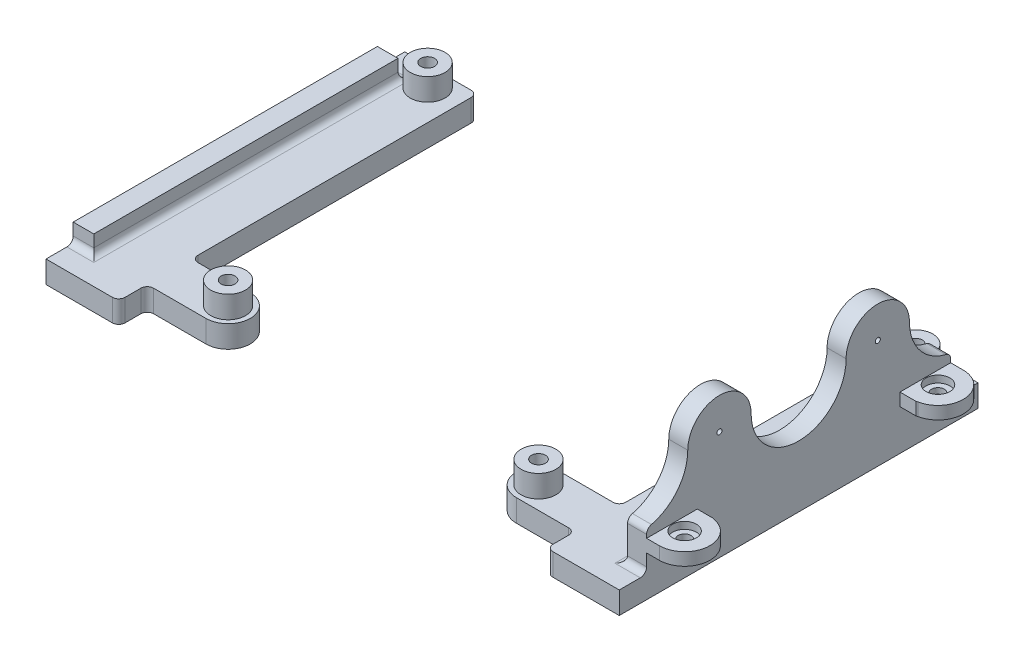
ISO-10303-21;
HEADER;
FILE_DESCRIPTION(('STEP AP214'),'2;1');
FILE_NAME('part.step','',(''),(''),'','','');
FILE_SCHEMA(('AUTOMOTIVE_DESIGN { 1 0 10303 214 1 1 1 1 }'));
ENDSEC;
DATA;
#1=APPLICATION_CONTEXT('core data for automotive mechanical design processes');
#2=APPLICATION_PROTOCOL_DEFINITION('international standard','automotive_design',2000,#1);
#3=PRODUCT_CONTEXT('',#1,'mechanical');
#4=PRODUCT('Part','Part','',(#3));
#5=PRODUCT_RELATED_PRODUCT_CATEGORY('part','',(#4));
#6=PRODUCT_DEFINITION_FORMATION('','',#4);
#7=PRODUCT_DEFINITION_CONTEXT('part definition',#1,'design');
#8=PRODUCT_DEFINITION('design','',#6,#7);
#9=PRODUCT_DEFINITION_SHAPE('','',#8);
#10=(LENGTH_UNIT() NAMED_UNIT(*) SI_UNIT(.MILLI.,.METRE.));
#11=(NAMED_UNIT(*) PLANE_ANGLE_UNIT() SI_UNIT($,.RADIAN.));
#12=(NAMED_UNIT(*) SI_UNIT($,.STERADIAN.) SOLID_ANGLE_UNIT());
#13=UNCERTAINTY_MEASURE_WITH_UNIT(LENGTH_MEASURE(1.E-05),#10,'distance_accuracy_value','');
#14=(GEOMETRIC_REPRESENTATION_CONTEXT(3) GLOBAL_UNCERTAINTY_ASSIGNED_CONTEXT((#13)) GLOBAL_UNIT_ASSIGNED_CONTEXT((#10,
#11,#12)) REPRESENTATION_CONTEXT('',''));
#15=CARTESIAN_POINT('',(0.,0.,0.));
#16=DIRECTION('',(0.,0.,1.));
#17=DIRECTION('',(1.,0.,0.));
#18=AXIS2_PLACEMENT_3D('',#15,#16,#17);
#19=CARTESIAN_POINT('',(45.2499982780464,31.3999999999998,-28.3189679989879));
#20=DIRECTION('',(-1.,0.,0.));
#21=DIRECTION('',(0.,0.,1.));
#22=AXIS2_PLACEMENT_3D('',#19,#20,#21);
#23=PLANE('',#22);
#24=CARTESIAN_POINT('',(45.2499982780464,45.0999999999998,-12.5));
#25=DIRECTION('',(-1.,0.,0.));
#26=DIRECTION('',(0.,0.,1.));
#27=AXIS2_PLACEMENT_3D('',#24,#25,#26);
#28=CIRCLE('',#27,0.399999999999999);
#29=CARTESIAN_POINT('',(45.2499982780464,45.0999999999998,-12.1));
#30=VERTEX_POINT('',#29);
#31=EDGE_CURVE('E400',#30,#30,#28,.T.);
#32=ORIENTED_EDGE('',*,*,#31,.T.);
#33=EDGE_LOOP('',(#32));
#34=FACE_BOUND('',#33,.T.);
#35=CARTESIAN_POINT('',(45.2499982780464,45.0999999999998,12.5));
#36=DIRECTION('',(-1.,0.,0.));
#37=DIRECTION('',(0.,0.,1.));
#38=AXIS2_PLACEMENT_3D('',#35,#36,#37);
#39=CIRCLE('',#38,0.399999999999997);
#40=CARTESIAN_POINT('',(45.2499982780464,45.0999999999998,12.9));
#41=VERTEX_POINT('',#40);
#42=EDGE_CURVE('E395',#41,#41,#39,.T.);
#43=ORIENTED_EDGE('',*,*,#42,.T.);
#44=EDGE_LOOP('',(#43));
#45=FACE_BOUND('',#44,.T.);
#46=DIRECTION('',(0.,-1.,0.));
#47=VECTOR('',#46,1.);
#48=CARTESIAN_POINT('',(45.2499999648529,52.2999999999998,-24.0000028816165));
#49=LINE('',#48,#47);
#50=CARTESIAN_POINT('',(45.2499999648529,36.8386387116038,-24.0000028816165));
#51=VERTEX_POINT('',#50);
#52=CARTESIAN_POINT('',(45.2499999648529,36.2999999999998,-24.0000028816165));
#53=VERTEX_POINT('',#52);
#54=EDGE_CURVE('E406',#51,#53,#49,.T.);
#55=ORIENTED_EDGE('',*,*,#54,.F.);
#56=CARTESIAN_POINT('',(45.2499982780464,36.8386387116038,-23.0000028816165));
#57=DIRECTION('',(-1.,0.,0.));
#58=DIRECTION('',(0.,0.,1.));
#59=AXIS2_PLACEMENT_3D('',#56,#57,#58);
#60=CIRCLE('',#59,1.);
#61=CARTESIAN_POINT('',(45.2499982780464,37.8105626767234,-23.2352980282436));
#62=VERTEX_POINT('',#61);
#63=EDGE_CURVE('E738',#51,#62,#60,.F.);
#64=ORIENTED_EDGE('',*,*,#63,.T.);
#65=CARTESIAN_POINT('',(45.2499982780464,45.0999965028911,-25.0000126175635));
#66=DIRECTION('',(1.,0.,0.));
#67=DIRECTION('',(0.,0.,-1.));
#68=AXIS2_PLACEMENT_3D('',#65,#66,#67);
#69=CIRCLE('',#68,7.50000420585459);
#70=CARTESIAN_POINT('',(45.2499982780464,45.099997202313,-17.5000084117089));
#71=VERTEX_POINT('',#70);
#72=EDGE_CURVE('E352',#71,#62,#69,.T.);
#73=ORIENTED_EDGE('',*,*,#72,.F.);
#74=CARTESIAN_POINT('',(45.2499982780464,45.099997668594,-12.500008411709));
#75=DIRECTION('',(-1.,0.,0.));
#76=DIRECTION('',(0.,1.8651239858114E-07,0.999999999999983));
#77=AXIS2_PLACEMENT_3D('',#74,#75,#76);
#78=ELLIPSE('',#77,5.,4.99999999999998);
#79=CARTESIAN_POINT('',(45.2499982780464,45.099998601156,-7.50000841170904));
#80=VERTEX_POINT('',#79);
#81=EDGE_CURVE('E359',#80,#71,#78,.T.);
#82=ORIENTED_EDGE('',*,*,#81,.F.);
#83=CARTESIAN_POINT('',(45.2499982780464,45.0999999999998,-4.20585458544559E-06));
#84=DIRECTION('',(1.,0.,0.));
#85=DIRECTION('',(0.,0.,-1.));
#86=AXIS2_PLACEMENT_3D('',#83,#84,#85);
#87=CIRCLE('',#86,7.50000420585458);
#88=CARTESIAN_POINT('',(45.2499982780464,45.0999999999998,7.5));
#89=VERTEX_POINT('',#88);
#90=EDGE_CURVE('E357',#89,#80,#87,.T.);
#91=ORIENTED_EDGE('',*,*,#90,.F.);
#92=CARTESIAN_POINT('',(45.2499982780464,45.0999999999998,12.5));
#93=DIRECTION('',(-1.,0.,0.));
#94=DIRECTION('',(0.,0.,1.));
#95=AXIS2_PLACEMENT_3D('',#92,#93,#94);
#96=ELLIPSE('',#95,5.,5.);
#97=CARTESIAN_POINT('',(45.2499982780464,45.1000004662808,17.5));
#98=VERTEX_POINT('',#97);
#99=EDGE_CURVE('E341',#98,#89,#96,.T.);
#100=ORIENTED_EDGE('',*,*,#99,.F.);
#101=CARTESIAN_POINT('',(45.2499982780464,45.1000011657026,25.0000042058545));
#102=DIRECTION('',(1.,0.,0.));
#103=DIRECTION('',(0.,0.,1.));
#104=AXIS2_PLACEMENT_3D('',#101,#102,#103);
#105=CIRCLE('',#104,7.50000420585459);
#106=CARTESIAN_POINT('',(45.2499982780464,37.8105668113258,23.2352917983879));
#107=VERTEX_POINT('',#106);
#108=EDGE_CURVE('E334',#107,#98,#105,.T.);
#109=ORIENTED_EDGE('',*,*,#108,.F.);
#110=CARTESIAN_POINT('',(45.2499982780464,36.8386427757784,22.9999969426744));
#111=DIRECTION('',(-1.,0.,0.));
#112=DIRECTION('',(0.,0.,1.));
#113=AXIS2_PLACEMENT_3D('',#110,#111,#112);
#114=CIRCLE('',#113,1.);
#115=CARTESIAN_POINT('',(45.2499999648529,36.8386427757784,23.9999969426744));
#116=VERTEX_POINT('',#115);
#117=EDGE_CURVE('E59',#107,#116,#114,.F.);
#118=ORIENTED_EDGE('',*,*,#117,.T.);
#119=DIRECTION('',(0.,-1.,0.));
#120=VECTOR('',#119,1.);
#121=CARTESIAN_POINT('',(45.2499999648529,52.2999999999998,23.9999969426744));
#122=LINE('',#121,#120);
#123=CARTESIAN_POINT('',(45.2499999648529,36.2999999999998,23.9999969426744));
#124=VERTEX_POINT('',#123);
#125=EDGE_CURVE('E409',#116,#124,#122,.T.);
#126=ORIENTED_EDGE('',*,*,#125,.T.);
#127=DIRECTION('',(0.,0.,-1.));
#128=VECTOR('',#127,1.);
#129=CARTESIAN_POINT('',(45.2499999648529,36.2999999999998,-24.0000028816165));
#130=LINE('',#129,#128);
#131=CARTESIAN_POINT('',(45.2499996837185,36.2999999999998,15.9999968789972));
#132=VERTEX_POINT('',#131);
#133=EDGE_CURVE('E403',#124,#132,#130,.T.);
#134=ORIENTED_EDGE('',*,*,#133,.T.);
#135=DIRECTION('',(0.,-1.,0.));
#136=VECTOR('',#135,1.);
#137=CARTESIAN_POINT('',(45.2499996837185,36.2999999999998,15.9999968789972));
#138=LINE('',#137,#136);
#139=CARTESIAN_POINT('',(45.2499999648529,34.2999999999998,15.9999968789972));
#140=VERTEX_POINT('',#139);
#141=EDGE_CURVE('E477',#132,#140,#138,.T.);
#142=ORIENTED_EDGE('',*,*,#141,.T.);
#143=DIRECTION('',(0.,0.,-1.));
#144=VECTOR('',#143,1.);
#145=CARTESIAN_POINT('',(45.2499999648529,34.2999999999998,23.9999969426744));
#146=LINE('',#145,#144);
#147=CARTESIAN_POINT('',(45.2499999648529,34.2999999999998,23.9999969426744));
#148=VERTEX_POINT('',#147);
#149=EDGE_CURVE('E589',#148,#140,#146,.T.);
#150=ORIENTED_EDGE('',*,*,#149,.F.);
#151=DIRECTION('',(0.,-1.,0.));
#152=VECTOR('',#151,1.);
#153=CARTESIAN_POINT('',(45.2499999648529,82.4299272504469,23.9999969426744));
#154=LINE('',#153,#152);
#155=CARTESIAN_POINT('',(45.2499999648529,32.3999999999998,23.9999969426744));
#156=VERTEX_POINT('',#155);
#157=EDGE_CURVE('E597',#148,#156,#154,.T.);
#158=ORIENTED_EDGE('',*,*,#157,.T.);
#159=CARTESIAN_POINT('',(45.2499982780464,32.3999999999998,24.9999969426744));
#160=DIRECTION('',(-1.,0.,0.));
#161=DIRECTION('',(0.,0.,1.));
#162=AXIS2_PLACEMENT_3D('',#159,#160,#161);
#163=CIRCLE('',#162,1.);
#164=CARTESIAN_POINT('',(45.2499982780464,31.3999999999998,24.9999969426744));
#165=VERTEX_POINT('',#164);
#166=EDGE_CURVE('E706',#156,#165,#163,.T.);
#167=ORIENTED_EDGE('',*,*,#166,.T.);
#168=DIRECTION('',(0.,0.,-1.));
#169=VECTOR('',#168,1.);
#170=CARTESIAN_POINT('',(45.2499982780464,31.3999999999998,-28.3189679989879));
#171=LINE('',#170,#169);
#172=CARTESIAN_POINT('',(45.2499982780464,31.3999999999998,28.3154120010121));
#173=VERTEX_POINT('',#172);
#174=EDGE_CURVE('E604',#173,#165,#171,.T.);
#175=ORIENTED_EDGE('',*,*,#174,.F.);
#176=DIRECTION('',(0.,-1.,0.));
#177=VECTOR('',#176,1.);
#178=CARTESIAN_POINT('',(45.2499982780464,31.3999999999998,28.3154120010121));
#179=LINE('',#178,#177);
#180=CARTESIAN_POINT('',(45.2499982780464,27.8999999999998,28.3154120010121));
#181=VERTEX_POINT('',#180);
#182=EDGE_CURVE('E626',#173,#181,#179,.T.);
#183=ORIENTED_EDGE('',*,*,#182,.T.);
#184=DIRECTION('',(0.,0.,-1.));
#185=VECTOR('',#184,1.);
#186=CARTESIAN_POINT('',(45.2499982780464,27.8999999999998,-28.3189679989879));
#187=LINE('',#186,#185);
#188=CARTESIAN_POINT('',(45.2499982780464,27.8999999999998,-28.3189679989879));
#189=VERTEX_POINT('',#188);
#190=EDGE_CURVE('E591',#181,#189,#187,.T.);
#191=ORIENTED_EDGE('',*,*,#190,.T.);
#192=DIRECTION('',(0.,-1.,0.));
#193=VECTOR('',#192,1.);
#194=CARTESIAN_POINT('',(45.2499982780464,31.3999999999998,-28.3189679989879));
#195=LINE('',#194,#193);
#196=CARTESIAN_POINT('',(45.2499982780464,31.3999999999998,-28.3189679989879));
#197=VERTEX_POINT('',#196);
#198=EDGE_CURVE('E655',#197,#189,#195,.T.);
#199=ORIENTED_EDGE('',*,*,#198,.F.);
#200=CARTESIAN_POINT('',(45.2499982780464,31.3999999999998,-25.0000028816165));
#201=VERTEX_POINT('',#200);
#202=EDGE_CURVE('E608',#201,#197,#171,.T.);
#203=ORIENTED_EDGE('',*,*,#202,.F.);
#204=CARTESIAN_POINT('',(45.2499982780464,32.3999999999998,-25.0000028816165));
#205=DIRECTION('',(-1.,0.,0.));
#206=DIRECTION('',(0.,0.,1.));
#207=AXIS2_PLACEMENT_3D('',#204,#205,#206);
#208=CIRCLE('',#207,1.);
#209=CARTESIAN_POINT('',(45.2499999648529,32.3999999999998,-24.0000028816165));
#210=VERTEX_POINT('',#209);
#211=EDGE_CURVE('E700',#201,#210,#208,.T.);
#212=ORIENTED_EDGE('',*,*,#211,.T.);
#213=DIRECTION('',(0.,-1.,0.));
#214=VECTOR('',#213,1.);
#215=CARTESIAN_POINT('',(45.2499999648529,82.4299272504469,-24.0000028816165));
#216=LINE('',#215,#214);
#217=CARTESIAN_POINT('',(45.2499999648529,34.2999999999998,-24.0000028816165));
#218=VERTEX_POINT('',#217);
#219=EDGE_CURVE('E593',#218,#210,#216,.T.);
#220=ORIENTED_EDGE('',*,*,#219,.F.);
#221=CARTESIAN_POINT('',(45.2499999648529,34.2999999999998,-16.000001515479));
#222=VERTEX_POINT('',#221);
#223=EDGE_CURVE('E592',#222,#218,#146,.T.);
#224=ORIENTED_EDGE('',*,*,#223,.F.);
#225=DIRECTION('',(0.,-1.,0.));
#226=VECTOR('',#225,1.);
#227=CARTESIAN_POINT('',(45.2499999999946,36.2999999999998,-15.9999999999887));
#228=LINE('',#227,#226);
#229=CARTESIAN_POINT('',(45.2499999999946,36.2999999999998,-15.9999999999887));
#230=VERTEX_POINT('',#229);
#231=EDGE_CURVE('E474',#230,#222,#228,.T.);
#232=ORIENTED_EDGE('',*,*,#231,.F.);
#233=EDGE_CURVE('E407',#230,#53,#130,.T.);
#234=ORIENTED_EDGE('',*,*,#233,.T.);
#235=EDGE_LOOP('',(#55,#64,#73,#82,#91,#100,#109,#118,#126,#134,#142,#150,#158,#167,#175,#183,
#191,#199,#203,#212,#220,#224,#232,#234));
#236=FACE_BOUND('',#235,.T.);
#237=ADVANCED_FACE('F44',(#34,#45,#236),#23,.F.);
#238=CARTESIAN_POINT('',(42.2499999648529,82.4299272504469,23.9999969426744));
#239=DIRECTION('',(1.,0.,0.));
#240=DIRECTION('',(0.,0.,-1.));
#241=AXIS2_PLACEMENT_3D('',#238,#239,#240);
#242=PLANE('',#241);
#243=CARTESIAN_POINT('',(42.2499999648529,45.0999999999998,-12.5));
#244=DIRECTION('',(-1.,0.,0.));
#245=DIRECTION('',(0.,0.,1.));
#246=AXIS2_PLACEMENT_3D('',#243,#244,#245);
#247=CIRCLE('',#246,0.399999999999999);
#248=CARTESIAN_POINT('',(42.2499999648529,45.0999999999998,-12.1));
#249=VERTEX_POINT('',#248);
#250=EDGE_CURVE('E392',#249,#249,#247,.T.);
#251=ORIENTED_EDGE('',*,*,#250,.F.);
#252=EDGE_LOOP('',(#251));
#253=FACE_BOUND('',#252,.T.);
#254=CARTESIAN_POINT('',(42.2499999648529,45.0999999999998,12.5));
#255=DIRECTION('',(-1.,0.,0.));
#256=DIRECTION('',(0.,0.,-1.));
#257=AXIS2_PLACEMENT_3D('',#254,#255,#256);
#258=CIRCLE('',#257,0.399999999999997);
#259=CARTESIAN_POINT('',(42.2499999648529,45.0999999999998,12.1));
#260=VERTEX_POINT('',#259);
#261=EDGE_CURVE('E389',#260,#260,#258,.T.);
#262=ORIENTED_EDGE('',*,*,#261,.F.);
#263=EDGE_LOOP('',(#262));
#264=FACE_BOUND('',#263,.T.);
#265=CARTESIAN_POINT('',(42.2499999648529,45.0999965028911,-25.0000126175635));
#266=DIRECTION('',(1.,0.,0.));
#267=DIRECTION('',(0.,0.,-1.));
#268=AXIS2_PLACEMENT_3D('',#265,#266,#267);
#269=CIRCLE('',#268,7.50000420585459);
#270=CARTESIAN_POINT('',(42.2499999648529,37.8105626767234,-23.2352980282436));
#271=VERTEX_POINT('',#270);
#272=CARTESIAN_POINT('',(42.2499999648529,45.099997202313,-17.5000084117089));
#273=VERTEX_POINT('',#272);
#274=EDGE_CURVE('E754',#271,#273,#269,.F.);
#275=ORIENTED_EDGE('',*,*,#274,.F.);
#276=CARTESIAN_POINT('',(42.2499999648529,36.8386387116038,-23.0000028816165));
#277=DIRECTION('',(1.,0.,0.));
#278=DIRECTION('',(0.,0.,-1.));
#279=AXIS2_PLACEMENT_3D('',#276,#277,#278);
#280=CIRCLE('',#279,1.);
#281=CARTESIAN_POINT('',(42.2499999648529,36.8386387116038,-24.0000028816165));
#282=VERTEX_POINT('',#281);
#283=EDGE_CURVE('E733',#271,#282,#280,.F.);
#284=ORIENTED_EDGE('',*,*,#283,.T.);
#285=DIRECTION('',(0.,-1.,0.));
#286=VECTOR('',#285,1.);
#287=CARTESIAN_POINT('',(42.2499999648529,82.4299272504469,-24.0000028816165));
#288=LINE('',#287,#286);
#289=CARTESIAN_POINT('',(42.2499999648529,32.3999999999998,-24.0000028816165));
#290=VERTEX_POINT('',#289);
#291=EDGE_CURVE('E596',#282,#290,#288,.T.);
#292=ORIENTED_EDGE('',*,*,#291,.T.);
#293=DIRECTION('',(0.,0.,1.));
#294=VECTOR('',#293,1.);
#295=CARTESIAN_POINT('',(42.2499999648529,32.3999999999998,23.9999969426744));
#296=LINE('',#295,#294);
#297=CARTESIAN_POINT('',(42.2499999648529,32.3999999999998,23.9999969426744));
#298=VERTEX_POINT('',#297);
#299=EDGE_CURVE('E712',#290,#298,#296,.T.);
#300=ORIENTED_EDGE('',*,*,#299,.T.);
#301=DIRECTION('',(0.,-1.,0.));
#302=VECTOR('',#301,1.);
#303=CARTESIAN_POINT('',(42.2499999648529,82.4299272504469,23.9999969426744));
#304=LINE('',#303,#302);
#305=CARTESIAN_POINT('',(42.2499999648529,36.8386427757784,23.9999969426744));
#306=VERTEX_POINT('',#305);
#307=EDGE_CURVE('E599',#306,#298,#304,.T.);
#308=ORIENTED_EDGE('',*,*,#307,.F.);
#309=CARTESIAN_POINT('',(42.2499999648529,36.8386427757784,22.9999969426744));
#310=DIRECTION('',(1.,0.,0.));
#311=DIRECTION('',(0.,0.,-1.));
#312=AXIS2_PLACEMENT_3D('',#309,#310,#311);
#313=CIRCLE('',#312,1.);
#314=CARTESIAN_POINT('',(42.2499999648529,37.8105668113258,23.2352917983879));
#315=VERTEX_POINT('',#314);
#316=EDGE_CURVE('E731',#306,#315,#313,.F.);
#317=ORIENTED_EDGE('',*,*,#316,.T.);
#318=CARTESIAN_POINT('',(42.2499999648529,45.1000011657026,25.0000042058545));
#319=DIRECTION('',(1.,0.,0.));
#320=DIRECTION('',(0.,0.,-1.));
#321=AXIS2_PLACEMENT_3D('',#318,#319,#320);
#322=CIRCLE('',#321,7.50000420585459);
#323=CARTESIAN_POINT('',(42.2499999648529,45.1000004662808,17.5));
#324=VERTEX_POINT('',#323);
#325=EDGE_CURVE('E342',#324,#315,#322,.F.);
#326=ORIENTED_EDGE('',*,*,#325,.F.);
#327=CARTESIAN_POINT('',(42.2499999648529,45.0999999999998,12.5));
#328=DIRECTION('',(-1.,0.,0.));
#329=DIRECTION('',(0.,0.,1.));
#330=AXIS2_PLACEMENT_3D('',#327,#328,#329);
#331=ELLIPSE('',#330,5.,5.);
#332=CARTESIAN_POINT('',(42.2499999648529,45.0999999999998,7.5));
#333=VERTEX_POINT('',#332);
#334=EDGE_CURVE('E349',#333,#324,#331,.F.);
#335=ORIENTED_EDGE('',*,*,#334,.F.);
#336=CARTESIAN_POINT('',(42.2499999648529,45.0999999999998,-4.20585458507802E-06));
#337=DIRECTION('',(1.,0.,0.));
#338=DIRECTION('',(0.,0.,-1.));
#339=AXIS2_PLACEMENT_3D('',#336,#337,#338);
#340=CIRCLE('',#339,7.50000420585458);
#341=CARTESIAN_POINT('',(42.2499999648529,45.099998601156,-7.50000841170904));
#342=VERTEX_POINT('',#341);
#343=EDGE_CURVE('E1518',#342,#333,#340,.F.);
#344=ORIENTED_EDGE('',*,*,#343,.F.);
#345=CARTESIAN_POINT('',(42.2499999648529,45.099997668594,-12.500008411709));
#346=DIRECTION('',(-1.,0.,0.));
#347=DIRECTION('',(0.,1.8651239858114E-07,0.999999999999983));
#348=AXIS2_PLACEMENT_3D('',#345,#346,#347);
#349=ELLIPSE('',#348,5.,4.99999999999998);
#350=EDGE_CURVE('E796',#273,#342,#349,.F.);
#351=ORIENTED_EDGE('',*,*,#350,.F.);
#352=EDGE_LOOP('',(#275,#284,#292,#300,#308,#317,#326,#335,#344,#351));
#353=FACE_BOUND('',#352,.T.);
#354=ADVANCED_FACE('F752',(#253,#264,#353),#242,.F.);
#355=CARTESIAN_POINT('',(24.499951,31.3999999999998,20.3154280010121));
#356=DIRECTION('',(0.,1.,0.));
#357=DIRECTION('',(0.,0.,1.));
#358=AXIS2_PLACEMENT_3D('',#355,#356,#357);
#359=PLANE('',#358);
#360=CARTESIAN_POINT('',(38.499923,31.3999999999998,-25.1846079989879));
#361=DIRECTION('',(0.,1.,0.));
#362=DIRECTION('',(0.,0.,1.));
#363=AXIS2_PLACEMENT_3D('',#360,#361,#362);
#364=CIRCLE('',#363,2.75);
#365=CARTESIAN_POINT('',(38.499923,31.3999999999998,-22.4346079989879));
#366=VERTEX_POINT('',#365);
#367=EDGE_CURVE('E385',#366,#366,#364,.T.);
#368=ORIENTED_EDGE('',*,*,#367,.F.);
#369=EDGE_LOOP('',(#368));
#370=FACE_BOUND('',#369,.T.);
#371=DIRECTION('',(1.,0.,0.));
#372=VECTOR('',#371,1.);
#373=CARTESIAN_POINT('',(24.499951,31.3999999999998,24.9999969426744));
#374=LINE('',#373,#372);
#375=CARTESIAN_POINT('',(41.2499999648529,31.3999999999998,24.9999969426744));
#376=VERTEX_POINT('',#375);
#377=EDGE_CURVE('E667',#165,#376,#374,.F.);
#378=ORIENTED_EDGE('',*,*,#377,.T.);
#379=DIRECTION('',(0.,0.,1.));
#380=VECTOR('',#379,1.);
#381=CARTESIAN_POINT('',(41.2499999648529,31.3999999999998,20.3154280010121));
#382=LINE('',#381,#380);
#383=CARTESIAN_POINT('',(41.2499999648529,31.3999999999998,-25.0000028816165));
#384=VERTEX_POINT('',#383);
#385=EDGE_CURVE('E715',#376,#384,#382,.F.);
#386=ORIENTED_EDGE('',*,*,#385,.T.);
#387=DIRECTION('',(-1.,0.,0.));
#388=VECTOR('',#387,1.);
#389=CARTESIAN_POINT('',(24.499951,31.3999999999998,-25.0000028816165));
#390=LINE('',#389,#388);
#391=EDGE_CURVE('E671',#384,#201,#390,.F.);
#392=ORIENTED_EDGE('',*,*,#391,.T.);
#393=ORIENTED_EDGE('',*,*,#202,.T.);
#394=DIRECTION('',(-1.,0.,0.));
#395=VECTOR('',#394,1.);
#396=CARTESIAN_POINT('',(45.2499982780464,31.3999999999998,-28.3189679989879));
#397=LINE('',#396,#395);
#398=CARTESIAN_POINT('',(34.7699982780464,31.3999999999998,-28.3189679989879));
#399=VERTEX_POINT('',#398);
#400=EDGE_CURVE('E607',#197,#399,#397,.T.);
#401=ORIENTED_EDGE('',*,*,#400,.T.);
#402=CARTESIAN_POINT('',(34.7699982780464,31.3999999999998,-27.3189679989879));
#403=DIRECTION('',(0.,1.,0.));
#404=DIRECTION('',(0.,0.,1.));
#405=AXIS2_PLACEMENT_3D('',#402,#403,#404);
#406=CIRCLE('',#405,1.);
#407=CARTESIAN_POINT('',(33.7699982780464,31.3999999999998,-27.3189679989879));
#408=VERTEX_POINT('',#407);
#409=EDGE_CURVE('E669',#399,#408,#406,.T.);
#410=ORIENTED_EDGE('',*,*,#409,.T.);
#411=DIRECTION('',(0.,0.,1.));
#412=VECTOR('',#411,1.);
#413=CARTESIAN_POINT('',(33.7699982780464,31.3999999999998,-28.3189679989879));
#414=LINE('',#413,#412);
#415=CARTESIAN_POINT('',(33.7699982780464,31.3999999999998,15.8154280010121));
#416=VERTEX_POINT('',#415);
#417=EDGE_CURVE('E611',#408,#416,#414,.T.);
#418=ORIENTED_EDGE('',*,*,#417,.T.);
#419=CARTESIAN_POINT('',(32.7699982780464,31.3999999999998,15.8154280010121));
#420=DIRECTION('',(0.,1.,0.));
#421=DIRECTION('',(0.,0.,1.));
#422=AXIS2_PLACEMENT_3D('',#419,#420,#421);
#423=CIRCLE('',#422,1.);
#424=CARTESIAN_POINT('',(32.7699982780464,31.3999999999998,16.8154280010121));
#425=VERTEX_POINT('',#424);
#426=EDGE_CURVE('E704',#416,#425,#423,.F.);
#427=ORIENTED_EDGE('',*,*,#426,.T.);
#428=DIRECTION('',(-1.,0.,0.));
#429=VECTOR('',#428,1.);
#430=CARTESIAN_POINT('',(24.499951,31.3999999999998,16.8154280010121));
#431=LINE('',#430,#429);
#432=CARTESIAN_POINT('',(24.499951,31.3999999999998,16.8154280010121));
#433=VERTEX_POINT('',#432);
#434=EDGE_CURVE('E614',#425,#433,#431,.T.);
#435=ORIENTED_EDGE('',*,*,#434,.T.);
#436=CARTESIAN_POINT('',(24.499951,31.3999999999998,20.3154280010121));
#437=DIRECTION('',(0.,1.,0.));
#438=DIRECTION('',(0.,0.,1.));
#439=AXIS2_PLACEMENT_3D('',#436,#437,#438);
#440=CIRCLE('',#439,3.5);
#441=CARTESIAN_POINT('',(24.499951,31.3999999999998,23.8154280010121));
#442=VERTEX_POINT('',#441);
#443=EDGE_CURVE('E616',#433,#442,#440,.T.);
#444=ORIENTED_EDGE('',*,*,#443,.T.);
#445=DIRECTION('',(1.,0.,0.));
#446=VECTOR('',#445,1.);
#447=CARTESIAN_POINT('',(24.499951,31.3999999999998,23.8154280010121));
#448=LINE('',#447,#446);
#449=CARTESIAN_POINT('',(32.7699982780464,31.3999999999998,23.8154280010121));
#450=VERTEX_POINT('',#449);
#451=EDGE_CURVE('E618',#442,#450,#448,.T.);
#452=ORIENTED_EDGE('',*,*,#451,.T.);
#453=CARTESIAN_POINT('',(32.7699982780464,31.3999999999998,24.8154280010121));
#454=DIRECTION('',(0.,1.,0.));
#455=DIRECTION('',(0.,0.,1.));
#456=AXIS2_PLACEMENT_3D('',#453,#454,#455);
#457=CIRCLE('',#456,1.);
#458=CARTESIAN_POINT('',(33.7699982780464,31.3999999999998,24.8154280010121));
#459=VERTEX_POINT('',#458);
#460=EDGE_CURVE('E710',#450,#459,#457,.F.);
#461=ORIENTED_EDGE('',*,*,#460,.T.);
#462=DIRECTION('',(0.,0.,1.));
#463=VECTOR('',#462,1.);
#464=CARTESIAN_POINT('',(33.7699982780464,31.3999999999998,23.8154280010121));
#465=LINE('',#464,#463);
#466=CARTESIAN_POINT('',(33.7699982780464,31.3999999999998,27.3154120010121));
#467=VERTEX_POINT('',#466);
#468=EDGE_CURVE('E621',#459,#467,#465,.T.);
#469=ORIENTED_EDGE('',*,*,#468,.T.);
#470=CARTESIAN_POINT('',(34.7699982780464,31.3999999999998,27.3154120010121));
#471=DIRECTION('',(0.,1.,0.));
#472=DIRECTION('',(0.,0.,1.));
#473=AXIS2_PLACEMENT_3D('',#470,#471,#472);
#474=CIRCLE('',#473,1.);
#475=CARTESIAN_POINT('',(34.7699982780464,31.3999999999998,28.3154120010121));
#476=VERTEX_POINT('',#475);
#477=EDGE_CURVE('E665',#467,#476,#474,.T.);
#478=ORIENTED_EDGE('',*,*,#477,.T.);
#479=DIRECTION('',(1.,0.,0.));
#480=VECTOR('',#479,1.);
#481=CARTESIAN_POINT('',(45.2499982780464,31.3999999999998,28.3154120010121));
#482=LINE('',#481,#480);
#483=EDGE_CURVE('E624',#476,#173,#482,.T.);
#484=ORIENTED_EDGE('',*,*,#483,.T.);
#485=ORIENTED_EDGE('',*,*,#174,.T.);
#486=EDGE_LOOP('',(#378,#386,#392,#393,#401,#410,#418,#427,#435,#444,#452,#461,#469,#478,#484,#485));
#487=FACE_BOUND('',#486,.T.);
#488=CARTESIAN_POINT('',(24.499951,31.3999999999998,20.3154280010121));
#489=DIRECTION('',(0.,1.,0.));
#490=DIRECTION('',(0.,0.,1.));
#491=AXIS2_PLACEMENT_3D('',#488,#489,#490);
#492=CIRCLE('',#491,2.75);
#493=CARTESIAN_POINT('',(24.499951,31.3999999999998,23.0654280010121));
#494=VERTEX_POINT('',#493);
#495=EDGE_CURVE('E376',#494,#494,#492,.T.);
#496=ORIENTED_EDGE('',*,*,#495,.F.);
#497=EDGE_LOOP('',(#496));
#498=FACE_BOUND('',#497,.T.);
#499=ADVANCED_FACE('F958',(#370,#487,#498),#359,.T.);
#500=CARTESIAN_POINT('',(47.2499984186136,36.2999999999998,-20.0000031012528));
#501=DIRECTION('',(0.,1.,0.));
#502=DIRECTION('',(0.,0.,1.));
#503=AXIS2_PLACEMENT_3D('',#500,#501,#502);
#504=PLANE('',#503);
#505=ORIENTED_EDGE('',*,*,#133,.F.);
#506=DIRECTION('',(1.,0.,0.));
#507=VECTOR('',#506,1.);
#508=CARTESIAN_POINT('',(42.2499999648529,36.2999999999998,23.9999969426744));
#509=LINE('',#508,#507);
#510=CARTESIAN_POINT('',(47.2499999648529,36.2999999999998,23.9999969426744));
#511=VERTEX_POINT('',#510);
#512=EDGE_CURVE('E439',#124,#511,#509,.T.);
#513=ORIENTED_EDGE('',*,*,#512,.T.);
#514=CARTESIAN_POINT('',(47.2500000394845,36.2999999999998,19.9999969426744));
#515=DIRECTION('',(0.,1.,0.));
#516=DIRECTION('',(0.,0.,1.));
#517=AXIS2_PLACEMENT_3D('',#514,#515,#516);
#518=CIRCLE('',#517,3.99999999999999);
#519=CARTESIAN_POINT('',(48.0499996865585,36.2999999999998,16.0808132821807));
#520=VERTEX_POINT('',#519);
#521=EDGE_CURVE('E441',#511,#520,#518,.T.);
#522=ORIENTED_EDGE('',*,*,#521,.T.);
#523=CARTESIAN_POINT('',(48.2499996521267,36.2999999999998,15.101017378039));
#524=DIRECTION('',(0.,-1.,0.));
#525=DIRECTION('',(0.,0.,1.));
#526=AXIS2_PLACEMENT_3D('',#523,#524,#525);
#527=CIRCLE('',#526,1.);
#528=CARTESIAN_POINT('',(47.8120089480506,36.2999999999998,15.9999968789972));
#529=VERTEX_POINT('',#528);
#530=EDGE_CURVE('E443',#520,#529,#527,.T.);
#531=ORIENTED_EDGE('',*,*,#530,.T.);
#532=DIRECTION('',(-1.,0.,0.));
#533=VECTOR('',#532,1.);
#534=CARTESIAN_POINT('',(47.8120089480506,36.2999999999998,15.9999968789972));
#535=LINE('',#534,#533);
#536=EDGE_CURVE('E445',#529,#132,#535,.T.);
#537=ORIENTED_EDGE('',*,*,#536,.T.);
#538=EDGE_LOOP('',(#505,#513,#522,#531,#537));
#539=FACE_BOUND('',#538,.T.);
#540=CARTESIAN_POINT('',(47.2499999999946,36.2999999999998,20.0000000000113));
#541=DIRECTION('',(0.,1.,0.));
#542=DIRECTION('',(0.,0.,1.));
#543=AXIS2_PLACEMENT_3D('',#540,#541,#542);
#544=CIRCLE('',#543,1.875);
#545=CARTESIAN_POINT('',(47.2499999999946,36.2999999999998,21.8750000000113));
#546=VERTEX_POINT('',#545);
#547=EDGE_CURVE('E416',#546,#546,#544,.T.);
#548=ORIENTED_EDGE('',*,*,#547,.F.);
#549=EDGE_LOOP('',(#548));
#550=FACE_BOUND('',#549,.T.);
#551=ADVANCED_FACE('F792',(#539,#550),#504,.T.);
#552=CARTESIAN_POINT('',(47.2499999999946,36.2999999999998,-19.9999999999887));
#553=DIRECTION('',(0.,-1.,0.));
#554=DIRECTION('',(0.,0.,-1.));
#555=AXIS2_PLACEMENT_3D('',#552,#553,#554);
#556=CYLINDRICAL_SURFACE('',#555,0.999999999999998);
#557=CARTESIAN_POINT('',(47.2499999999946,34.2999999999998,-19.9999999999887));
#558=DIRECTION('',(0.,1.,0.));
#559=DIRECTION('',(0.,0.,1.));
#560=AXIS2_PLACEMENT_3D('',#557,#558,#559);
#561=CIRCLE('',#560,0.999999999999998);
#562=CARTESIAN_POINT('',(47.2499999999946,34.2999999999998,-18.9999999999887));
#563=VERTEX_POINT('',#562);
#564=EDGE_CURVE('E427',#563,#563,#561,.T.);
#565=ORIENTED_EDGE('',*,*,#564,.F.);
#566=EDGE_LOOP('',(#565));
#567=FACE_BOUND('',#566,.T.);
#568=CARTESIAN_POINT('',(47.2499999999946,35.1999999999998,-19.9999999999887));
#569=DIRECTION('',(0.,1.,0.));
#570=DIRECTION('',(0.,0.,1.));
#571=AXIS2_PLACEMENT_3D('',#568,#569,#570);
#572=CIRCLE('',#571,0.999999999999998);
#573=CARTESIAN_POINT('',(47.2499999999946,35.1999999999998,-18.9999999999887));
#574=VERTEX_POINT('',#573);
#575=EDGE_CURVE('E428',#574,#574,#572,.T.);
#576=ORIENTED_EDGE('',*,*,#575,.T.);
#577=EDGE_LOOP('',(#576));
#578=FACE_BOUND('',#577,.T.);
#579=ADVANCED_FACE('F855',(#567,#578),#556,.F.);
#580=CARTESIAN_POINT('',(47.2499999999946,36.2999999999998,20.0000000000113));
#581=DIRECTION('',(0.,-1.,0.));
#582=DIRECTION('',(0.,0.,-1.));
#583=AXIS2_PLACEMENT_3D('',#580,#581,#582);
#584=CYLINDRICAL_SURFACE('',#583,0.999999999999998);
#585=CARTESIAN_POINT('',(47.2499999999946,34.2999999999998,20.0000000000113));
#586=DIRECTION('',(0.,1.,0.));
#587=DIRECTION('',(0.,0.,1.));
#588=AXIS2_PLACEMENT_3D('',#585,#586,#587);
#589=CIRCLE('',#588,0.999999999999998);
#590=CARTESIAN_POINT('',(47.2499999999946,34.2999999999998,21.0000000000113));
#591=VERTEX_POINT('',#590);
#592=EDGE_CURVE('E424',#591,#591,#589,.T.);
#593=ORIENTED_EDGE('',*,*,#592,.F.);
#594=EDGE_LOOP('',(#593));
#595=FACE_BOUND('',#594,.T.);
#596=CARTESIAN_POINT('',(47.2499999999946,35.1999999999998,20.0000000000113));
#597=DIRECTION('',(0.,1.,0.));
#598=DIRECTION('',(0.,0.,1.));
#599=AXIS2_PLACEMENT_3D('',#596,#597,#598);
#600=CIRCLE('',#599,0.999999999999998);
#601=CARTESIAN_POINT('',(47.2499999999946,35.1999999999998,21.0000000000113));
#602=VERTEX_POINT('',#601);
#603=EDGE_CURVE('E415',#602,#602,#600,.T.);
#604=ORIENTED_EDGE('',*,*,#603,.T.);
#605=EDGE_LOOP('',(#604));
#606=FACE_BOUND('',#605,.T.);
#607=ADVANCED_FACE('F851',(#595,#606),#584,.F.);
#608=CARTESIAN_POINT('',(24.499951,34.2999999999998,20.3154280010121));
#609=DIRECTION('',(0.,-1.,0.));
#610=DIRECTION('',(0.,0.,-1.));
#611=AXIS2_PLACEMENT_3D('',#608,#609,#610);
#612=CYLINDRICAL_SURFACE('',#611,1.1);
#613=CARTESIAN_POINT('',(24.499951,29.1999999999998,20.3154280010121));
#614=DIRECTION('',(0.,-1.,0.));
#615=DIRECTION('',(0.,0.,-1.));
#616=AXIS2_PLACEMENT_3D('',#613,#614,#615);
#617=CIRCLE('',#616,1.1);
#618=CARTESIAN_POINT('',(24.499951,29.1999999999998,19.2154280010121));
#619=VERTEX_POINT('',#618);
#620=EDGE_CURVE('E603',#619,#619,#617,.F.);
#621=CARTESIAN_POINT('',(24.499951,34.8999999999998,20.3154280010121));
#622=DIRECTION('',(0.,1.,0.));
#623=DIRECTION('',(0.,0.,1.));
#624=AXIS2_PLACEMENT_3D('',#621,#622,#623);
#625=CIRCLE('',#624,1.1);
#626=CARTESIAN_POINT('',(24.499951,34.8999999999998,19.2154280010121));
#627=VERTEX_POINT('',#626);
#628=EDGE_CURVE('E373',#627,#627,#625,.T.);
#629=CARTESIAN_POINT('',(24.499951,29.1999999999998,19.2154280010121));
#630=CARTESIAN_POINT('',(24.499951,29.2593749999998,19.2154280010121));
#631=CARTESIAN_POINT('',(24.499951,29.3187499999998,19.2154280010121));
#632=CARTESIAN_POINT('',(24.499951,29.4374999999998,19.2154280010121));
#633=CARTESIAN_POINT('',(24.499951,29.4968749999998,19.2154280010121));
#634=CARTESIAN_POINT('',(24.499951,29.6156249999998,19.2154280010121));
#635=CARTESIAN_POINT('',(24.499951,29.6749999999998,19.2154280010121));
#636=CARTESIAN_POINT('',(24.499951,29.7937499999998,19.2154280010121));
#637=CARTESIAN_POINT('',(24.499951,29.8531249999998,19.2154280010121));
#638=CARTESIAN_POINT('',(24.499951,29.9718749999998,19.2154280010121));
#639=CARTESIAN_POINT('',(24.499951,30.0312499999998,19.2154280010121));
#640=CARTESIAN_POINT('',(24.499951,30.1499999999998,19.2154280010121));
#641=CARTESIAN_POINT('',(24.499951,30.2093749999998,19.2154280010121));
#642=CARTESIAN_POINT('',(24.499951,30.3281249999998,19.2154280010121));
#643=CARTESIAN_POINT('',(24.499951,30.3874999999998,19.2154280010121));
#644=CARTESIAN_POINT('',(24.499951,30.5062499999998,19.2154280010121));
#645=CARTESIAN_POINT('',(24.499951,30.5656249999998,19.2154280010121));
#646=CARTESIAN_POINT('',(24.499951,30.6843749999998,19.2154280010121));
#647=CARTESIAN_POINT('',(24.499951,30.7437499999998,19.2154280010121));
#648=CARTESIAN_POINT('',(24.499951,30.8624999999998,19.2154280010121));
#649=CARTESIAN_POINT('',(24.499951,30.9218749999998,19.2154280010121));
#650=CARTESIAN_POINT('',(24.499951,31.0406249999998,19.2154280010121));
#651=CARTESIAN_POINT('',(24.499951,31.0999999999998,19.2154280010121));
#652=CARTESIAN_POINT('',(24.499951,31.2187499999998,19.2154280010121));
#653=CARTESIAN_POINT('',(24.499951,31.2781249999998,19.2154280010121));
#654=CARTESIAN_POINT('',(24.499951,31.3968749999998,19.2154280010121));
#655=CARTESIAN_POINT('',(24.499951,31.4562499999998,19.2154280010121));
#656=CARTESIAN_POINT('',(24.499951,31.5749999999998,19.2154280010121));
#657=CARTESIAN_POINT('',(24.499951,31.6343749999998,19.2154280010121));
#658=CARTESIAN_POINT('',(24.499951,31.7531249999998,19.2154280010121));
#659=CARTESIAN_POINT('',(24.499951,31.8124999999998,19.2154280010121));
#660=CARTESIAN_POINT('',(24.499951,31.9312499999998,19.2154280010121));
#661=CARTESIAN_POINT('',(24.499951,31.9906249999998,19.2154280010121));
#662=CARTESIAN_POINT('',(24.499951,32.1093749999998,19.2154280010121));
#663=CARTESIAN_POINT('',(24.499951,32.1687499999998,19.2154280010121));
#664=CARTESIAN_POINT('',(24.499951,32.2874999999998,19.2154280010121));
#665=CARTESIAN_POINT('',(24.499951,32.3468749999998,19.2154280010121));
#666=CARTESIAN_POINT('',(24.499951,32.4656249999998,19.2154280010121));
#667=CARTESIAN_POINT('',(24.499951,32.5249999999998,19.2154280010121));
#668=CARTESIAN_POINT('',(24.499951,32.6437499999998,19.2154280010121));
#669=CARTESIAN_POINT('',(24.499951,32.7031249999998,19.2154280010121));
#670=CARTESIAN_POINT('',(24.499951,32.8218749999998,19.2154280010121));
#671=CARTESIAN_POINT('',(24.499951,32.8812499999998,19.2154280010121));
#672=CARTESIAN_POINT('',(24.499951,32.9999999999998,19.2154280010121));
#673=CARTESIAN_POINT('',(24.499951,33.0593749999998,19.2154280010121));
#674=CARTESIAN_POINT('',(24.499951,33.1781249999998,19.2154280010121));
#675=CARTESIAN_POINT('',(24.499951,33.2374999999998,19.2154280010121));
#676=CARTESIAN_POINT('',(24.499951,33.3562499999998,19.2154280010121));
#677=CARTESIAN_POINT('',(24.499951,33.4156249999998,19.2154280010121));
#678=CARTESIAN_POINT('',(24.499951,33.5343749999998,19.2154280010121));
#679=CARTESIAN_POINT('',(24.499951,33.5937499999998,19.2154280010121));
#680=CARTESIAN_POINT('',(24.499951,33.7124999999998,19.2154280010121));
#681=CARTESIAN_POINT('',(24.499951,33.7718749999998,19.2154280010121));
#682=CARTESIAN_POINT('',(24.499951,33.8906249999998,19.2154280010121));
#683=CARTESIAN_POINT('',(24.499951,33.9499999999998,19.2154280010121));
#684=CARTESIAN_POINT('',(24.499951,34.0687499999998,19.2154280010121));
#685=CARTESIAN_POINT('',(24.499951,34.1281249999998,19.2154280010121));
#686=CARTESIAN_POINT('',(24.499951,34.2468749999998,19.2154280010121));
#687=CARTESIAN_POINT('',(24.499951,34.3062499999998,19.2154280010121));
#688=CARTESIAN_POINT('',(24.499951,34.4249999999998,19.2154280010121));
#689=CARTESIAN_POINT('',(24.499951,34.4843749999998,19.2154280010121));
#690=CARTESIAN_POINT('',(24.499951,34.6031249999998,19.2154280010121));
#691=CARTESIAN_POINT('',(24.499951,34.6624999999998,19.2154280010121));
#692=CARTESIAN_POINT('',(24.499951,34.7812499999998,19.2154280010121));
#693=CARTESIAN_POINT('',(24.499951,34.8406249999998,19.2154280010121));
#694=CARTESIAN_POINT('',(24.499951,34.8999999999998,19.2154280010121));
#695=B_SPLINE_CURVE_WITH_KNOTS('',3,(#629,#630,#631,#632,#633,#634,#635,#636,#637,#638,#639,
#640,#641,#642,#643,#644,#645,#646,#647,#648,#649,#650,#651,#652,#653,#654,#655,#656,#657,#658,
#659,#660,#661,#662,#663,#664,#665,#666,#667,#668,#669,#670,#671,#672,#673,#674,#675,#676,#677,
#678,#679,#680,#681,#682,#683,#684,#685,#686,#687,#688,#689,#690,#691,#692,#693,#694),
.UNSPECIFIED.,.F.,.F.,(4,2,2,2,2,2,2,2,2,2,2,2,2,2,2,2,2,2,2,2,2,2,2,2,2,2,2,2,2,2,2,2,4),(0.,
0.178125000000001,0.356250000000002,0.534375,0.712500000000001,0.890625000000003,1.06875,
1.246875,1.425,1.603125,1.78125,1.959375,2.1375,2.31562500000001,2.49375,2.671875,2.85,3.028125,
3.20625,3.38437500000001,3.5625,3.740625,3.91875,4.096875,4.275,4.45312500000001,
4.63125000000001,4.809375,4.9875,5.165625,5.34375,5.52187500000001,5.7),.UNSPECIFIED.);
#696=EDGE_CURVE('BSEAM854',#619,#627,#695,.T.);
#697=ORIENTED_EDGE('',*,*,#620,.F.);
#698=ORIENTED_EDGE('',*,*,#628,.T.);
#699=ORIENTED_EDGE('',*,*,#696,.T.);
#700=ORIENTED_EDGE('',*,*,#696,.F.);
#701=EDGE_LOOP('',(#697,#699,#698,#700));
#702=FACE_BOUND('',#701,.T.);
#703=ADVANCED_FACE('F854',(#702),#612,.F.);
#704=CARTESIAN_POINT('',(38.499923,34.2999999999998,-25.1846079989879));
#705=DIRECTION('',(0.,-1.,0.));
#706=DIRECTION('',(0.,0.,-1.));
#707=AXIS2_PLACEMENT_3D('',#704,#705,#706);
#708=CYLINDRICAL_SURFACE('',#707,1.1);
#709=CARTESIAN_POINT('',(38.499923,29.1999999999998,-25.1846079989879));
#710=DIRECTION('',(0.,-1.,0.));
#711=DIRECTION('',(0.,0.,-1.));
#712=AXIS2_PLACEMENT_3D('',#709,#710,#711);
#713=CIRCLE('',#712,1.1);
#714=CARTESIAN_POINT('',(38.499923,29.1999999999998,-26.2846079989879));
#715=VERTEX_POINT('',#714);
#716=EDGE_CURVE('E532',#715,#715,#713,.F.);
#717=CARTESIAN_POINT('',(38.499923,34.8999999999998,-25.1846079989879));
#718=DIRECTION('',(0.,1.,0.));
#719=DIRECTION('',(0.,0.,1.));
#720=AXIS2_PLACEMENT_3D('',#717,#718,#719);
#721=CIRCLE('',#720,1.1);
#722=CARTESIAN_POINT('',(38.499923,34.8999999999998,-26.2846079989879));
#723=VERTEX_POINT('',#722);
#724=EDGE_CURVE('E380',#723,#723,#721,.T.);
#725=CARTESIAN_POINT('',(38.499923,29.1999999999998,-26.2846079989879));
#726=CARTESIAN_POINT('',(38.499923,29.2593749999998,-26.2846079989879));
#727=CARTESIAN_POINT('',(38.499923,29.3187499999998,-26.2846079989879));
#728=CARTESIAN_POINT('',(38.499923,29.4374999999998,-26.2846079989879));
#729=CARTESIAN_POINT('',(38.499923,29.4968749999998,-26.2846079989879));
#730=CARTESIAN_POINT('',(38.499923,29.6156249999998,-26.2846079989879));
#731=CARTESIAN_POINT('',(38.499923,29.6749999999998,-26.2846079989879));
#732=CARTESIAN_POINT('',(38.499923,29.7937499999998,-26.2846079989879));
#733=CARTESIAN_POINT('',(38.499923,29.8531249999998,-26.2846079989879));
#734=CARTESIAN_POINT('',(38.499923,29.9718749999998,-26.2846079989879));
#735=CARTESIAN_POINT('',(38.499923,30.0312499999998,-26.2846079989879));
#736=CARTESIAN_POINT('',(38.499923,30.1499999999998,-26.2846079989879));
#737=CARTESIAN_POINT('',(38.499923,30.2093749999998,-26.2846079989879));
#738=CARTESIAN_POINT('',(38.499923,30.3281249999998,-26.2846079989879));
#739=CARTESIAN_POINT('',(38.499923,30.3874999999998,-26.2846079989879));
#740=CARTESIAN_POINT('',(38.499923,30.5062499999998,-26.2846079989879));
#741=CARTESIAN_POINT('',(38.499923,30.5656249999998,-26.2846079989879));
#742=CARTESIAN_POINT('',(38.499923,30.6843749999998,-26.2846079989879));
#743=CARTESIAN_POINT('',(38.499923,30.7437499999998,-26.2846079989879));
#744=CARTESIAN_POINT('',(38.499923,30.8624999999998,-26.2846079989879));
#745=CARTESIAN_POINT('',(38.499923,30.9218749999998,-26.2846079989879));
#746=CARTESIAN_POINT('',(38.499923,31.0406249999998,-26.2846079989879));
#747=CARTESIAN_POINT('',(38.499923,31.0999999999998,-26.2846079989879));
#748=CARTESIAN_POINT('',(38.499923,31.2187499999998,-26.2846079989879));
#749=CARTESIAN_POINT('',(38.499923,31.2781249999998,-26.2846079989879));
#750=CARTESIAN_POINT('',(38.499923,31.3968749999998,-26.2846079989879));
#751=CARTESIAN_POINT('',(38.499923,31.4562499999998,-26.2846079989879));
#752=CARTESIAN_POINT('',(38.499923,31.5749999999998,-26.2846079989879));
#753=CARTESIAN_POINT('',(38.499923,31.6343749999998,-26.2846079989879));
#754=CARTESIAN_POINT('',(38.499923,31.7531249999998,-26.2846079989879));
#755=CARTESIAN_POINT('',(38.499923,31.8124999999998,-26.2846079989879));
#756=CARTESIAN_POINT('',(38.499923,31.9312499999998,-26.2846079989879));
#757=CARTESIAN_POINT('',(38.499923,31.9906249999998,-26.2846079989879));
#758=CARTESIAN_POINT('',(38.499923,32.1093749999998,-26.2846079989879));
#759=CARTESIAN_POINT('',(38.499923,32.1687499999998,-26.2846079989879));
#760=CARTESIAN_POINT('',(38.499923,32.2874999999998,-26.2846079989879));
#761=CARTESIAN_POINT('',(38.499923,32.3468749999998,-26.2846079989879));
#762=CARTESIAN_POINT('',(38.499923,32.4656249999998,-26.2846079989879));
#763=CARTESIAN_POINT('',(38.499923,32.5249999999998,-26.2846079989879));
#764=CARTESIAN_POINT('',(38.499923,32.6437499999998,-26.2846079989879));
#765=CARTESIAN_POINT('',(38.499923,32.7031249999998,-26.2846079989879));
#766=CARTESIAN_POINT('',(38.499923,32.8218749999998,-26.2846079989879));
#767=CARTESIAN_POINT('',(38.499923,32.8812499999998,-26.2846079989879));
#768=CARTESIAN_POINT('',(38.499923,32.9999999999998,-26.2846079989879));
#769=CARTESIAN_POINT('',(38.499923,33.0593749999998,-26.2846079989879));
#770=CARTESIAN_POINT('',(38.499923,33.1781249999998,-26.2846079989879));
#771=CARTESIAN_POINT('',(38.499923,33.2374999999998,-26.2846079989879));
#772=CARTESIAN_POINT('',(38.499923,33.3562499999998,-26.2846079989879));
#773=CARTESIAN_POINT('',(38.499923,33.4156249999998,-26.2846079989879));
#774=CARTESIAN_POINT('',(38.499923,33.5343749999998,-26.2846079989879));
#775=CARTESIAN_POINT('',(38.499923,33.5937499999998,-26.2846079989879));
#776=CARTESIAN_POINT('',(38.499923,33.7124999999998,-26.2846079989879));
#777=CARTESIAN_POINT('',(38.499923,33.7718749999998,-26.2846079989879));
#778=CARTESIAN_POINT('',(38.499923,33.8906249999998,-26.2846079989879));
#779=CARTESIAN_POINT('',(38.499923,33.9499999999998,-26.2846079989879));
#780=CARTESIAN_POINT('',(38.499923,34.0687499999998,-26.2846079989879));
#781=CARTESIAN_POINT('',(38.499923,34.1281249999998,-26.2846079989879));
#782=CARTESIAN_POINT('',(38.499923,34.2468749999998,-26.2846079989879));
#783=CARTESIAN_POINT('',(38.499923,34.3062499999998,-26.2846079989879));
#784=CARTESIAN_POINT('',(38.499923,34.4249999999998,-26.2846079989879));
#785=CARTESIAN_POINT('',(38.499923,34.4843749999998,-26.2846079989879));
#786=CARTESIAN_POINT('',(38.499923,34.6031249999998,-26.2846079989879));
#787=CARTESIAN_POINT('',(38.499923,34.6624999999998,-26.2846079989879));
#788=CARTESIAN_POINT('',(38.499923,34.7812499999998,-26.2846079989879));
#789=CARTESIAN_POINT('',(38.499923,34.8406249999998,-26.2846079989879));
#790=CARTESIAN_POINT('',(38.499923,34.8999999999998,-26.2846079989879));
#791=B_SPLINE_CURVE_WITH_KNOTS('',3,(#725,#726,#727,#728,#729,#730,#731,#732,#733,#734,#735,
#736,#737,#738,#739,#740,#741,#742,#743,#744,#745,#746,#747,#748,#749,#750,#751,#752,#753,#754,
#755,#756,#757,#758,#759,#760,#761,#762,#763,#764,#765,#766,#767,#768,#769,#770,#771,#772,#773,
#774,#775,#776,#777,#778,#779,#780,#781,#782,#783,#784,#785,#786,#787,#788,#789,#790),
.UNSPECIFIED.,.F.,.F.,(4,2,2,2,2,2,2,2,2,2,2,2,2,2,2,2,2,2,2,2,2,2,2,2,2,2,2,2,2,2,2,2,4),(0.,
0.178124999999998,0.356249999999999,0.534375,0.712500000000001,0.890624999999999,1.06875,
1.246875,1.425,1.603125,1.78125,1.959375,2.1375,2.315625,2.49375,2.671875,2.85,3.028125,3.20625,
3.384375,3.5625,3.740625,3.91875,4.096875,4.275,4.45312500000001,4.63125,4.809375,4.9875,
5.165625,5.34375,5.52187500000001,5.7),.UNSPECIFIED.);
#792=EDGE_CURVE('BSEAM946',#715,#723,#791,.T.);
#793=ORIENTED_EDGE('',*,*,#716,.F.);
#794=ORIENTED_EDGE('',*,*,#724,.T.);
#795=ORIENTED_EDGE('',*,*,#792,.T.);
#796=ORIENTED_EDGE('',*,*,#792,.F.);
#797=EDGE_LOOP('',(#793,#795,#794,#796));
#798=FACE_BOUND('',#797,.T.);
#799=ADVANCED_FACE('F946',(#798),#708,.F.);
#800=CARTESIAN_POINT('',(45.2499982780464,31.3999999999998,-28.3189679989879));
#801=DIRECTION('',(0.,0.,1.));
#802=DIRECTION('',(0.,-1.,0.));
#803=AXIS2_PLACEMENT_3D('',#800,#801,#802);
#804=PLANE('',#803);
#805=DIRECTION('',(-1.,0.,0.));
#806=VECTOR('',#805,1.);
#807=CARTESIAN_POINT('',(45.2499982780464,27.8999999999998,-28.3189679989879));
#808=LINE('',#807,#806);
#809=CARTESIAN_POINT('',(34.7699982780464,27.8999999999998,-28.3189679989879));
#810=VERTEX_POINT('',#809);
#811=EDGE_CURVE('E629',#189,#810,#808,.T.);
#812=ORIENTED_EDGE('',*,*,#811,.T.);
#813=DIRECTION('',(0.,-1.,0.));
#814=VECTOR('',#813,1.);
#815=CARTESIAN_POINT('',(34.7699982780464,31.3999999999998,-28.3189679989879));
#816=LINE('',#815,#814);
#817=EDGE_CURVE('E682',#810,#399,#816,.F.);
#818=ORIENTED_EDGE('',*,*,#817,.T.);
#819=ORIENTED_EDGE('',*,*,#400,.F.);
#820=ORIENTED_EDGE('',*,*,#198,.T.);
#821=EDGE_LOOP('',(#812,#818,#819,#820));
#822=FACE_BOUND('',#821,.T.);
#823=ADVANCED_FACE('F949',(#822),#804,.F.);
#824=CARTESIAN_POINT('',(33.7699982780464,31.3999999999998,-28.3189679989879));
#825=DIRECTION('',(1.,0.,0.));
#826=DIRECTION('',(0.,0.,-1.));
#827=AXIS2_PLACEMENT_3D('',#824,#825,#826);
#828=PLANE('',#827);
#829=ORIENTED_EDGE('',*,*,#417,.F.);
#830=DIRECTION('',(0.,-1.,0.));
#831=VECTOR('',#830,1.);
#832=CARTESIAN_POINT('',(33.7699982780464,31.3999999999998,-27.3189679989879));
#833=LINE('',#832,#831);
#834=CARTESIAN_POINT('',(33.7699982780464,27.8999999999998,-27.3189679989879));
#835=VERTEX_POINT('',#834);
#836=EDGE_CURVE('E675',#408,#835,#833,.T.);
#837=ORIENTED_EDGE('',*,*,#836,.T.);
#838=DIRECTION('',(0.,0.,1.));
#839=VECTOR('',#838,1.);
#840=CARTESIAN_POINT('',(33.7699982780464,27.8999999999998,-28.3189679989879));
#841=LINE('',#840,#839);
#842=CARTESIAN_POINT('',(33.7699982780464,27.8999999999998,15.8154280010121));
#843=VERTEX_POINT('',#842);
#844=EDGE_CURVE('E632',#835,#843,#841,.T.);
#845=ORIENTED_EDGE('',*,*,#844,.T.);
#846=DIRECTION('',(0.,-1.,0.));
#847=VECTOR('',#846,1.);
#848=CARTESIAN_POINT('',(33.7699982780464,31.3999999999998,15.8154280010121));
#849=LINE('',#848,#847);
#850=EDGE_CURVE('E673',#843,#416,#849,.F.);
#851=ORIENTED_EDGE('',*,*,#850,.T.);
#852=EDGE_LOOP('',(#829,#837,#845,#851));
#853=FACE_BOUND('',#852,.T.);
#854=ADVANCED_FACE('F988',(#853),#828,.F.);
#855=CARTESIAN_POINT('',(24.499951,31.3999999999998,16.8154280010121));
#856=DIRECTION('',(0.,0.,1.));
#857=DIRECTION('',(0.,-1.,0.));
#858=AXIS2_PLACEMENT_3D('',#855,#856,#857);
#859=PLANE('',#858);
#860=ORIENTED_EDGE('',*,*,#434,.F.);
#861=DIRECTION('',(0.,-1.,0.));
#862=VECTOR('',#861,1.);
#863=CARTESIAN_POINT('',(32.7699982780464,27.8999999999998,16.8154280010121));
#864=LINE('',#863,#862);
#865=CARTESIAN_POINT('',(32.7699982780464,27.8999999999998,16.8154280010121));
#866=VERTEX_POINT('',#865);
#867=EDGE_CURVE('E684',#425,#866,#864,.T.);
#868=ORIENTED_EDGE('',*,*,#867,.T.);
#869=DIRECTION('',(-1.,0.,0.));
#870=VECTOR('',#869,1.);
#871=CARTESIAN_POINT('',(24.499951,27.8999999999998,16.8154280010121));
#872=LINE('',#871,#870);
#873=CARTESIAN_POINT('',(24.499951,27.8999999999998,16.8154280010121));
#874=VERTEX_POINT('',#873);
#875=EDGE_CURVE('E635',#866,#874,#872,.T.);
#876=ORIENTED_EDGE('',*,*,#875,.T.);
#877=DIRECTION('',(0.,-1.,0.));
#878=VECTOR('',#877,1.);
#879=CARTESIAN_POINT('',(24.499951,31.3999999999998,16.8154280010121));
#880=LINE('',#879,#878);
#881=EDGE_CURVE('E652',#433,#874,#880,.T.);
#882=ORIENTED_EDGE('',*,*,#881,.F.);
#883=EDGE_LOOP('',(#860,#868,#876,#882));
#884=FACE_BOUND('',#883,.T.);
#885=ADVANCED_FACE('F984',(#884),#859,.F.);
#886=CARTESIAN_POINT('',(24.499951,31.3999999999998,20.3154280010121));
#887=DIRECTION('',(0.,-1.,0.));
#888=DIRECTION('',(0.,0.,-1.));
#889=AXIS2_PLACEMENT_3D('',#886,#887,#888);
#890=CYLINDRICAL_SURFACE('',#889,3.5);
#891=CARTESIAN_POINT('',(24.499951,27.8999999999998,20.3154280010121));
#892=DIRECTION('',(0.,1.,0.));
#893=DIRECTION('',(0.,0.,1.));
#894=AXIS2_PLACEMENT_3D('',#891,#892,#893);
#895=CIRCLE('',#894,3.5);
#896=CARTESIAN_POINT('',(24.499951,27.8999999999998,23.8154280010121));
#897=VERTEX_POINT('',#896);
#898=EDGE_CURVE('E637',#874,#897,#895,.T.);
#899=ORIENTED_EDGE('',*,*,#898,.T.);
#900=DIRECTION('',(0.,-1.,0.));
#901=VECTOR('',#900,1.);
#902=CARTESIAN_POINT('',(24.499951,31.3999999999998,23.8154280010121));
#903=LINE('',#902,#901);
#904=EDGE_CURVE('E649',#442,#897,#903,.T.);
#905=ORIENTED_EDGE('',*,*,#904,.F.);
#906=ORIENTED_EDGE('',*,*,#443,.F.);
#907=ORIENTED_EDGE('',*,*,#881,.T.);
#908=EDGE_LOOP('',(#899,#905,#906,#907));
#909=FACE_BOUND('',#908,.T.);
#910=ADVANCED_FACE('F980',(#909),#890,.T.);
#911=CARTESIAN_POINT('',(24.499951,31.3999999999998,23.8154280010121));
#912=DIRECTION('',(0.,0.,-1.));
#913=DIRECTION('',(0.,1.,0.));
#914=AXIS2_PLACEMENT_3D('',#911,#912,#913);
#915=PLANE('',#914);
#916=DIRECTION('',(1.,0.,0.));
#917=VECTOR('',#916,1.);
#918=CARTESIAN_POINT('',(24.499951,27.8999999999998,23.8154280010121));
#919=LINE('',#918,#917);
#920=CARTESIAN_POINT('',(32.7699982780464,27.8999999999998,23.8154280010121));
#921=VERTEX_POINT('',#920);
#922=EDGE_CURVE('E639',#897,#921,#919,.T.);
#923=ORIENTED_EDGE('',*,*,#922,.T.);
#924=DIRECTION('',(0.,-1.,0.));
#925=VECTOR('',#924,1.);
#926=CARTESIAN_POINT('',(32.7699982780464,31.3999999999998,23.8154280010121));
#927=LINE('',#926,#925);
#928=EDGE_CURVE('E695',#921,#450,#927,.F.);
#929=ORIENTED_EDGE('',*,*,#928,.T.);
#930=ORIENTED_EDGE('',*,*,#451,.F.);
#931=ORIENTED_EDGE('',*,*,#904,.T.);
#932=EDGE_LOOP('',(#923,#929,#930,#931));
#933=FACE_BOUND('',#932,.T.);
#934=ADVANCED_FACE('F976',(#933),#915,.F.);
#935=CARTESIAN_POINT('',(33.7699982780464,31.3999999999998,23.8154280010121));
#936=DIRECTION('',(1.,0.,0.));
#937=DIRECTION('',(0.,0.,-1.));
#938=AXIS2_PLACEMENT_3D('',#935,#936,#937);
#939=PLANE('',#938);
#940=ORIENTED_EDGE('',*,*,#468,.F.);
#941=DIRECTION('',(0.,-1.,0.));
#942=VECTOR('',#941,1.);
#943=CARTESIAN_POINT('',(33.7699982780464,27.8999999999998,24.8154280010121));
#944=LINE('',#943,#942);
#945=CARTESIAN_POINT('',(33.7699982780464,27.8999999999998,24.8154280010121));
#946=VERTEX_POINT('',#945);
#947=EDGE_CURVE('E692',#459,#946,#944,.T.);
#948=ORIENTED_EDGE('',*,*,#947,.T.);
#949=DIRECTION('',(0.,0.,1.));
#950=VECTOR('',#949,1.);
#951=CARTESIAN_POINT('',(33.7699982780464,27.8999999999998,23.8154280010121));
#952=LINE('',#951,#950);
#953=CARTESIAN_POINT('',(33.7699982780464,27.8999999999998,27.3154120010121));
#954=VERTEX_POINT('',#953);
#955=EDGE_CURVE('E642',#946,#954,#952,.T.);
#956=ORIENTED_EDGE('',*,*,#955,.T.);
#957=DIRECTION('',(0.,-1.,0.));
#958=VECTOR('',#957,1.);
#959=CARTESIAN_POINT('',(33.7699982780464,31.3999999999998,27.3154120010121));
#960=LINE('',#959,#958);
#961=EDGE_CURVE('E690',#954,#467,#960,.F.);
#962=ORIENTED_EDGE('',*,*,#961,.T.);
#963=EDGE_LOOP('',(#940,#948,#956,#962));
#964=FACE_BOUND('',#963,.T.);
#965=ADVANCED_FACE('F972',(#964),#939,.F.);
#966=CARTESIAN_POINT('',(45.2499982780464,31.3999999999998,28.3154120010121));
#967=DIRECTION('',(0.,0.,-1.));
#968=DIRECTION('',(0.,1.,0.));
#969=AXIS2_PLACEMENT_3D('',#966,#967,#968);
#970=PLANE('',#969);
#971=ORIENTED_EDGE('',*,*,#483,.F.);
#972=DIRECTION('',(0.,-1.,0.));
#973=VECTOR('',#972,1.);
#974=CARTESIAN_POINT('',(34.7699982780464,31.3999999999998,28.3154120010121));
#975=LINE('',#974,#973);
#976=CARTESIAN_POINT('',(34.7699982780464,27.8999999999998,28.3154120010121));
#977=VERTEX_POINT('',#976);
#978=EDGE_CURVE('E697',#476,#977,#975,.T.);
#979=ORIENTED_EDGE('',*,*,#978,.T.);
#980=DIRECTION('',(1.,0.,0.));
#981=VECTOR('',#980,1.);
#982=CARTESIAN_POINT('',(45.2499982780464,27.8999999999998,28.3154120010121));
#983=LINE('',#982,#981);
#984=EDGE_CURVE('E645',#977,#181,#983,.T.);
#985=ORIENTED_EDGE('',*,*,#984,.T.);
#986=ORIENTED_EDGE('',*,*,#182,.F.);
#987=EDGE_LOOP('',(#971,#979,#985,#986));
#988=FACE_BOUND('',#987,.T.);
#989=ADVANCED_FACE('F968',(#988),#970,.F.);
#990=CARTESIAN_POINT('',(24.499951,27.8999999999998,20.3154280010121));
#991=DIRECTION('',(0.,1.,0.));
#992=DIRECTION('',(0.,0.,1.));
#993=AXIS2_PLACEMENT_3D('',#990,#991,#992);
#994=PLANE('',#993);
#995=DIRECTION('',(-0.500000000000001,0.,0.866025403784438));
#996=VECTOR('',#995,1.);
#997=CARTESIAN_POINT('',(26.8093520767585,27.8999999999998,20.3154280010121));
#998=LINE('',#997,#996);
#999=CARTESIAN_POINT('',(26.8093520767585,27.8999999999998,20.3154280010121));
#1000=VERTEX_POINT('',#999);
#1001=CARTESIAN_POINT('',(25.6546515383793,27.8999999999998,22.3154280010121));
#1002=VERTEX_POINT('',#1001);
#1003=EDGE_CURVE('E515',#1000,#1002,#998,.T.);
#1004=ORIENTED_EDGE('',*,*,#1003,.F.);
#1005=DIRECTION('',(0.499999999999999,0.,0.866025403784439));
#1006=VECTOR('',#1005,1.);
#1007=CARTESIAN_POINT('',(25.6546515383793,27.8999999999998,18.3154280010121));
#1008=LINE('',#1007,#1006);
#1009=CARTESIAN_POINT('',(25.6546515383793,27.8999999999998,18.3154280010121));
#1010=VERTEX_POINT('',#1009);
#1011=EDGE_CURVE('E513',#1010,#1000,#1008,.T.);
#1012=ORIENTED_EDGE('',*,*,#1011,.F.);
#1013=DIRECTION('',(1.,0.,0.));
#1014=VECTOR('',#1013,1.);
#1015=CARTESIAN_POINT('',(23.3452504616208,27.8999999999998,18.3154280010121));
#1016=LINE('',#1015,#1014);
#1017=CARTESIAN_POINT('',(23.3452504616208,27.8999999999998,18.3154280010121));
#1018=VERTEX_POINT('',#1017);
#1019=EDGE_CURVE('E497',#1018,#1010,#1016,.T.);
#1020=ORIENTED_EDGE('',*,*,#1019,.F.);
#1021=DIRECTION('',(0.500000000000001,0.,-0.866025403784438));
#1022=VECTOR('',#1021,1.);
#1023=CARTESIAN_POINT('',(22.1905499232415,27.8999999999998,20.3154280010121));
#1024=LINE('',#1023,#1022);
#1025=CARTESIAN_POINT('',(22.1905499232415,27.8999999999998,20.3154280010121));
#1026=VERTEX_POINT('',#1025);
#1027=EDGE_CURVE('E525',#1026,#1018,#1024,.T.);
#1028=ORIENTED_EDGE('',*,*,#1027,.F.);
#1029=DIRECTION('',(-0.499999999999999,0.,-0.866025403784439));
#1030=VECTOR('',#1029,1.);
#1031=CARTESIAN_POINT('',(23.3452504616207,27.8999999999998,22.3154280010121));
#1032=LINE('',#1031,#1030);
#1033=CARTESIAN_POINT('',(23.3452504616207,27.8999999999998,22.3154280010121));
#1034=VERTEX_POINT('',#1033);
#1035=EDGE_CURVE('E522',#1034,#1026,#1032,.T.);
#1036=ORIENTED_EDGE('',*,*,#1035,.F.);
#1037=DIRECTION('',(-1.,0.,0.));
#1038=VECTOR('',#1037,1.);
#1039=CARTESIAN_POINT('',(25.6546515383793,27.8999999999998,22.3154280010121));
#1040=LINE('',#1039,#1038);
#1041=EDGE_CURVE('E519',#1002,#1034,#1040,.T.);
#1042=ORIENTED_EDGE('',*,*,#1041,.F.);
#1043=EDGE_LOOP('',(#1004,#1012,#1020,#1028,#1036,#1042));
#1044=FACE_BOUND('',#1043,.T.);
#1045=DIRECTION('',(0.500000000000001,0.,0.866025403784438));
#1046=VECTOR('',#1045,1.);
#1047=CARTESIAN_POINT('',(39.6546235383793,27.8999999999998,-27.1846079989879));
#1048=LINE('',#1047,#1046);
#1049=CARTESIAN_POINT('',(39.6546235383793,27.8999999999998,-27.1846079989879));
#1050=VERTEX_POINT('',#1049);
#1051=CARTESIAN_POINT('',(40.8093240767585,27.8999999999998,-25.1846079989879));
#1052=VERTEX_POINT('',#1051);
#1053=EDGE_CURVE('E564',#1050,#1052,#1048,.T.);
#1054=ORIENTED_EDGE('',*,*,#1053,.F.);
#1055=DIRECTION('',(1.,0.,0.));
#1056=VECTOR('',#1055,1.);
#1057=CARTESIAN_POINT('',(37.3452224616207,27.8999999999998,-27.1846079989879));
#1058=LINE('',#1057,#1056);
#1059=CARTESIAN_POINT('',(37.3452224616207,27.8999999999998,-27.1846079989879));
#1060=VERTEX_POINT('',#1059);
#1061=EDGE_CURVE('E492',#1060,#1050,#1058,.T.);
#1062=ORIENTED_EDGE('',*,*,#1061,.F.);
#1063=DIRECTION('',(0.499999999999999,0.,-0.866025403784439));
#1064=VECTOR('',#1063,1.);
#1065=CARTESIAN_POINT('',(36.1905219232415,27.8999999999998,-25.1846079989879));
#1066=LINE('',#1065,#1064);
#1067=CARTESIAN_POINT('',(36.1905219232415,27.8999999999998,-25.1846079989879));
#1068=VERTEX_POINT('',#1067);
#1069=EDGE_CURVE('E547',#1068,#1060,#1066,.T.);
#1070=ORIENTED_EDGE('',*,*,#1069,.F.);
#1071=DIRECTION('',(-0.499999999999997,0.,-0.86602540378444));
#1072=VECTOR('',#1071,1.);
#1073=CARTESIAN_POINT('',(37.3452224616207,27.8999999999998,-23.1846079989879));
#1074=LINE('',#1073,#1072);
#1075=CARTESIAN_POINT('',(37.3452224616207,27.8999999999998,-23.1846079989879));
#1076=VERTEX_POINT('',#1075);
#1077=EDGE_CURVE('E573',#1076,#1068,#1074,.T.);
#1078=ORIENTED_EDGE('',*,*,#1077,.F.);
#1079=DIRECTION('',(-1.,0.,0.));
#1080=VECTOR('',#1079,1.);
#1081=CARTESIAN_POINT('',(39.6546235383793,27.8999999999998,-23.1846079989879));
#1082=LINE('',#1081,#1080);
#1083=CARTESIAN_POINT('',(39.6546235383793,27.8999999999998,-23.1846079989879));
#1084=VERTEX_POINT('',#1083);
#1085=EDGE_CURVE('E570',#1084,#1076,#1082,.T.);
#1086=ORIENTED_EDGE('',*,*,#1085,.F.);
#1087=DIRECTION('',(-0.499999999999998,0.,0.86602540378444));
#1088=VECTOR('',#1087,1.);
#1089=CARTESIAN_POINT('',(40.8093240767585,27.8999999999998,-25.1846079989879));
#1090=LINE('',#1089,#1088);
#1091=EDGE_CURVE('E567',#1052,#1084,#1090,.T.);
#1092=ORIENTED_EDGE('',*,*,#1091,.F.);
#1093=EDGE_LOOP('',(#1054,#1062,#1070,#1078,#1086,#1092));
#1094=FACE_BOUND('',#1093,.T.);
#1095=ORIENTED_EDGE('',*,*,#844,.F.);
#1096=CARTESIAN_POINT('',(34.7699982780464,27.8999999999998,-27.3189679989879));
#1097=DIRECTION('',(0.,1.,0.));
#1098=DIRECTION('',(0.,0.,1.));
#1099=AXIS2_PLACEMENT_3D('',#1096,#1097,#1098);
#1100=CIRCLE('',#1099,1.);
#1101=EDGE_CURVE('E680',#835,#810,#1100,.F.);
#1102=ORIENTED_EDGE('',*,*,#1101,.T.);
#1103=ORIENTED_EDGE('',*,*,#811,.F.);
#1104=ORIENTED_EDGE('',*,*,#190,.F.);
#1105=ORIENTED_EDGE('',*,*,#984,.F.);
#1106=CARTESIAN_POINT('',(34.7699982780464,27.8999999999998,27.3154120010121));
#1107=DIRECTION('',(0.,1.,0.));
#1108=DIRECTION('',(0.,0.,1.));
#1109=AXIS2_PLACEMENT_3D('',#1106,#1107,#1108);
#1110=CIRCLE('',#1109,1.);
#1111=EDGE_CURVE('E678',#977,#954,#1110,.F.);
#1112=ORIENTED_EDGE('',*,*,#1111,.T.);
#1113=ORIENTED_EDGE('',*,*,#955,.F.);
#1114=CARTESIAN_POINT('',(32.7699982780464,27.8999999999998,24.8154280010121));
#1115=DIRECTION('',(0.,1.,0.));
#1116=DIRECTION('',(0.,0.,1.));
#1117=AXIS2_PLACEMENT_3D('',#1114,#1115,#1116);
#1118=CIRCLE('',#1117,1.);
#1119=EDGE_CURVE('E708',#946,#921,#1118,.T.);
#1120=ORIENTED_EDGE('',*,*,#1119,.T.);
#1121=ORIENTED_EDGE('',*,*,#922,.F.);
#1122=ORIENTED_EDGE('',*,*,#898,.F.);
#1123=ORIENTED_EDGE('',*,*,#875,.F.);
#1124=CARTESIAN_POINT('',(32.7699982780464,27.8999999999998,15.8154280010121));
#1125=DIRECTION('',(0.,1.,0.));
#1126=DIRECTION('',(0.,0.,1.));
#1127=AXIS2_PLACEMENT_3D('',#1124,#1125,#1126);
#1128=CIRCLE('',#1127,1.);
#1129=EDGE_CURVE('E702',#866,#843,#1128,.T.);
#1130=ORIENTED_EDGE('',*,*,#1129,.T.);
#1131=EDGE_LOOP('',(#1095,#1102,#1103,#1104,#1105,#1112,#1113,#1120,#1121,#1122,#1123,#1130));
#1132=FACE_BOUND('',#1131,.T.);
#1133=ADVANCED_FACE('F962',(#1044,#1094,#1132),#994,.F.);
#1134=CARTESIAN_POINT('',(45.2499999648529,82.4299272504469,-24.0000028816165));
#1135=DIRECTION('',(0.,0.,1.));
#1136=DIRECTION('',(0.,-1.,0.));
#1137=AXIS2_PLACEMENT_3D('',#1134,#1135,#1136);
#1138=PLANE('',#1137);
#1139=ORIENTED_EDGE('',*,*,#291,.F.);
#1140=DIRECTION('',(1.,0.,0.));
#1141=VECTOR('',#1140,1.);
#1142=CARTESIAN_POINT('',(45.2499999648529,36.8386387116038,-24.0000028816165));
#1143=LINE('',#1142,#1141);
#1144=EDGE_CURVE('E735',#282,#51,#1143,.T.);
#1145=ORIENTED_EDGE('',*,*,#1144,.T.);
#1146=ORIENTED_EDGE('',*,*,#54,.T.);
#1147=DIRECTION('',(-0.999999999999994,0.,1.09818224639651E-07));
#1148=VECTOR('',#1147,1.);
#1149=CARTESIAN_POINT('',(47.2499982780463,36.2999999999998,-24.0000031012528));
#1150=LINE('',#1149,#1148);
#1151=CARTESIAN_POINT('',(47.2499982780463,36.2999999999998,-24.0000031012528));
#1152=VERTEX_POINT('',#1151);
#1153=EDGE_CURVE('E435',#1152,#53,#1150,.T.);
#1154=ORIENTED_EDGE('',*,*,#1153,.F.);
#1155=DIRECTION('',(0.,-1.,0.));
#1156=VECTOR('',#1155,1.);
#1157=CARTESIAN_POINT('',(47.2499982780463,36.2999999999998,-24.0000031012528));
#1158=LINE('',#1157,#1156);
#1159=CARTESIAN_POINT('',(47.2499982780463,34.2999999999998,-24.0000031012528));
#1160=VERTEX_POINT('',#1159);
#1161=EDGE_CURVE('E489',#1152,#1160,#1158,.T.);
#1162=ORIENTED_EDGE('',*,*,#1161,.T.);
#1163=DIRECTION('',(-1.,0.,0.));
#1164=VECTOR('',#1163,1.);
#1165=CARTESIAN_POINT('',(45.2499999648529,34.2999999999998,-24.0000028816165));
#1166=LINE('',#1165,#1164);
#1167=EDGE_CURVE('E454',#1160,#218,#1166,.T.);
#1168=ORIENTED_EDGE('',*,*,#1167,.T.);
#1169=ORIENTED_EDGE('',*,*,#219,.T.);
#1170=DIRECTION('',(-1.,0.,0.));
#1171=VECTOR('',#1170,1.);
#1172=CARTESIAN_POINT('',(45.2499999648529,32.3999999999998,-24.0000028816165));
#1173=LINE('',#1172,#1171);
#1174=EDGE_CURVE('E658',#210,#290,#1173,.T.);
#1175=ORIENTED_EDGE('',*,*,#1174,.T.);
#1176=EDGE_LOOP('',(#1139,#1145,#1146,#1154,#1162,#1168,#1169,#1175));
#1177=FACE_BOUND('',#1176,.T.);
#1178=ADVANCED_FACE('F756',(#1177),#1138,.F.);
#1179=CARTESIAN_POINT('',(45.2499999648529,82.4299272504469,23.9999969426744));
#1180=DIRECTION('',(0.,0.,-1.));
#1181=DIRECTION('',(0.,1.,0.));
#1182=AXIS2_PLACEMENT_3D('',#1179,#1180,#1181);
#1183=PLANE('',#1182);
#1184=ORIENTED_EDGE('',*,*,#125,.F.);
#1185=DIRECTION('',(1.,0.,0.));
#1186=VECTOR('',#1185,1.);
#1187=CARTESIAN_POINT('',(45.2499999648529,36.8386427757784,23.9999969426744));
#1188=LINE('',#1187,#1186);
#1189=EDGE_CURVE('E12',#116,#306,#1188,.F.);
#1190=ORIENTED_EDGE('',*,*,#1189,.T.);
#1191=ORIENTED_EDGE('',*,*,#307,.T.);
#1192=DIRECTION('',(1.,0.,0.));
#1193=VECTOR('',#1192,1.);
#1194=CARTESIAN_POINT('',(45.2499999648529,32.3999999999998,23.9999969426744));
#1195=LINE('',#1194,#1193);
#1196=EDGE_CURVE('E687',#298,#156,#1195,.T.);
#1197=ORIENTED_EDGE('',*,*,#1196,.T.);
#1198=ORIENTED_EDGE('',*,*,#157,.F.);
#1199=DIRECTION('',(1.,0.,0.));
#1200=VECTOR('',#1199,1.);
#1201=CARTESIAN_POINT('',(45.2499999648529,34.2999999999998,23.9999969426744));
#1202=LINE('',#1201,#1200);
#1203=CARTESIAN_POINT('',(47.2499999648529,34.2999999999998,23.9999969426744));
#1204=VERTEX_POINT('',#1203);
#1205=EDGE_CURVE('E457',#148,#1204,#1202,.T.);
#1206=ORIENTED_EDGE('',*,*,#1205,.T.);
#1207=DIRECTION('',(0.,-1.,0.));
#1208=VECTOR('',#1207,1.);
#1209=CARTESIAN_POINT('',(47.2499999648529,36.2999999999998,23.9999969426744));
#1210=LINE('',#1209,#1208);
#1211=EDGE_CURVE('E486',#511,#1204,#1210,.T.);
#1212=ORIENTED_EDGE('',*,*,#1211,.F.);
#1213=ORIENTED_EDGE('',*,*,#512,.F.);
#1214=EDGE_LOOP('',(#1184,#1190,#1191,#1197,#1198,#1206,#1212,#1213));
#1215=FACE_BOUND('',#1214,.T.);
#1216=ADVANCED_FACE('F773',(#1215),#1183,.F.);
#1217=CARTESIAN_POINT('',(0.,29.1999999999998,0.));
#1218=DIRECTION('',(0.,-1.,0.));
#1219=DIRECTION('',(0.,0.,-1.));
#1220=AXIS2_PLACEMENT_3D('',#1217,#1218,#1219);
#1221=PLANE('',#1220);
#1222=DIRECTION('',(1.,0.,0.));
#1223=VECTOR('',#1222,1.);
#1224=CARTESIAN_POINT('',(37.3452224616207,29.1999999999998,-27.1846079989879));
#1225=LINE('',#1224,#1223);
#1226=CARTESIAN_POINT('',(37.3452224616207,29.1999999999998,-27.1846079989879));
#1227=VERTEX_POINT('',#1226);
#1228=CARTESIAN_POINT('',(39.6546235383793,29.1999999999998,-27.1846079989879));
#1229=VERTEX_POINT('',#1228);
#1230=EDGE_CURVE('E543',#1227,#1229,#1225,.T.);
#1231=ORIENTED_EDGE('',*,*,#1230,.T.);
#1232=DIRECTION('',(0.500000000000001,0.,0.866025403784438));
#1233=VECTOR('',#1232,1.);
#1234=CARTESIAN_POINT('',(39.6546235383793,29.1999999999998,-27.1846079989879));
#1235=LINE('',#1234,#1233);
#1236=CARTESIAN_POINT('',(40.8093240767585,29.1999999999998,-25.1846079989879));
#1237=VERTEX_POINT('',#1236);
#1238=EDGE_CURVE('E546',#1229,#1237,#1235,.T.);
#1239=ORIENTED_EDGE('',*,*,#1238,.T.);
#1240=DIRECTION('',(-0.499999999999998,0.,0.86602540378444));
#1241=VECTOR('',#1240,1.);
#1242=CARTESIAN_POINT('',(40.8093240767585,29.1999999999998,-25.1846079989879));
#1243=LINE('',#1242,#1241);
#1244=CARTESIAN_POINT('',(39.6546235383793,29.1999999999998,-23.1846079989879));
#1245=VERTEX_POINT('',#1244);
#1246=EDGE_CURVE('E550',#1237,#1245,#1243,.T.);
#1247=ORIENTED_EDGE('',*,*,#1246,.T.);
#1248=DIRECTION('',(-1.,0.,0.));
#1249=VECTOR('',#1248,1.);
#1250=CARTESIAN_POINT('',(39.6546235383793,29.1999999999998,-23.1846079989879));
#1251=LINE('',#1250,#1249);
#1252=CARTESIAN_POINT('',(37.3452224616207,29.1999999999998,-23.1846079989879));
#1253=VERTEX_POINT('',#1252);
#1254=EDGE_CURVE('E553',#1245,#1253,#1251,.T.);
#1255=ORIENTED_EDGE('',*,*,#1254,.T.);
#1256=DIRECTION('',(-0.499999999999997,0.,-0.86602540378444));
#1257=VECTOR('',#1256,1.);
#1258=CARTESIAN_POINT('',(37.3452224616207,29.1999999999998,-23.1846079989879));
#1259=LINE('',#1258,#1257);
#1260=CARTESIAN_POINT('',(36.1905219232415,29.1999999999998,-25.1846079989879));
#1261=VERTEX_POINT('',#1260);
#1262=EDGE_CURVE('E556',#1253,#1261,#1259,.T.);
#1263=ORIENTED_EDGE('',*,*,#1262,.T.);
#1264=DIRECTION('',(0.499999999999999,0.,-0.866025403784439));
#1265=VECTOR('',#1264,1.);
#1266=CARTESIAN_POINT('',(36.1905219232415,29.1999999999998,-25.1846079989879));
#1267=LINE('',#1266,#1265);
#1268=EDGE_CURVE('E559',#1261,#1227,#1267,.T.);
#1269=ORIENTED_EDGE('',*,*,#1268,.T.);
#1270=EDGE_LOOP('',(#1231,#1239,#1247,#1255,#1263,#1269));
#1271=FACE_BOUND('',#1270,.T.);
#1272=ORIENTED_EDGE('',*,*,#716,.T.);
#1273=EDGE_LOOP('',(#1272));
#1274=FACE_BOUND('',#1273,.T.);
#1275=ADVANCED_FACE('F919',(#1271,#1274),#1221,.T.);
#1276=CARTESIAN_POINT('',(37.3452224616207,29.1999999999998,-27.1846079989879));
#1277=DIRECTION('',(0.,0.,-1.));
#1278=DIRECTION('',(0.,1.,0.));
#1279=AXIS2_PLACEMENT_3D('',#1276,#1277,#1278);
#1280=PLANE('',#1279);
#1281=ORIENTED_EDGE('',*,*,#1061,.T.);
#1282=DIRECTION('',(0.,-1.,0.));
#1283=VECTOR('',#1282,1.);
#1284=CARTESIAN_POINT('',(39.6546235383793,29.1999999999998,-27.1846079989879));
#1285=LINE('',#1284,#1283);
#1286=EDGE_CURVE('E562',#1229,#1050,#1285,.T.);
#1287=ORIENTED_EDGE('',*,*,#1286,.F.);
#1288=ORIENTED_EDGE('',*,*,#1230,.F.);
#1289=DIRECTION('',(0.,-1.,0.));
#1290=VECTOR('',#1289,1.);
#1291=CARTESIAN_POINT('',(37.3452224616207,29.1999999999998,-27.1846079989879));
#1292=LINE('',#1291,#1290);
#1293=EDGE_CURVE('E516',#1227,#1060,#1292,.T.);
#1294=ORIENTED_EDGE('',*,*,#1293,.T.);
#1295=EDGE_LOOP('',(#1281,#1287,#1288,#1294));
#1296=FACE_BOUND('',#1295,.T.);
#1297=ADVANCED_FACE('F922',(#1296),#1280,.F.);
#1298=CARTESIAN_POINT('',(36.1905219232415,29.1999999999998,-25.1846079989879));
#1299=DIRECTION('',(-0.866025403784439,0.,-0.499999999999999));
#1300=DIRECTION('',(-0.499999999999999,0.,0.866025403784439));
#1301=AXIS2_PLACEMENT_3D('',#1298,#1299,#1300);
#1302=PLANE('',#1301);
#1303=ORIENTED_EDGE('',*,*,#1069,.T.);
#1304=ORIENTED_EDGE('',*,*,#1293,.F.);
#1305=ORIENTED_EDGE('',*,*,#1268,.F.);
#1306=DIRECTION('',(0.,-1.,0.));
#1307=VECTOR('',#1306,1.);
#1308=CARTESIAN_POINT('',(36.1905219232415,29.1999999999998,-25.1846079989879));
#1309=LINE('',#1308,#1307);
#1310=EDGE_CURVE('E579',#1261,#1068,#1309,.T.);
#1311=ORIENTED_EDGE('',*,*,#1310,.T.);
#1312=EDGE_LOOP('',(#1303,#1304,#1305,#1311));
#1313=FACE_BOUND('',#1312,.T.);
#1314=ADVANCED_FACE('F924',(#1313),#1302,.F.);
#1315=CARTESIAN_POINT('',(37.3452224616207,29.1999999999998,-23.1846079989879));
#1316=DIRECTION('',(-0.86602540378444,0.,0.499999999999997));
#1317=DIRECTION('',(0.499999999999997,0.,0.86602540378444));
#1318=AXIS2_PLACEMENT_3D('',#1315,#1316,#1317);
#1319=PLANE('',#1318);
#1320=ORIENTED_EDGE('',*,*,#1077,.T.);
#1321=ORIENTED_EDGE('',*,*,#1310,.F.);
#1322=ORIENTED_EDGE('',*,*,#1262,.F.);
#1323=DIRECTION('',(0.,-1.,0.));
#1324=VECTOR('',#1323,1.);
#1325=CARTESIAN_POINT('',(37.3452224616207,29.1999999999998,-23.1846079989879));
#1326=LINE('',#1325,#1324);
#1327=EDGE_CURVE('E581',#1253,#1076,#1326,.T.);
#1328=ORIENTED_EDGE('',*,*,#1327,.T.);
#1329=EDGE_LOOP('',(#1320,#1321,#1322,#1328));
#1330=FACE_BOUND('',#1329,.T.);
#1331=ADVANCED_FACE('F927',(#1330),#1319,.F.);
#1332=CARTESIAN_POINT('',(39.6546235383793,29.1999999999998,-23.1846079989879));
#1333=DIRECTION('',(0.,0.,1.));
#1334=DIRECTION('',(1.,0.,0.));
#1335=AXIS2_PLACEMENT_3D('',#1332,#1333,#1334);
#1336=PLANE('',#1335);
#1337=ORIENTED_EDGE('',*,*,#1085,.T.);
#1338=ORIENTED_EDGE('',*,*,#1327,.F.);
#1339=ORIENTED_EDGE('',*,*,#1254,.F.);
#1340=DIRECTION('',(0.,-1.,0.));
#1341=VECTOR('',#1340,1.);
#1342=CARTESIAN_POINT('',(39.6546235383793,29.1999999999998,-23.1846079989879));
#1343=LINE('',#1342,#1341);
#1344=EDGE_CURVE('E583',#1245,#1084,#1343,.T.);
#1345=ORIENTED_EDGE('',*,*,#1344,.T.);
#1346=EDGE_LOOP('',(#1337,#1338,#1339,#1345));
#1347=FACE_BOUND('',#1346,.T.);
#1348=ADVANCED_FACE('F931',(#1347),#1336,.F.);
#1349=CARTESIAN_POINT('',(40.8093240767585,29.1999999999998,-25.1846079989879));
#1350=DIRECTION('',(0.86602540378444,0.,0.499999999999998));
#1351=DIRECTION('',(0.499999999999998,0.,-0.86602540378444));
#1352=AXIS2_PLACEMENT_3D('',#1349,#1350,#1351);
#1353=PLANE('',#1352);
#1354=ORIENTED_EDGE('',*,*,#1091,.T.);
#1355=ORIENTED_EDGE('',*,*,#1344,.F.);
#1356=ORIENTED_EDGE('',*,*,#1246,.F.);
#1357=DIRECTION('',(0.,-1.,0.));
#1358=VECTOR('',#1357,1.);
#1359=CARTESIAN_POINT('',(40.8093240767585,29.1999999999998,-25.1846079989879));
#1360=LINE('',#1359,#1358);
#1361=EDGE_CURVE('E585',#1237,#1052,#1360,.T.);
#1362=ORIENTED_EDGE('',*,*,#1361,.T.);
#1363=EDGE_LOOP('',(#1354,#1355,#1356,#1362));
#1364=FACE_BOUND('',#1363,.T.);
#1365=ADVANCED_FACE('F935',(#1364),#1353,.F.);
#1366=CARTESIAN_POINT('',(39.6546235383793,29.1999999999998,-27.1846079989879));
#1367=DIRECTION('',(0.866025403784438,0.,-0.500000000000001));
#1368=DIRECTION('',(-0.500000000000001,0.,-0.866025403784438));
#1369=AXIS2_PLACEMENT_3D('',#1366,#1367,#1368);
#1370=PLANE('',#1369);
#1371=ORIENTED_EDGE('',*,*,#1053,.T.);
#1372=ORIENTED_EDGE('',*,*,#1361,.F.);
#1373=ORIENTED_EDGE('',*,*,#1238,.F.);
#1374=ORIENTED_EDGE('',*,*,#1286,.T.);
#1375=EDGE_LOOP('',(#1371,#1372,#1373,#1374));
#1376=FACE_BOUND('',#1375,.T.);
#1377=ADVANCED_FACE('F893',(#1376),#1370,.F.);
#1378=CARTESIAN_POINT('',(0.,29.1999999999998,0.));
#1379=DIRECTION('',(0.,-1.,0.));
#1380=DIRECTION('',(0.,0.,-1.));
#1381=AXIS2_PLACEMENT_3D('',#1378,#1379,#1380);
#1382=PLANE('',#1381);
#1383=DIRECTION('',(0.499999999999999,0.,0.866025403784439));
#1384=VECTOR('',#1383,1.);
#1385=CARTESIAN_POINT('',(25.6546515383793,29.1999999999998,18.3154280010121));
#1386=LINE('',#1385,#1384);
#1387=CARTESIAN_POINT('',(25.6546515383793,29.1999999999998,18.3154280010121));
#1388=VERTEX_POINT('',#1387);
#1389=CARTESIAN_POINT('',(26.8093520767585,29.1999999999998,20.3154280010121));
#1390=VERTEX_POINT('',#1389);
#1391=EDGE_CURVE('E493',#1388,#1390,#1386,.T.);
#1392=ORIENTED_EDGE('',*,*,#1391,.T.);
#1393=DIRECTION('',(-0.500000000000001,0.,0.866025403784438));
#1394=VECTOR('',#1393,1.);
#1395=CARTESIAN_POINT('',(26.8093520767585,29.1999999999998,20.3154280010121));
#1396=LINE('',#1395,#1394);
#1397=CARTESIAN_POINT('',(25.6546515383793,29.1999999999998,22.3154280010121));
#1398=VERTEX_POINT('',#1397);
#1399=EDGE_CURVE('E496',#1390,#1398,#1396,.T.);
#1400=ORIENTED_EDGE('',*,*,#1399,.T.);
#1401=DIRECTION('',(-1.,0.,0.));
#1402=VECTOR('',#1401,1.);
#1403=CARTESIAN_POINT('',(25.6546515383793,29.1999999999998,22.3154280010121));
#1404=LINE('',#1403,#1402);
#1405=CARTESIAN_POINT('',(23.3452504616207,29.1999999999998,22.3154280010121));
#1406=VERTEX_POINT('',#1405);
#1407=EDGE_CURVE('E500',#1398,#1406,#1404,.T.);
#1408=ORIENTED_EDGE('',*,*,#1407,.T.);
#1409=DIRECTION('',(-0.499999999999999,0.,-0.866025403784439));
#1410=VECTOR('',#1409,1.);
#1411=CARTESIAN_POINT('',(23.3452504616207,29.1999999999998,22.3154280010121));
#1412=LINE('',#1411,#1410);
#1413=CARTESIAN_POINT('',(22.1905499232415,29.1999999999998,20.3154280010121));
#1414=VERTEX_POINT('',#1413);
#1415=EDGE_CURVE('E503',#1406,#1414,#1412,.T.);
#1416=ORIENTED_EDGE('',*,*,#1415,.T.);
#1417=DIRECTION('',(0.500000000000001,0.,-0.866025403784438));
#1418=VECTOR('',#1417,1.);
#1419=CARTESIAN_POINT('',(22.1905499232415,29.1999999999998,20.3154280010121));
#1420=LINE('',#1419,#1418);
#1421=CARTESIAN_POINT('',(23.3452504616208,29.1999999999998,18.3154280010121));
#1422=VERTEX_POINT('',#1421);
#1423=EDGE_CURVE('E506',#1414,#1422,#1420,.T.);
#1424=ORIENTED_EDGE('',*,*,#1423,.T.);
#1425=DIRECTION('',(1.,0.,0.));
#1426=VECTOR('',#1425,1.);
#1427=CARTESIAN_POINT('',(23.3452504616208,29.1999999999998,18.3154280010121));
#1428=LINE('',#1427,#1426);
#1429=EDGE_CURVE('E509',#1422,#1388,#1428,.T.);
#1430=ORIENTED_EDGE('',*,*,#1429,.T.);
#1431=EDGE_LOOP('',(#1392,#1400,#1408,#1416,#1424,#1430));
#1432=FACE_BOUND('',#1431,.T.);
#1433=ORIENTED_EDGE('',*,*,#620,.T.);
#1434=EDGE_LOOP('',(#1433));
#1435=FACE_BOUND('',#1434,.T.);
#1436=ADVANCED_FACE('F889',(#1432,#1435),#1382,.T.);
#1437=CARTESIAN_POINT('',(25.6546515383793,29.1999999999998,18.3154280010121));
#1438=DIRECTION('',(0.866025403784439,0.,-0.499999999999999));
#1439=DIRECTION('',(-0.499999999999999,0.,-0.866025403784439));
#1440=AXIS2_PLACEMENT_3D('',#1437,#1438,#1439);
#1441=PLANE('',#1440);
#1442=ORIENTED_EDGE('',*,*,#1011,.T.);
#1443=DIRECTION('',(0.,-1.,0.));
#1444=VECTOR('',#1443,1.);
#1445=CARTESIAN_POINT('',(26.8093520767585,29.1999999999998,20.3154280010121));
#1446=LINE('',#1445,#1444);
#1447=EDGE_CURVE('E512',#1390,#1000,#1446,.T.);
#1448=ORIENTED_EDGE('',*,*,#1447,.F.);
#1449=ORIENTED_EDGE('',*,*,#1391,.F.);
#1450=DIRECTION('',(0.,-1.,0.));
#1451=VECTOR('',#1450,1.);
#1452=CARTESIAN_POINT('',(25.6546515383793,29.1999999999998,18.3154280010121));
#1453=LINE('',#1452,#1451);
#1454=EDGE_CURVE('E530',#1388,#1010,#1453,.T.);
#1455=ORIENTED_EDGE('',*,*,#1454,.T.);
#1456=EDGE_LOOP('',(#1442,#1448,#1449,#1455));
#1457=FACE_BOUND('',#1456,.T.);
#1458=ADVANCED_FACE('F892',(#1457),#1441,.F.);
#1459=CARTESIAN_POINT('',(23.3452504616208,29.1999999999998,18.3154280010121));
#1460=DIRECTION('',(0.,0.,-1.));
#1461=DIRECTION('',(0.,1.,0.));
#1462=AXIS2_PLACEMENT_3D('',#1459,#1460,#1461);
#1463=PLANE('',#1462);
#1464=ORIENTED_EDGE('',*,*,#1019,.T.);
#1465=ORIENTED_EDGE('',*,*,#1454,.F.);
#1466=ORIENTED_EDGE('',*,*,#1429,.F.);
#1467=DIRECTION('',(0.,-1.,0.));
#1468=VECTOR('',#1467,1.);
#1469=CARTESIAN_POINT('',(23.3452504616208,29.1999999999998,18.3154280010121));
#1470=LINE('',#1469,#1468);
#1471=EDGE_CURVE('E533',#1422,#1018,#1470,.T.);
#1472=ORIENTED_EDGE('',*,*,#1471,.T.);
#1473=EDGE_LOOP('',(#1464,#1465,#1466,#1472));
#1474=FACE_BOUND('',#1473,.T.);
#1475=ADVANCED_FACE('F895',(#1474),#1463,.F.);
#1476=CARTESIAN_POINT('',(22.1905499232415,29.1999999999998,20.3154280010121));
#1477=DIRECTION('',(-0.866025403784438,0.,-0.500000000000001));
#1478=DIRECTION('',(-0.500000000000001,0.,0.866025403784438));
#1479=AXIS2_PLACEMENT_3D('',#1476,#1477,#1478);
#1480=PLANE('',#1479);
#1481=ORIENTED_EDGE('',*,*,#1027,.T.);
#1482=ORIENTED_EDGE('',*,*,#1471,.F.);
#1483=ORIENTED_EDGE('',*,*,#1423,.F.);
#1484=DIRECTION('',(0.,-1.,0.));
#1485=VECTOR('',#1484,1.);
#1486=CARTESIAN_POINT('',(22.1905499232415,29.1999999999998,20.3154280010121));
#1487=LINE('',#1486,#1485);
#1488=EDGE_CURVE('E535',#1414,#1026,#1487,.T.);
#1489=ORIENTED_EDGE('',*,*,#1488,.T.);
#1490=EDGE_LOOP('',(#1481,#1482,#1483,#1489));
#1491=FACE_BOUND('',#1490,.T.);
#1492=ADVANCED_FACE('F898',(#1491),#1480,.F.);
#1493=CARTESIAN_POINT('',(23.3452504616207,29.1999999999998,22.3154280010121));
#1494=DIRECTION('',(-0.866025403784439,0.,0.499999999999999));
#1495=DIRECTION('',(0.499999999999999,0.,0.866025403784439));
#1496=AXIS2_PLACEMENT_3D('',#1493,#1494,#1495);
#1497=PLANE('',#1496);
#1498=ORIENTED_EDGE('',*,*,#1035,.T.);
#1499=ORIENTED_EDGE('',*,*,#1488,.F.);
#1500=ORIENTED_EDGE('',*,*,#1415,.F.);
#1501=DIRECTION('',(0.,-1.,0.));
#1502=VECTOR('',#1501,1.);
#1503=CARTESIAN_POINT('',(23.3452504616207,29.1999999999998,22.3154280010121));
#1504=LINE('',#1503,#1502);
#1505=EDGE_CURVE('E537',#1406,#1034,#1504,.T.);
#1506=ORIENTED_EDGE('',*,*,#1505,.T.);
#1507=EDGE_LOOP('',(#1498,#1499,#1500,#1506));
#1508=FACE_BOUND('',#1507,.T.);
#1509=ADVANCED_FACE('F902',(#1508),#1497,.F.);
#1510=CARTESIAN_POINT('',(25.6546515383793,29.1999999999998,22.3154280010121));
#1511=DIRECTION('',(0.,0.,1.));
#1512=DIRECTION('',(0.,-1.,0.));
#1513=AXIS2_PLACEMENT_3D('',#1510,#1511,#1512);
#1514=PLANE('',#1513);
#1515=ORIENTED_EDGE('',*,*,#1041,.T.);
#1516=ORIENTED_EDGE('',*,*,#1505,.F.);
#1517=ORIENTED_EDGE('',*,*,#1407,.F.);
#1518=DIRECTION('',(0.,-1.,0.));
#1519=VECTOR('',#1518,1.);
#1520=CARTESIAN_POINT('',(25.6546515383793,29.1999999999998,22.3154280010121));
#1521=LINE('',#1520,#1519);
#1522=EDGE_CURVE('E539',#1398,#1002,#1521,.T.);
#1523=ORIENTED_EDGE('',*,*,#1522,.T.);
#1524=EDGE_LOOP('',(#1515,#1516,#1517,#1523));
#1525=FACE_BOUND('',#1524,.T.);
#1526=ADVANCED_FACE('F906',(#1525),#1514,.F.);
#1527=CARTESIAN_POINT('',(26.8093520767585,29.1999999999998,20.3154280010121));
#1528=DIRECTION('',(0.866025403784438,0.,0.500000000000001));
#1529=DIRECTION('',(0.500000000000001,0.,-0.866025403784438));
#1530=AXIS2_PLACEMENT_3D('',#1527,#1528,#1529);
#1531=PLANE('',#1530);
#1532=ORIENTED_EDGE('',*,*,#1003,.T.);
#1533=ORIENTED_EDGE('',*,*,#1522,.F.);
#1534=ORIENTED_EDGE('',*,*,#1399,.F.);
#1535=ORIENTED_EDGE('',*,*,#1447,.T.);
#1536=EDGE_LOOP('',(#1532,#1533,#1534,#1535));
#1537=FACE_BOUND('',#1536,.T.);
#1538=ADVANCED_FACE('F910',(#1537),#1531,.F.);
#1539=CARTESIAN_POINT('',(45.2499999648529,32.3999999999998,-25.0000028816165));
#1540=DIRECTION('',(-1.,0.,0.));
#1541=DIRECTION('',(0.,0.,1.));
#1542=AXIS2_PLACEMENT_3D('',#1539,#1540,#1541);
#1543=CYLINDRICAL_SURFACE('',#1542,1.);
#1544=ORIENTED_EDGE('',*,*,#211,.F.);
#1545=ORIENTED_EDGE('',*,*,#391,.F.);
#1546=CARTESIAN_POINT('',(41.2499999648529,32.3999999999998,-25.0000028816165));
#1547=DIRECTION('',(-0.707106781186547,0.,0.707106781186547));
#1548=DIRECTION('',(-0.707106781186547,0.,-0.707106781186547));
#1549=AXIS2_PLACEMENT_3D('',#1546,#1547,#1548);
#1550=ELLIPSE('',#1549,1.41421356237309,1.);
#1551=EDGE_CURVE('E721',#384,#290,#1550,.T.);
#1552=ORIENTED_EDGE('',*,*,#1551,.T.);
#1553=ORIENTED_EDGE('',*,*,#1174,.F.);
#1554=EDGE_LOOP('',(#1544,#1545,#1552,#1553));
#1555=FACE_BOUND('',#1554,.T.);
#1556=ADVANCED_FACE('F914',(#1555),#1543,.F.);
#1557=CARTESIAN_POINT('',(34.7699982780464,31.3999999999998,-27.3189679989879));
#1558=DIRECTION('',(0.,-1.,0.));
#1559=DIRECTION('',(0.,0.,-1.));
#1560=AXIS2_PLACEMENT_3D('',#1557,#1558,#1559);
#1561=CYLINDRICAL_SURFACE('',#1560,1.);
#1562=ORIENTED_EDGE('',*,*,#409,.F.);
#1563=ORIENTED_EDGE('',*,*,#817,.F.);
#1564=ORIENTED_EDGE('',*,*,#1101,.F.);
#1565=ORIENTED_EDGE('',*,*,#836,.F.);
#1566=EDGE_LOOP('',(#1562,#1563,#1564,#1565));
#1567=FACE_BOUND('',#1566,.T.);
#1568=ADVANCED_FACE('F1001',(#1567),#1561,.T.);
#1569=CARTESIAN_POINT('',(32.7699982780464,31.3999999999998,15.8154280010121));
#1570=DIRECTION('',(0.,1.,0.));
#1571=DIRECTION('',(0.,0.,1.));
#1572=AXIS2_PLACEMENT_3D('',#1569,#1570,#1571);
#1573=CYLINDRICAL_SURFACE('',#1572,1.);
#1574=ORIENTED_EDGE('',*,*,#426,.F.);
#1575=ORIENTED_EDGE('',*,*,#850,.F.);
#1576=ORIENTED_EDGE('',*,*,#1129,.F.);
#1577=ORIENTED_EDGE('',*,*,#867,.F.);
#1578=EDGE_LOOP('',(#1574,#1575,#1576,#1577));
#1579=FACE_BOUND('',#1578,.T.);
#1580=ADVANCED_FACE('F1004',(#1579),#1573,.F.);
#1581=CARTESIAN_POINT('',(45.2499999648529,32.3999999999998,24.9999969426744));
#1582=DIRECTION('',(1.,0.,0.));
#1583=DIRECTION('',(0.,0.,-1.));
#1584=AXIS2_PLACEMENT_3D('',#1581,#1582,#1583);
#1585=CYLINDRICAL_SURFACE('',#1584,1.);
#1586=ORIENTED_EDGE('',*,*,#1196,.F.);
#1587=CARTESIAN_POINT('',(41.2499999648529,32.3999999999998,24.9999969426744));
#1588=DIRECTION('',(0.707106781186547,0.,0.707106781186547));
#1589=DIRECTION('',(0.707106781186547,0.,-0.707106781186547));
#1590=AXIS2_PLACEMENT_3D('',#1587,#1588,#1589);
#1591=ELLIPSE('',#1590,1.41421356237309,1.);
#1592=EDGE_CURVE('E718',#298,#376,#1591,.F.);
#1593=ORIENTED_EDGE('',*,*,#1592,.T.);
#1594=ORIENTED_EDGE('',*,*,#377,.F.);
#1595=ORIENTED_EDGE('',*,*,#166,.F.);
#1596=EDGE_LOOP('',(#1586,#1593,#1594,#1595));
#1597=FACE_BOUND('',#1596,.T.);
#1598=ADVANCED_FACE('F770',(#1597),#1585,.F.);
#1599=CARTESIAN_POINT('',(32.7699982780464,31.3999999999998,24.8154280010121));
#1600=DIRECTION('',(0.,1.,0.));
#1601=DIRECTION('',(0.,0.,1.));
#1602=AXIS2_PLACEMENT_3D('',#1599,#1600,#1601);
#1603=CYLINDRICAL_SURFACE('',#1602,1.);
#1604=ORIENTED_EDGE('',*,*,#460,.F.);
#1605=ORIENTED_EDGE('',*,*,#928,.F.);
#1606=ORIENTED_EDGE('',*,*,#1119,.F.);
#1607=ORIENTED_EDGE('',*,*,#947,.F.);
#1608=EDGE_LOOP('',(#1604,#1605,#1606,#1607));
#1609=FACE_BOUND('',#1608,.T.);
#1610=ADVANCED_FACE('F1011',(#1609),#1603,.F.);
#1611=CARTESIAN_POINT('',(34.7699982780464,31.3999999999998,27.3154120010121));
#1612=DIRECTION('',(0.,-1.,0.));
#1613=DIRECTION('',(0.,0.,-1.));
#1614=AXIS2_PLACEMENT_3D('',#1611,#1612,#1613);
#1615=CYLINDRICAL_SURFACE('',#1614,1.);
#1616=ORIENTED_EDGE('',*,*,#477,.F.);
#1617=ORIENTED_EDGE('',*,*,#961,.F.);
#1618=ORIENTED_EDGE('',*,*,#1111,.F.);
#1619=ORIENTED_EDGE('',*,*,#978,.F.);
#1620=EDGE_LOOP('',(#1616,#1617,#1618,#1619));
#1621=FACE_BOUND('',#1620,.T.);
#1622=ADVANCED_FACE('F1014',(#1621),#1615,.T.);
#1623=CARTESIAN_POINT('',(41.2499999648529,32.3999999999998,23.9999969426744));
#1624=DIRECTION('',(0.,0.,1.));
#1625=DIRECTION('',(0.,-1.,0.));
#1626=AXIS2_PLACEMENT_3D('',#1623,#1624,#1625);
#1627=CYLINDRICAL_SURFACE('',#1626,1.);
#1628=ORIENTED_EDGE('',*,*,#1551,.F.);
#1629=ORIENTED_EDGE('',*,*,#385,.F.);
#1630=ORIENTED_EDGE('',*,*,#1592,.F.);
#1631=ORIENTED_EDGE('',*,*,#299,.F.);
#1632=EDGE_LOOP('',(#1628,#1629,#1630,#1631));
#1633=FACE_BOUND('',#1632,.T.);
#1634=ADVANCED_FACE('F764',(#1633),#1627,.F.);
#1635=CARTESIAN_POINT('',(47.2499984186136,34.2999999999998,-20.0000031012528));
#1636=DIRECTION('',(0.,1.,0.));
#1637=DIRECTION('',(0.,0.,1.));
#1638=AXIS2_PLACEMENT_3D('',#1635,#1636,#1637);
#1639=PLANE('',#1638);
#1640=ORIENTED_EDGE('',*,*,#592,.T.);
#1641=EDGE_LOOP('',(#1640));
#1642=FACE_BOUND('',#1641,.T.);
#1643=ORIENTED_EDGE('',*,*,#1205,.F.);
#1644=ORIENTED_EDGE('',*,*,#149,.T.);
#1645=DIRECTION('',(-1.,0.,0.));
#1646=VECTOR('',#1645,1.);
#1647=CARTESIAN_POINT('',(47.8120089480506,34.2999999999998,15.9999968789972));
#1648=LINE('',#1647,#1646);
#1649=CARTESIAN_POINT('',(47.8120089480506,34.2999999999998,15.9999968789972));
#1650=VERTEX_POINT('',#1649);
#1651=EDGE_CURVE('E463',#1650,#140,#1648,.T.);
#1652=ORIENTED_EDGE('',*,*,#1651,.F.);
#1653=CARTESIAN_POINT('',(48.2499996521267,34.2999999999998,15.101017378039));
#1654=DIRECTION('',(0.,-1.,0.));
#1655=DIRECTION('',(0.,0.,1.));
#1656=AXIS2_PLACEMENT_3D('',#1653,#1654,#1655);
#1657=CIRCLE('',#1656,1.);
#1658=CARTESIAN_POINT('',(48.0499996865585,34.2999999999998,16.0808132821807));
#1659=VERTEX_POINT('',#1658);
#1660=EDGE_CURVE('E461',#1659,#1650,#1657,.T.);
#1661=ORIENTED_EDGE('',*,*,#1660,.F.);
#1662=CARTESIAN_POINT('',(47.2500000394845,34.2999999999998,19.9999969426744));
#1663=DIRECTION('',(0.,1.,0.));
#1664=DIRECTION('',(0.,0.,1.));
#1665=AXIS2_PLACEMENT_3D('',#1662,#1663,#1664);
#1666=CIRCLE('',#1665,3.99999999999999);
#1667=EDGE_CURVE('E459',#1204,#1659,#1666,.T.);
#1668=ORIENTED_EDGE('',*,*,#1667,.F.);
#1669=EDGE_LOOP('',(#1643,#1644,#1652,#1661,#1668));
#1670=FACE_BOUND('',#1669,.T.);
#1671=ADVANCED_FACE('F781',(#1642,#1670),#1639,.F.);
#1672=ORIENTED_EDGE('',*,*,#564,.T.);
#1673=EDGE_LOOP('',(#1672));
#1674=FACE_BOUND('',#1673,.T.);
#1675=DIRECTION('',(0.9999999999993,0.,-1.18304888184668E-06));
#1676=VECTOR('',#1675,1.);
#1677=CARTESIAN_POINT('',(45.2499999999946,34.2999999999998,-15.9999999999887));
#1678=LINE('',#1677,#1676);
#1679=CARTESIAN_POINT('',(47.8120078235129,34.2999999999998,-16.0000030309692));
#1680=VERTEX_POINT('',#1679);
#1681=EDGE_CURVE('E466',#222,#1680,#1678,.T.);
#1682=ORIENTED_EDGE('',*,*,#1681,.F.);
#1683=ORIENTED_EDGE('',*,*,#223,.T.);
#1684=ORIENTED_EDGE('',*,*,#1167,.F.);
#1685=CARTESIAN_POINT('',(47.2499984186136,34.2999999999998,-20.0000031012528));
#1686=DIRECTION('',(0.,1.,0.));
#1687=DIRECTION('',(0.,0.,1.));
#1688=AXIS2_PLACEMENT_3D('',#1685,#1686,#1687);
#1689=CIRCLE('',#1688,3.99999999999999);
#1690=CARTESIAN_POINT('',(48.0499985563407,34.2999999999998,-16.0808195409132));
#1691=VERTEX_POINT('',#1690);
#1692=EDGE_CURVE('E431',#1691,#1160,#1689,.T.);
#1693=ORIENTED_EDGE('',*,*,#1692,.F.);
#1694=CARTESIAN_POINT('',(48.2499989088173,34.2999999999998,-15.101023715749));
#1695=DIRECTION('',(0.,-1.,0.));
#1696=DIRECTION('',(0.,0.,1.));
#1697=AXIS2_PLACEMENT_3D('',#1694,#1695,#1696);
#1698=CIRCLE('',#1697,0.999999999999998);
#1699=EDGE_CURVE('E436',#1680,#1691,#1698,.T.);
#1700=ORIENTED_EDGE('',*,*,#1699,.F.);
#1701=EDGE_LOOP('',(#1682,#1683,#1684,#1693,#1700));
#1702=FACE_BOUND('',#1701,.T.);
#1703=ADVANCED_FACE('F864',(#1674,#1702),#1639,.F.);
#1704=ORIENTED_EDGE('',*,*,#233,.F.);
#1705=DIRECTION('',(0.9999999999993,0.,-1.18304888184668E-06));
#1706=VECTOR('',#1705,1.);
#1707=CARTESIAN_POINT('',(45.2499999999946,36.2999999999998,-15.9999999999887));
#1708=LINE('',#1707,#1706);
#1709=CARTESIAN_POINT('',(47.8120078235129,36.2999999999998,-16.0000030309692));
#1710=VERTEX_POINT('',#1709);
#1711=EDGE_CURVE('E447',#230,#1710,#1708,.T.);
#1712=ORIENTED_EDGE('',*,*,#1711,.T.);
#1713=CARTESIAN_POINT('',(48.2499989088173,36.2999999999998,-15.101023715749));
#1714=DIRECTION('',(0.,-1.,0.));
#1715=DIRECTION('',(0.,0.,1.));
#1716=AXIS2_PLACEMENT_3D('',#1713,#1714,#1715);
#1717=CIRCLE('',#1716,0.999999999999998);
#1718=CARTESIAN_POINT('',(48.0499985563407,36.2999999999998,-16.0808195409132));
#1719=VERTEX_POINT('',#1718);
#1720=EDGE_CURVE('E449',#1710,#1719,#1717,.T.);
#1721=ORIENTED_EDGE('',*,*,#1720,.T.);
#1722=CARTESIAN_POINT('',(47.2499984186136,36.2999999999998,-20.0000031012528));
#1723=DIRECTION('',(0.,1.,0.));
#1724=DIRECTION('',(0.,0.,1.));
#1725=AXIS2_PLACEMENT_3D('',#1722,#1723,#1724);
#1726=CIRCLE('',#1725,3.99999999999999);
#1727=EDGE_CURVE('E432',#1719,#1152,#1726,.T.);
#1728=ORIENTED_EDGE('',*,*,#1727,.T.);
#1729=ORIENTED_EDGE('',*,*,#1153,.T.);
#1730=EDGE_LOOP('',(#1704,#1712,#1721,#1728,#1729));
#1731=FACE_BOUND('',#1730,.T.);
#1732=CARTESIAN_POINT('',(47.2499999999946,36.2999999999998,-19.9999999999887));
#1733=DIRECTION('',(0.,1.,0.));
#1734=DIRECTION('',(0.,0.,1.));
#1735=AXIS2_PLACEMENT_3D('',#1732,#1733,#1734);
#1736=CIRCLE('',#1735,1.875);
#1737=CARTESIAN_POINT('',(47.2499999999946,36.2999999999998,-18.1249999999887));
#1738=VERTEX_POINT('',#1737);
#1739=EDGE_CURVE('E411',#1738,#1738,#1736,.T.);
#1740=ORIENTED_EDGE('',*,*,#1739,.F.);
#1741=EDGE_LOOP('',(#1740));
#1742=FACE_BOUND('',#1741,.T.);
#1743=ADVANCED_FACE('F860',(#1731,#1742),#504,.T.);
#1744=CARTESIAN_POINT('',(47.2499984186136,36.2999999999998,-20.0000031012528));
#1745=DIRECTION('',(0.,-1.,0.));
#1746=DIRECTION('',(0.,0.,-1.));
#1747=AXIS2_PLACEMENT_3D('',#1744,#1745,#1746);
#1748=CYLINDRICAL_SURFACE('',#1747,3.99999999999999);
#1749=ORIENTED_EDGE('',*,*,#1692,.T.);
#1750=ORIENTED_EDGE('',*,*,#1161,.F.);
#1751=ORIENTED_EDGE('',*,*,#1727,.F.);
#1752=DIRECTION('',(0.,-1.,0.));
#1753=VECTOR('',#1752,1.);
#1754=CARTESIAN_POINT('',(48.0499985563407,36.2999999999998,-16.0808195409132));
#1755=LINE('',#1754,#1753);
#1756=EDGE_CURVE('E451',#1719,#1691,#1755,.T.);
#1757=ORIENTED_EDGE('',*,*,#1756,.T.);
#1758=EDGE_LOOP('',(#1749,#1750,#1751,#1757));
#1759=FACE_BOUND('',#1758,.T.);
#1760=ADVANCED_FACE('F863',(#1759),#1748,.T.);
#1761=CARTESIAN_POINT('',(47.2500000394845,36.2999999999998,19.9999969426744));
#1762=DIRECTION('',(0.,-1.,0.));
#1763=DIRECTION('',(0.,0.,-1.));
#1764=AXIS2_PLACEMENT_3D('',#1761,#1762,#1763);
#1765=CYLINDRICAL_SURFACE('',#1764,3.99999999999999);
#1766=ORIENTED_EDGE('',*,*,#1667,.T.);
#1767=DIRECTION('',(0.,-1.,0.));
#1768=VECTOR('',#1767,1.);
#1769=CARTESIAN_POINT('',(48.0499996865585,36.2999999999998,16.0808132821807));
#1770=LINE('',#1769,#1768);
#1771=EDGE_CURVE('E483',#520,#1659,#1770,.T.);
#1772=ORIENTED_EDGE('',*,*,#1771,.F.);
#1773=ORIENTED_EDGE('',*,*,#521,.F.);
#1774=ORIENTED_EDGE('',*,*,#1211,.T.);
#1775=EDGE_LOOP('',(#1766,#1772,#1773,#1774));
#1776=FACE_BOUND('',#1775,.T.);
#1777=ADVANCED_FACE('F787',(#1776),#1765,.T.);
#1778=CARTESIAN_POINT('',(48.2499996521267,36.2999999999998,15.101017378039));
#1779=DIRECTION('',(0.,-1.,0.));
#1780=DIRECTION('',(0.,0.,-1.));
#1781=AXIS2_PLACEMENT_3D('',#1778,#1779,#1780);
#1782=CYLINDRICAL_SURFACE('',#1781,1.);
#1783=ORIENTED_EDGE('',*,*,#1660,.T.);
#1784=DIRECTION('',(0.,-1.,0.));
#1785=VECTOR('',#1784,1.);
#1786=CARTESIAN_POINT('',(47.8120089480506,36.2999999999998,15.9999968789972));
#1787=LINE('',#1786,#1785);
#1788=EDGE_CURVE('E480',#529,#1650,#1787,.T.);
#1789=ORIENTED_EDGE('',*,*,#1788,.F.);
#1790=ORIENTED_EDGE('',*,*,#530,.F.);
#1791=ORIENTED_EDGE('',*,*,#1771,.T.);
#1792=EDGE_LOOP('',(#1783,#1789,#1790,#1791));
#1793=FACE_BOUND('',#1792,.T.);
#1794=ADVANCED_FACE('F879',(#1793),#1782,.F.);
#1795=CARTESIAN_POINT('',(47.8120089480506,36.2999999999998,15.9999968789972));
#1796=DIRECTION('',(0.,0.,1.));
#1797=DIRECTION('',(1.,0.,0.));
#1798=AXIS2_PLACEMENT_3D('',#1795,#1796,#1797);
#1799=PLANE('',#1798);
#1800=ORIENTED_EDGE('',*,*,#1651,.T.);
#1801=ORIENTED_EDGE('',*,*,#141,.F.);
#1802=ORIENTED_EDGE('',*,*,#536,.F.);
#1803=ORIENTED_EDGE('',*,*,#1788,.T.);
#1804=EDGE_LOOP('',(#1800,#1801,#1802,#1803));
#1805=FACE_BOUND('',#1804,.T.);
#1806=ADVANCED_FACE('F875',(#1805),#1799,.F.);
#1807=CARTESIAN_POINT('',(45.2499999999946,36.2999999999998,-15.9999999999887));
#1808=DIRECTION('',(-1.18304888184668E-06,0.,-0.9999999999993));
#1809=DIRECTION('',(-0.9999999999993,0.,1.18304888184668E-06));
#1810=AXIS2_PLACEMENT_3D('',#1807,#1808,#1809);
#1811=PLANE('',#1810);
#1812=ORIENTED_EDGE('',*,*,#1681,.T.);
#1813=DIRECTION('',(0.,-1.,0.));
#1814=VECTOR('',#1813,1.);
#1815=CARTESIAN_POINT('',(47.8120078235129,36.2999999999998,-16.0000030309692));
#1816=LINE('',#1815,#1814);
#1817=EDGE_CURVE('E471',#1710,#1680,#1816,.T.);
#1818=ORIENTED_EDGE('',*,*,#1817,.F.);
#1819=ORIENTED_EDGE('',*,*,#1711,.F.);
#1820=ORIENTED_EDGE('',*,*,#231,.T.);
#1821=EDGE_LOOP('',(#1812,#1818,#1819,#1820));
#1822=FACE_BOUND('',#1821,.T.);
#1823=ADVANCED_FACE('F871',(#1822),#1811,.F.);
#1824=CARTESIAN_POINT('',(48.2499989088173,36.2999999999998,-15.101023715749));
#1825=DIRECTION('',(0.,-1.,0.));
#1826=DIRECTION('',(0.,0.,-1.));
#1827=AXIS2_PLACEMENT_3D('',#1824,#1825,#1826);
#1828=CYLINDRICAL_SURFACE('',#1827,0.999999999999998);
#1829=ORIENTED_EDGE('',*,*,#1699,.T.);
#1830=ORIENTED_EDGE('',*,*,#1756,.F.);
#1831=ORIENTED_EDGE('',*,*,#1720,.F.);
#1832=ORIENTED_EDGE('',*,*,#1817,.T.);
#1833=EDGE_LOOP('',(#1829,#1830,#1831,#1832));
#1834=FACE_BOUND('',#1833,.T.);
#1835=ADVANCED_FACE('F843',(#1834),#1828,.F.);
#1836=CARTESIAN_POINT('',(47.2499999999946,35.1999999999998,20.0000000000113));
#1837=DIRECTION('',(0.,1.,0.));
#1838=DIRECTION('',(0.,0.,1.));
#1839=AXIS2_PLACEMENT_3D('',#1836,#1837,#1838);
#1840=CYLINDRICAL_SURFACE('',#1839,1.875);
#1841=CARTESIAN_POINT('',(47.2499999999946,35.1999999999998,20.0000000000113));
#1842=DIRECTION('',(0.,1.,0.));
#1843=DIRECTION('',(0.,0.,1.));
#1844=AXIS2_PLACEMENT_3D('',#1841,#1842,#1843);
#1845=CIRCLE('',#1844,1.875);
#1846=CARTESIAN_POINT('',(47.2499999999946,35.1999999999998,21.8750000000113));
#1847=VERTEX_POINT('',#1846);
#1848=EDGE_CURVE('E412',#1847,#1847,#1845,.T.);
#1849=ORIENTED_EDGE('',*,*,#1848,.F.);
#1850=EDGE_LOOP('',(#1849));
#1851=FACE_BOUND('',#1850,.T.);
#1852=ORIENTED_EDGE('',*,*,#547,.T.);
#1853=EDGE_LOOP('',(#1852));
#1854=FACE_BOUND('',#1853,.T.);
#1855=ADVANCED_FACE('F839',(#1851,#1854),#1840,.F.);
#1856=CARTESIAN_POINT('',(47.2499999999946,35.1999999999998,20.0000000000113));
#1857=DIRECTION('',(0.,1.,0.));
#1858=DIRECTION('',(0.,0.,1.));
#1859=AXIS2_PLACEMENT_3D('',#1856,#1857,#1858);
#1860=PLANE('',#1859);
#1861=ORIENTED_EDGE('',*,*,#603,.F.);
#1862=EDGE_LOOP('',(#1861));
#1863=FACE_BOUND('',#1862,.T.);
#1864=ORIENTED_EDGE('',*,*,#1848,.T.);
#1865=EDGE_LOOP('',(#1864));
#1866=FACE_BOUND('',#1865,.T.);
#1867=ADVANCED_FACE('F835',(#1863,#1866),#1860,.T.);
#1868=CARTESIAN_POINT('',(47.2499999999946,35.1999999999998,-19.9999999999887));
#1869=DIRECTION('',(0.,1.,0.));
#1870=DIRECTION('',(0.,0.,1.));
#1871=AXIS2_PLACEMENT_3D('',#1868,#1869,#1870);
#1872=CYLINDRICAL_SURFACE('',#1871,1.875);
#1873=CARTESIAN_POINT('',(47.2499999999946,35.1999999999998,-19.9999999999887));
#1874=DIRECTION('',(0.,1.,0.));
#1875=DIRECTION('',(0.,0.,1.));
#1876=AXIS2_PLACEMENT_3D('',#1873,#1874,#1875);
#1877=CIRCLE('',#1876,1.875);
#1878=CARTESIAN_POINT('',(47.2499999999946,35.1999999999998,-18.1249999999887));
#1879=VERTEX_POINT('',#1878);
#1880=EDGE_CURVE('E419',#1879,#1879,#1877,.T.);
#1881=ORIENTED_EDGE('',*,*,#1880,.F.);
#1882=EDGE_LOOP('',(#1881));
#1883=FACE_BOUND('',#1882,.T.);
#1884=ORIENTED_EDGE('',*,*,#1739,.T.);
#1885=EDGE_LOOP('',(#1884));
#1886=FACE_BOUND('',#1885,.T.);
#1887=ADVANCED_FACE('F838',(#1883,#1886),#1872,.F.);
#1888=CARTESIAN_POINT('',(47.2499999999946,35.1999999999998,-19.9999999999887));
#1889=DIRECTION('',(0.,1.,0.));
#1890=DIRECTION('',(0.,0.,1.));
#1891=AXIS2_PLACEMENT_3D('',#1888,#1889,#1890);
#1892=PLANE('',#1891);
#1893=ORIENTED_EDGE('',*,*,#575,.F.);
#1894=EDGE_LOOP('',(#1893));
#1895=FACE_BOUND('',#1894,.T.);
#1896=ORIENTED_EDGE('',*,*,#1880,.T.);
#1897=EDGE_LOOP('',(#1896));
#1898=FACE_BOUND('',#1897,.T.);
#1899=ADVANCED_FACE('F833',(#1895,#1898),#1892,.T.);
#1900=CARTESIAN_POINT('',(51.2500000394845,45.0999999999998,12.5));
#1901=DIRECTION('',(-1.,0.,0.));
#1902=DIRECTION('',(0.,0.,1.));
#1903=AXIS2_PLACEMENT_3D('',#1900,#1901,#1902);
#1904=CYLINDRICAL_SURFACE('',#1903,0.399999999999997);
#1905=ORIENTED_EDGE('',*,*,#261,.T.);
#1906=EDGE_LOOP('',(#1905));
#1907=FACE_BOUND('',#1906,.T.);
#1908=ORIENTED_EDGE('',*,*,#42,.F.);
#1909=EDGE_LOOP('',(#1908));
#1910=FACE_BOUND('',#1909,.T.);
#1911=ADVANCED_FACE('F829',(#1907,#1910),#1904,.F.);
#1912=CARTESIAN_POINT('',(51.2500000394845,45.0999999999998,-12.5));
#1913=DIRECTION('',(-1.,0.,0.));
#1914=DIRECTION('',(0.,0.,1.));
#1915=AXIS2_PLACEMENT_3D('',#1912,#1913,#1914);
#1916=CYLINDRICAL_SURFACE('',#1915,0.399999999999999);
#1917=ORIENTED_EDGE('',*,*,#250,.T.);
#1918=EDGE_LOOP('',(#1917));
#1919=FACE_BOUND('',#1918,.T.);
#1920=ORIENTED_EDGE('',*,*,#31,.F.);
#1921=EDGE_LOOP('',(#1920));
#1922=FACE_BOUND('',#1921,.T.);
#1923=ADVANCED_FACE('F822',(#1919,#1922),#1916,.F.);
#1924=CARTESIAN_POINT('',(38.499923,34.8999999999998,-25.1846079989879));
#1925=DIRECTION('',(0.,1.,0.));
#1926=DIRECTION('',(0.,0.,1.));
#1927=AXIS2_PLACEMENT_3D('',#1924,#1925,#1926);
#1928=PLANE('',#1927);
#1929=CARTESIAN_POINT('',(38.499923,34.8999999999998,-25.1846079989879));
#1930=DIRECTION('',(0.,1.,0.));
#1931=DIRECTION('',(0.,0.,1.));
#1932=AXIS2_PLACEMENT_3D('',#1929,#1930,#1931);
#1933=CIRCLE('',#1932,2.75);
#1934=CARTESIAN_POINT('',(38.499923,34.8999999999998,-22.4346079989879));
#1935=VERTEX_POINT('',#1934);
#1936=EDGE_CURVE('E386',#1935,#1935,#1933,.T.);
#1937=ORIENTED_EDGE('',*,*,#1936,.T.);
#1938=EDGE_LOOP('',(#1937));
#1939=FACE_BOUND('',#1938,.T.);
#1940=ORIENTED_EDGE('',*,*,#724,.F.);
#1941=EDGE_LOOP('',(#1940));
#1942=FACE_BOUND('',#1941,.T.);
#1943=ADVANCED_FACE('F819',(#1939,#1942),#1928,.T.);
#1944=CARTESIAN_POINT('',(38.499923,34.8999999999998,-25.1846079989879));
#1945=DIRECTION('',(0.,-1.,0.));
#1946=DIRECTION('',(0.,0.,-1.));
#1947=AXIS2_PLACEMENT_3D('',#1944,#1945,#1946);
#1948=CYLINDRICAL_SURFACE('',#1947,2.75);
#1949=ORIENTED_EDGE('',*,*,#1936,.F.);
#1950=EDGE_LOOP('',(#1949));
#1951=FACE_BOUND('',#1950,.T.);
#1952=ORIENTED_EDGE('',*,*,#367,.T.);
#1953=EDGE_LOOP('',(#1952));
#1954=FACE_BOUND('',#1953,.T.);
#1955=ADVANCED_FACE('F814',(#1951,#1954),#1948,.T.);
#1956=CARTESIAN_POINT('',(24.499951,34.8999999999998,20.3154280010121));
#1957=DIRECTION('',(0.,1.,0.));
#1958=DIRECTION('',(0.,0.,1.));
#1959=AXIS2_PLACEMENT_3D('',#1956,#1957,#1958);
#1960=PLANE('',#1959);
#1961=CARTESIAN_POINT('',(24.499951,34.8999999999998,20.3154280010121));
#1962=DIRECTION('',(0.,1.,0.));
#1963=DIRECTION('',(0.,0.,1.));
#1964=AXIS2_PLACEMENT_3D('',#1961,#1962,#1963);
#1965=CIRCLE('',#1964,2.75);
#1966=CARTESIAN_POINT('',(24.499951,34.8999999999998,23.0654280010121));
#1967=VERTEX_POINT('',#1966);
#1968=EDGE_CURVE('E377',#1967,#1967,#1965,.T.);
#1969=ORIENTED_EDGE('',*,*,#1968,.T.);
#1970=EDGE_LOOP('',(#1969));
#1971=FACE_BOUND('',#1970,.T.);
#1972=ORIENTED_EDGE('',*,*,#628,.F.);
#1973=EDGE_LOOP('',(#1972));
#1974=FACE_BOUND('',#1973,.T.);
#1975=ADVANCED_FACE('F811',(#1971,#1974),#1960,.T.);
#1976=CARTESIAN_POINT('',(24.499951,34.8999999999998,20.3154280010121));
#1977=DIRECTION('',(0.,-1.,0.));
#1978=DIRECTION('',(0.,0.,-1.));
#1979=AXIS2_PLACEMENT_3D('',#1976,#1977,#1978);
#1980=CYLINDRICAL_SURFACE('',#1979,2.75);
#1981=ORIENTED_EDGE('',*,*,#1968,.F.);
#1982=EDGE_LOOP('',(#1981));
#1983=FACE_BOUND('',#1982,.T.);
#1984=ORIENTED_EDGE('',*,*,#495,.T.);
#1985=EDGE_LOOP('',(#1984));
#1986=FACE_BOUND('',#1985,.T.);
#1987=ADVANCED_FACE('F810',(#1983,#1986),#1980,.T.);
#1988=CARTESIAN_POINT('',(-45.2510009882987,45.1000011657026,25.0000042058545));
#1989=DIRECTION('',(1.,0.,0.));
#1990=DIRECTION('',(0.,0.,-1.));
#1991=AXIS2_PLACEMENT_3D('',#1988,#1989,#1990);
#1992=CYLINDRICAL_SURFACE('',#1991,7.50000420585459);
#1993=ORIENTED_EDGE('',*,*,#325,.T.);
#1994=DIRECTION('',(1.,0.,0.));
#1995=VECTOR('',#1994,1.);
#1996=CARTESIAN_POINT('',(-45.2510009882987,37.8105668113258,23.2352917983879));
#1997=LINE('',#1996,#1995);
#1998=EDGE_CURVE('E52',#315,#107,#1997,.T.);
#1999=ORIENTED_EDGE('',*,*,#1998,.T.);
#2000=ORIENTED_EDGE('',*,*,#108,.T.);
#2001=DIRECTION('',(1.,0.,0.));
#2002=VECTOR('',#2001,1.);
#2003=CARTESIAN_POINT('',(-45.2510009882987,45.1000004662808,17.5));
#2004=LINE('',#2003,#2002);
#2005=EDGE_CURVE('E338',#324,#98,#2004,.T.);
#2006=ORIENTED_EDGE('',*,*,#2005,.F.);
#2007=EDGE_LOOP('',(#1993,#1999,#2000,#2006));
#2008=FACE_BOUND('',#2007,.T.);
#2009=ADVANCED_FACE('F337',(#2008),#1992,.F.);
#2010=CARTESIAN_POINT('',(-45.2510009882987,45.0999965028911,-25.0000126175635));
#2011=DIRECTION('',(1.,0.,0.));
#2012=DIRECTION('',(0.,0.,-1.));
#2013=AXIS2_PLACEMENT_3D('',#2010,#2011,#2012);
#2014=CYLINDRICAL_SURFACE('',#2013,7.50000420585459);
#2015=ORIENTED_EDGE('',*,*,#72,.T.);
#2016=DIRECTION('',(1.,0.,0.));
#2017=VECTOR('',#2016,1.);
#2018=CARTESIAN_POINT('',(-45.2510009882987,37.8105626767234,-23.2352980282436));
#2019=LINE('',#2018,#2017);
#2020=EDGE_CURVE('E728',#62,#271,#2019,.F.);
#2021=ORIENTED_EDGE('',*,*,#2020,.T.);
#2022=ORIENTED_EDGE('',*,*,#274,.T.);
#2023=DIRECTION('',(1.,0.,0.));
#2024=VECTOR('',#2023,1.);
#2025=CARTESIAN_POINT('',(-45.2510009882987,45.099997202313,-17.5000084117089));
#2026=LINE('',#2025,#2024);
#2027=EDGE_CURVE('E367',#273,#71,#2026,.T.);
#2028=ORIENTED_EDGE('',*,*,#2027,.T.);
#2029=EDGE_LOOP('',(#2015,#2021,#2022,#2028));
#2030=FACE_BOUND('',#2029,.T.);
#2031=ADVANCED_FACE('F746',(#2030),#2014,.F.);
#2032=CARTESIAN_POINT('',(-45.2510009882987,45.099997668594,-12.5000084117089));
#2033=DIRECTION('',(-1.,0.,0.));
#2034=DIRECTION('',(0.,1.8651239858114E-07,0.999999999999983));
#2035=AXIS2_PLACEMENT_3D('',#2032,#2033,#2034);
#2036=ELLIPSE('',#2035,5.,4.99999999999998);
#2037=DIRECTION('',(1.,0.,0.));
#2038=VECTOR('',#2037,1.);
#2039=SURFACE_OF_LINEAR_EXTRUSION('',#2036,#2038);
#2040=ORIENTED_EDGE('',*,*,#350,.T.);
#2041=DIRECTION('',(1.,0.,0.));
#2042=VECTOR('',#2041,1.);
#2043=CARTESIAN_POINT('',(-45.2510009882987,45.099998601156,-7.50000841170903));
#2044=LINE('',#2043,#2042);
#2045=EDGE_CURVE('E369',#342,#80,#2044,.T.);
#2046=ORIENTED_EDGE('',*,*,#2045,.T.);
#2047=ORIENTED_EDGE('',*,*,#81,.T.);
#2048=ORIENTED_EDGE('',*,*,#2027,.F.);
#2049=EDGE_LOOP('',(#2040,#2046,#2047,#2048));
#2050=FACE_BOUND('',#2049,.T.);
#2051=ADVANCED_FACE('F1040',(#2050),#2039,.F.);
#2052=CARTESIAN_POINT('',(-45.2510009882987,45.0999999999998,-4.20585457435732E-06));
#2053=DIRECTION('',(1.,0.,0.));
#2054=DIRECTION('',(0.,0.,-1.));
#2055=AXIS2_PLACEMENT_3D('',#2052,#2053,#2054);
#2056=CYLINDRICAL_SURFACE('',#2055,7.50000420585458);
#2057=ORIENTED_EDGE('',*,*,#343,.T.);
#2058=DIRECTION('',(1.,0.,0.));
#2059=VECTOR('',#2058,1.);
#2060=CARTESIAN_POINT('',(-45.2510009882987,45.0999999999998,7.50000000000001));
#2061=LINE('',#2060,#2059);
#2062=EDGE_CURVE('E351',#333,#89,#2061,.T.);
#2063=ORIENTED_EDGE('',*,*,#2062,.T.);
#2064=ORIENTED_EDGE('',*,*,#90,.T.);
#2065=ORIENTED_EDGE('',*,*,#2045,.F.);
#2066=EDGE_LOOP('',(#2057,#2063,#2064,#2065));
#2067=FACE_BOUND('',#2066,.T.);
#2068=ADVANCED_FACE('F806',(#2067),#2056,.F.);
#2069=CARTESIAN_POINT('',(-45.2510009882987,45.0999999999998,12.5));
#2070=DIRECTION('',(-1.,0.,0.));
#2071=DIRECTION('',(0.,0.,1.));
#2072=AXIS2_PLACEMENT_3D('',#2069,#2070,#2071);
#2073=ELLIPSE('',#2072,5.,5.);
#2074=DIRECTION('',(1.,0.,0.));
#2075=VECTOR('',#2074,1.);
#2076=SURFACE_OF_LINEAR_EXTRUSION('',#2073,#2075);
#2077=ORIENTED_EDGE('',*,*,#334,.T.);
#2078=ORIENTED_EDGE('',*,*,#2005,.T.);
#2079=ORIENTED_EDGE('',*,*,#99,.T.);
#2080=ORIENTED_EDGE('',*,*,#2062,.F.);
#2081=EDGE_LOOP('',(#2077,#2078,#2079,#2080));
#2082=FACE_BOUND('',#2081,.T.);
#2083=ADVANCED_FACE('F346',(#2082),#2076,.F.);
#2084=CARTESIAN_POINT('',(-45.2510009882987,36.8386387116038,-23.0000028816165));
#2085=DIRECTION('',(1.,0.,0.));
#2086=DIRECTION('',(0.,0.,-1.));
#2087=AXIS2_PLACEMENT_3D('',#2084,#2085,#2086);
#2088=CYLINDRICAL_SURFACE('',#2087,1.);
#2089=ORIENTED_EDGE('',*,*,#63,.F.);
#2090=ORIENTED_EDGE('',*,*,#1144,.F.);
#2091=ORIENTED_EDGE('',*,*,#283,.F.);
#2092=ORIENTED_EDGE('',*,*,#2020,.F.);
#2093=EDGE_LOOP('',(#2089,#2090,#2091,#2092));
#2094=FACE_BOUND('',#2093,.T.);
#2095=ADVANCED_FACE('F749',(#2094),#2088,.T.);
#2096=CARTESIAN_POINT('',(-45.2510009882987,36.8386427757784,22.9999969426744));
#2097=DIRECTION('',(1.,0.,0.));
#2098=DIRECTION('',(0.,0.,-1.));
#2099=AXIS2_PLACEMENT_3D('',#2096,#2097,#2098);
#2100=CYLINDRICAL_SURFACE('',#2099,1.);
#2101=ORIENTED_EDGE('',*,*,#316,.F.);
#2102=ORIENTED_EDGE('',*,*,#1189,.F.);
#2103=ORIENTED_EDGE('',*,*,#117,.F.);
#2104=ORIENTED_EDGE('',*,*,#1998,.F.);
#2105=EDGE_LOOP('',(#2101,#2102,#2103,#2104));
#2106=FACE_BOUND('',#2105,.T.);
#2107=ADVANCED_FACE('F46',(#2106),#2100,.T.);
#2108=CLOSED_SHELL('',(#237,#354,#499,#551,#579,#607,#703,#799,#823,#854,#885,#910,#934,#965,
#989,#1133,#1178,#1216,#1275,#1297,#1314,#1331,#1348,#1365,#1377,#1436,#1458,#1475,#1492,#1509,
#1526,#1538,#1556,#1568,#1580,#1598,#1610,#1622,#1634,#1671,#1703,#1743,#1760,#1777,#1794,#1806,
#1823,#1835,#1855,#1867,#1887,#1899,#1911,#1923,#1943,#1955,#1975,#1987,#2009,#2031,#2051,#2068,
#2083,#2095,#2107));
#2109=MANIFOLD_SOLID_BREP('B2',#2108);
#2110=CARTESIAN_POINT('',(-24.499951,31.3999999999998,20.3154280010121));
#2111=DIRECTION('',(0.,1.,0.));
#2112=DIRECTION('',(0.,0.,1.));
#2113=AXIS2_PLACEMENT_3D('',#2110,#2111,#2112);
#2114=PLANE('',#2113);
#2115=CARTESIAN_POINT('',(-24.499951,31.3999999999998,20.3154280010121));
#2116=DIRECTION('',(0.,1.,0.));
#2117=DIRECTION('',(0.,0.,1.));
#2118=AXIS2_PLACEMENT_3D('',#2115,#2116,#2117);
#2119=CIRCLE('',#2118,2.75);
#2120=CARTESIAN_POINT('',(-24.499951,31.3999999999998,23.0654280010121));
#2121=VERTEX_POINT('',#2120);
#2122=EDGE_CURVE('E1811',#2121,#2121,#2119,.T.);
#2123=ORIENTED_EDGE('',*,*,#2122,.F.);
#2124=EDGE_LOOP('',(#2123));
#2125=FACE_BOUND('',#2124,.T.);
#2126=DIRECTION('',(-1.,0.,0.));
#2127=VECTOR('',#2126,1.);
#2128=CARTESIAN_POINT('',(-24.499951,31.3999999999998,-25.0000028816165));
#2129=LINE('',#2128,#2127);
#2130=CARTESIAN_POINT('',(-45.2500009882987,31.3999999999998,-25.0000028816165));
#2131=VERTEX_POINT('',#2130);
#2132=CARTESIAN_POINT('',(-41.2439738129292,31.3999999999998,-25.0000028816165));
#2133=VERTEX_POINT('',#2132);
#2134=EDGE_CURVE('E1802',#2131,#2133,#2129,.F.);
#2135=ORIENTED_EDGE('',*,*,#2134,.T.);
#2136=CARTESIAN_POINT('',(-38.500177,31.3999999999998,-25.1846079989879));
#2137=DIRECTION('',(0.,1.,0.));
#2138=DIRECTION('',(0.,0.,1.));
#2139=AXIS2_PLACEMENT_3D('',#2136,#2137,#2138);
#2140=CIRCLE('',#2139,2.75);
#2141=CARTESIAN_POINT('',(-41.0000009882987,31.3999999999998,-24.0385800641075));
#2142=VERTEX_POINT('',#2141);
#2143=EDGE_CURVE('E1800',#2142,#2133,#2140,.T.);
#2144=ORIENTED_EDGE('',*,*,#2143,.F.);
#2145=DIRECTION('',(0.,0.,-1.));
#2146=VECTOR('',#2145,1.);
#2147=CARTESIAN_POINT('',(-41.0000009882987,31.3999999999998,20.3154280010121));
#2148=LINE('',#2147,#2146);
#2149=CARTESIAN_POINT('',(-41.0000009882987,31.3999999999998,25.0200699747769));
#2150=VERTEX_POINT('',#2149);
#2151=EDGE_CURVE('E1791',#2142,#2150,#2148,.F.);
#2152=ORIENTED_EDGE('',*,*,#2151,.T.);
#2153=DIRECTION('',(1.,0.,0.));
#2154=VECTOR('',#2153,1.);
#2155=CARTESIAN_POINT('',(-24.499951,31.3999999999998,25.0200699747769));
#2156=LINE('',#2155,#2154);
#2157=CARTESIAN_POINT('',(-45.2500009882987,31.3999999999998,25.0200699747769));
#2158=VERTEX_POINT('',#2157);
#2159=EDGE_CURVE('E2041',#2150,#2158,#2156,.F.);
#2160=ORIENTED_EDGE('',*,*,#2159,.T.);
#2161=DIRECTION('',(0.,0.,1.));
#2162=VECTOR('',#2161,1.);
#2163=CARTESIAN_POINT('',(-45.2500009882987,31.3999999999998,-28.3189679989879));
#2164=LINE('',#2163,#2162);
#2165=CARTESIAN_POINT('',(-45.2500009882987,31.3999999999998,28.3154120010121));
#2166=VERTEX_POINT('',#2165);
#2167=EDGE_CURVE('E2196',#2158,#2166,#2164,.T.);
#2168=ORIENTED_EDGE('',*,*,#2167,.T.);
#2169=DIRECTION('',(1.,0.,0.));
#2170=VECTOR('',#2169,1.);
#2171=CARTESIAN_POINT('',(-45.2500009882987,31.3999999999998,28.3154120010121));
#2172=LINE('',#2171,#2170);
#2173=CARTESIAN_POINT('',(-34.769681,31.3999999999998,28.3154120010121));
#2174=VERTEX_POINT('',#2173);
#2175=EDGE_CURVE('E2199',#2166,#2174,#2172,.T.);
#2176=ORIENTED_EDGE('',*,*,#2175,.T.);
#2177=CARTESIAN_POINT('',(-34.769681,31.3999999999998,27.3154120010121));
#2178=DIRECTION('',(0.,1.,0.));
#2179=DIRECTION('',(0.,0.,1.));
#2180=AXIS2_PLACEMENT_3D('',#2177,#2178,#2179);
#2181=CIRCLE('',#2180,1.);
#2182=CARTESIAN_POINT('',(-33.769681,31.3999999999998,27.3154120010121));
#2183=VERTEX_POINT('',#2182);
#2184=EDGE_CURVE('E2059',#2174,#2183,#2181,.T.);
#2185=ORIENTED_EDGE('',*,*,#2184,.T.);
#2186=DIRECTION('',(0.,0.,-1.));
#2187=VECTOR('',#2186,1.);
#2188=CARTESIAN_POINT('',(-33.769681,31.3999999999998,23.8154280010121));
#2189=LINE('',#2188,#2187);
#2190=CARTESIAN_POINT('',(-33.769681,31.3999999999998,24.8154280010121));
#2191=VERTEX_POINT('',#2190);
#2192=EDGE_CURVE('E2202',#2183,#2191,#2189,.T.);
#2193=ORIENTED_EDGE('',*,*,#2192,.T.);
#2194=CARTESIAN_POINT('',(-32.769681,31.3999999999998,24.8154280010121));
#2195=DIRECTION('',(0.,1.,0.));
#2196=DIRECTION('',(0.,0.,1.));
#2197=AXIS2_PLACEMENT_3D('',#2194,#2195,#2196);
#2198=CIRCLE('',#2197,1.);
#2199=CARTESIAN_POINT('',(-32.769681,31.3999999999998,23.8154280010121));
#2200=VERTEX_POINT('',#2199);
#2201=EDGE_CURVE('E2032',#2191,#2200,#2198,.F.);
#2202=ORIENTED_EDGE('',*,*,#2201,.T.);
#2203=DIRECTION('',(1.,0.,0.));
#2204=VECTOR('',#2203,1.);
#2205=CARTESIAN_POINT('',(-24.499951,31.3999999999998,23.8154280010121));
#2206=LINE('',#2205,#2204);
#2207=CARTESIAN_POINT('',(-24.499951,31.3999999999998,23.8154280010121));
#2208=VERTEX_POINT('',#2207);
#2209=EDGE_CURVE('E2205',#2200,#2208,#2206,.T.);
#2210=ORIENTED_EDGE('',*,*,#2209,.T.);
#2211=CARTESIAN_POINT('',(-24.499951,31.3999999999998,20.3154280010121));
#2212=DIRECTION('',(0.,1.,0.));
#2213=DIRECTION('',(0.,0.,1.));
#2214=AXIS2_PLACEMENT_3D('',#2211,#2212,#2213);
#2215=CIRCLE('',#2214,3.5);
#2216=CARTESIAN_POINT('',(-24.499951,31.3999999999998,16.8154280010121));
#2217=VERTEX_POINT('',#2216);
#2218=EDGE_CURVE('E2207',#2208,#2217,#2215,.T.);
#2219=ORIENTED_EDGE('',*,*,#2218,.T.);
#2220=DIRECTION('',(-1.,0.,0.));
#2221=VECTOR('',#2220,1.);
#2222=CARTESIAN_POINT('',(-24.499951,31.3999999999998,16.8154280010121));
#2223=LINE('',#2222,#2221);
#2224=CARTESIAN_POINT('',(-32.769681,31.3999999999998,16.8154280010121));
#2225=VERTEX_POINT('',#2224);
#2226=EDGE_CURVE('E2101',#2217,#2225,#2223,.T.);
#2227=ORIENTED_EDGE('',*,*,#2226,.T.);
#2228=CARTESIAN_POINT('',(-32.769681,31.3999999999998,15.8154280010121));
#2229=DIRECTION('',(0.,1.,0.));
#2230=DIRECTION('',(0.,0.,1.));
#2231=AXIS2_PLACEMENT_3D('',#2228,#2229,#2230);
#2232=CIRCLE('',#2231,1.);
#2233=CARTESIAN_POINT('',(-33.769681,31.3999999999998,15.8154280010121));
#2234=VERTEX_POINT('',#2233);
#2235=EDGE_CURVE('E2028',#2225,#2234,#2232,.F.);
#2236=ORIENTED_EDGE('',*,*,#2235,.T.);
#2237=DIRECTION('',(0.,0.,-1.));
#2238=VECTOR('',#2237,1.);
#2239=CARTESIAN_POINT('',(-33.769681,31.3999999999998,-28.3189679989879));
#2240=LINE('',#2239,#2238);
#2241=CARTESIAN_POINT('',(-33.769681,31.3999999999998,-27.3189679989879));
#2242=VERTEX_POINT('',#2241);
#2243=EDGE_CURVE('E2096',#2234,#2242,#2240,.T.);
#2244=ORIENTED_EDGE('',*,*,#2243,.T.);
#2245=CARTESIAN_POINT('',(-34.769681,31.3999999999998,-27.3189679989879));
#2246=DIRECTION('',(0.,1.,0.));
#2247=DIRECTION('',(0.,0.,1.));
#2248=AXIS2_PLACEMENT_3D('',#2245,#2246,#2247);
#2249=CIRCLE('',#2248,1.);
#2250=CARTESIAN_POINT('',(-34.769681,31.3999999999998,-28.3189679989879));
#2251=VERTEX_POINT('',#2250);
#2252=EDGE_CURVE('E2004',#2242,#2251,#2249,.T.);
#2253=ORIENTED_EDGE('',*,*,#2252,.T.);
#2254=DIRECTION('',(-1.,0.,0.));
#2255=VECTOR('',#2254,1.);
#2256=CARTESIAN_POINT('',(-45.2500009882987,31.3999999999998,-28.3189679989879));
#2257=LINE('',#2256,#2255);
#2258=CARTESIAN_POINT('',(-45.2500009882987,31.3999999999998,-28.3189679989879));
#2259=VERTEX_POINT('',#2258);
#2260=EDGE_CURVE('E2194',#2251,#2259,#2257,.T.);
#2261=ORIENTED_EDGE('',*,*,#2260,.T.);
#2262=EDGE_CURVE('E2197',#2259,#2131,#2164,.T.);
#2263=ORIENTED_EDGE('',*,*,#2262,.T.);
#2264=EDGE_LOOP('',(#2135,#2144,#2152,#2160,#2168,#2176,#2185,#2193,#2202,#2210,#2219,#2227,
#2236,#2244,#2253,#2261,#2263));
#2265=FACE_BOUND('',#2264,.T.);
#2266=ADVANCED_FACE('F1585',(#2125,#2265),#2114,.T.);
#2267=CARTESIAN_POINT('',(-45.2500009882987,32.3999999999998,-25.0000028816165));
#2268=DIRECTION('',(-1.,0.,0.));
#2269=DIRECTION('',(0.,0.,1.));
#2270=AXIS2_PLACEMENT_3D('',#2267,#2268,#2269);
#2271=CYLINDRICAL_SURFACE('',#2270,1.);
#2272=CARTESIAN_POINT('',(-41.2439738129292,31.3999999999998,-25.0000028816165));
#2273=CARTESIAN_POINT('',(-41.24211811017,31.3999992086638,-24.9723872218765));
#2274=CARTESIAN_POINT('',(-41.2398414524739,31.4011445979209,-24.9448150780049));
#2275=CARTESIAN_POINT('',(-41.2344835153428,31.4056935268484,-24.8899462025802));
#2276=CARTESIAN_POINT('',(-41.2314025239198,31.4090962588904,-24.8626493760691));
#2277=CARTESIAN_POINT('',(-41.2210365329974,31.4226012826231,-24.7816593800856));
#2278=CARTESIAN_POINT('',(-41.2126117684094,31.4360010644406,-24.7286242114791));
#2279=CARTESIAN_POINT('',(-41.1933353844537,31.4710179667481,-24.62591811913));
#2280=CARTESIAN_POINT('',(-41.1824860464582,31.4926273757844,-24.5762440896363));
#2281=CARTESIAN_POINT('',(-41.1591638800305,31.5433679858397,-24.4812715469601));
#2282=CARTESIAN_POINT('',(-41.1466897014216,31.5725054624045,-24.4359767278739));
#2283=CARTESIAN_POINT('',(-41.1204899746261,31.6390534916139,-24.348767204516));
#2284=CARTESIAN_POINT('',(-41.1067332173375,31.67678529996,-24.3071070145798));
#2285=CARTESIAN_POINT('',(-41.0797109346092,31.7587926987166,-24.2305880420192));
#2286=CARTESIAN_POINT('',(-41.0664455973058,31.8030707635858,-24.195731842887));
#2287=CARTESIAN_POINT('',(-41.0413387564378,31.8985802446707,-24.1328577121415));
#2288=CARTESIAN_POINT('',(-41.0295496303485,31.9499759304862,-24.1050671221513));
#2289=CARTESIAN_POINT('',(-41.0092708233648,32.057337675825,-24.0587337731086));
#2290=CARTESIAN_POINT('',(-41.0007754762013,32.1132956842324,-24.0401751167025));
#2291=CARTESIAN_POINT('',(-40.9904106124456,32.2080445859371,-24.0178463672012));
#2292=CARTESIAN_POINT('',(-40.9872641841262,32.2460346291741,-24.0111775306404));
#2293=CARTESIAN_POINT('',(-40.9830242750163,32.3226718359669,-24.0022474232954));
#2294=CARTESIAN_POINT('',(-40.9819324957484,32.3613195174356,-23.9999898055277));
#2295=CARTESIAN_POINT('',(-40.9819527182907,32.3999999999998,-24.0000028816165));
#2296=B_SPLINE_CURVE_WITH_KNOTS('',3,(#2272,#2273,#2274,#2275,#2276,#2277,#2278,#2279,#2280,
#2281,#2282,#2283,#2284,#2285,#2286,#2287,#2288,#2289,#2290,#2291,#2292,#2293,#2294,#2295),
.UNSPECIFIED.,.F.,.F.,(4,2,2,2,2,2,2,2,2,2,2,4),(0.,0.0829779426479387,0.16592621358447,
0.331103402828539,0.496125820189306,0.661286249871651,0.834113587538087,1.00700642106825,
1.18490763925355,1.36250144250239,1.47830673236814,1.59420788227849),.UNSPECIFIED.);
#2297=CARTESIAN_POINT('',(-41.220217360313,31.4245489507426,-24.7797865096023));
#2298=VERTEX_POINT('',#2297);
#2299=EDGE_CURVE('E1606',#2133,#2298,#2296,.T.);
#2300=ORIENTED_EDGE('',*,*,#2299,.F.);
#2301=ORIENTED_EDGE('',*,*,#2134,.F.);
#2302=CARTESIAN_POINT('',(-45.2500009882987,32.3999999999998,-25.0000028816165));
#2303=DIRECTION('',(1.,0.,0.));
#2304=DIRECTION('',(0.,0.,-1.));
#2305=AXIS2_PLACEMENT_3D('',#2302,#2303,#2304);
#2306=CIRCLE('',#2305,1.);
#2307=CARTESIAN_POINT('',(-45.2500009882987,32.3999999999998,-24.0000028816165));
#2308=VERTEX_POINT('',#2307);
#2309=EDGE_CURVE('E2024',#2308,#2131,#2306,.T.);
#2310=ORIENTED_EDGE('',*,*,#2309,.F.);
#2311=DIRECTION('',(-1.,0.,0.));
#2312=VECTOR('',#2311,1.);
#2313=CARTESIAN_POINT('',(-45.2500009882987,32.3999999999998,-24.0000028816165));
#2314=LINE('',#2313,#2312);
#2315=CARTESIAN_POINT('',(-42.0000009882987,32.3999999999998,-24.0000028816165));
#2316=VERTEX_POINT('',#2315);
#2317=EDGE_CURVE('E2055',#2316,#2308,#2314,.T.);
#2318=ORIENTED_EDGE('',*,*,#2317,.F.);
#2319=CARTESIAN_POINT('',(-41.0000009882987,32.3999999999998,-25.0000028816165));
#2320=DIRECTION('',(-0.707106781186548,0.,-0.707106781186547));
#2321=DIRECTION('',(-0.707106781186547,0.,0.707106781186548));
#2322=AXIS2_PLACEMENT_3D('',#2319,#2320,#2321);
#2323=ELLIPSE('',#2322,1.41421356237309,1.);
#2324=EDGE_CURVE('E1796',#2316,#2298,#2323,.F.);
#2325=ORIENTED_EDGE('',*,*,#2324,.T.);
#2326=EDGE_LOOP('',(#2300,#2301,#2310,#2318,#2325));
#2327=FACE_BOUND('',#2326,.T.);
#2328=ADVANCED_FACE('F1821',(#2327),#2271,.F.);
#2329=CARTESIAN_POINT('',(-41.0000009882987,32.3999999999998,-24.0000028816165));
#2330=DIRECTION('',(0.,0.,-1.));
#2331=DIRECTION('',(-1.,0.,0.));
#2332=AXIS2_PLACEMENT_3D('',#2329,#2330,#2331);
#2333=CYLINDRICAL_SURFACE('',#2332,1.);
#2334=CARTESIAN_POINT('',(-41.2477497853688,31.4311756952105,-25.3001233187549));
#2335=CARTESIAN_POINT('',(-41.2493460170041,31.4315871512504,-25.2621573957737));
#2336=CARTESIAN_POINT('',(-41.2501550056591,31.4317945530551,-25.2241608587));
#2337=CARTESIAN_POINT('',(-41.2501981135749,31.4318044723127,-25.1481677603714));
#2338=CARTESIAN_POINT('',(-41.2494322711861,31.4316069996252,-25.1101711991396));
#2339=CARTESIAN_POINT('',(-41.244772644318,31.4304122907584,-24.9962867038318));
#2340=CARTESIAN_POINT('',(-41.2385174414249,31.428812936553,-24.9204877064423));
#2341=CARTESIAN_POINT('',(-41.2199392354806,31.4244412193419,-24.7711464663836));
#2342=CARTESIAN_POINT('',(-41.2077334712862,31.4216916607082,-24.6975886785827));
#2343=CARTESIAN_POINT('',(-41.177402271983,31.4157406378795,-24.5517498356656));
#2344=CARTESIAN_POINT('',(-41.1592791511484,31.4125393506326,-24.4794682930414));
#2345=CARTESIAN_POINT('',(-41.1197543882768,31.4070194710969,-24.3452014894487));
#2346=CARTESIAN_POINT('',(-41.0990104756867,31.4046410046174,-24.2830246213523));
#2347=CARTESIAN_POINT('',(-41.0529312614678,31.4011388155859,-24.1597583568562));
#2348=CARTESIAN_POINT('',(-41.0275583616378,31.4000259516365,-24.0986827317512));
#2349=CARTESIAN_POINT('',(-41.0000009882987,31.3999999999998,-24.0385800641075));
#2350=B_SPLINE_CURVE_WITH_KNOTS('',3,(#2334,#2335,#2336,#2337,#2338,#2339,#2340,#2341,#2342,
#2343,#2344,#2345,#2346,#2347,#2348,#2349),.UNSPECIFIED.,.F.,.F.,(4,2,2,2,2,2,2,4),(0.,
0.113987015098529,0.22797125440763,0.455891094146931,0.679491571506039,0.903004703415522,
1.09959867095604,1.29786694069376),.UNSPECIFIED.);
#2351=EDGE_CURVE('E42',#2298,#2142,#2350,.T.);
#2352=ORIENTED_EDGE('',*,*,#2351,.F.);
#2353=ORIENTED_EDGE('',*,*,#2324,.F.);
#2354=DIRECTION('',(0.,0.,-1.));
#2355=VECTOR('',#2354,1.);
#2356=CARTESIAN_POINT('',(-42.0000009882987,32.3999999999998,-24.0000028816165));
#2357=LINE('',#2356,#2355);
#2358=CARTESIAN_POINT('',(-42.0000009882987,32.3999999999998,24.0200699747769));
#2359=VERTEX_POINT('',#2358);
#2360=EDGE_CURVE('E1797',#2359,#2316,#2357,.T.);
#2361=ORIENTED_EDGE('',*,*,#2360,.F.);
#2362=CARTESIAN_POINT('',(-41.0000009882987,32.3999999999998,25.0200699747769));
#2363=DIRECTION('',(0.707106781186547,0.,-0.707106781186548));
#2364=DIRECTION('',(0.707106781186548,0.,0.707106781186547));
#2365=AXIS2_PLACEMENT_3D('',#2362,#2363,#2364);
#2366=ELLIPSE('',#2365,1.4142135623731,1.);
#2367=EDGE_CURVE('E1599',#2150,#2359,#2366,.T.);
#2368=ORIENTED_EDGE('',*,*,#2367,.F.);
#2369=ORIENTED_EDGE('',*,*,#2151,.F.);
#2370=EDGE_LOOP('',(#2352,#2353,#2361,#2368,#2369));
#2371=FACE_BOUND('',#2370,.T.);
#2372=ADVANCED_FACE('F1587',(#2371),#2333,.F.);
#2373=CARTESIAN_POINT('',(-24.499951,34.2999999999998,20.3154280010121));
#2374=DIRECTION('',(0.,-1.,0.));
#2375=DIRECTION('',(0.,0.,-1.));
#2376=AXIS2_PLACEMENT_3D('',#2373,#2374,#2375);
#2377=CYLINDRICAL_SURFACE('',#2376,1.1);
#2378=CARTESIAN_POINT('',(-24.499951,29.1999999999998,20.3154280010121));
#2379=DIRECTION('',(0.,-1.,0.));
#2380=DIRECTION('',(0.,0.,-1.));
#2381=AXIS2_PLACEMENT_3D('',#2378,#2379,#2380);
#2382=CIRCLE('',#2381,1.1);
#2383=CARTESIAN_POINT('',(-24.499951,29.1999999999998,19.2154280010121));
#2384=VERTEX_POINT('',#2383);
#2385=EDGE_CURVE('E2065',#2384,#2384,#2382,.F.);
#2386=CARTESIAN_POINT('',(-24.499951,34.8999999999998,20.3154280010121));
#2387=DIRECTION('',(0.,1.,0.));
#2388=DIRECTION('',(0.,0.,1.));
#2389=AXIS2_PLACEMENT_3D('',#2386,#2387,#2388);
#2390=CIRCLE('',#2389,1.1);
#2391=CARTESIAN_POINT('',(-24.499951,34.8999999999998,19.2154280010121));
#2392=VERTEX_POINT('',#2391);
#2393=EDGE_CURVE('E1808',#2392,#2392,#2390,.T.);
#2394=CARTESIAN_POINT('',(-24.499951,29.1999999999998,19.2154280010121));
#2395=CARTESIAN_POINT('',(-24.499951,29.2593749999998,19.2154280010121));
#2396=CARTESIAN_POINT('',(-24.499951,29.3187499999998,19.2154280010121));
#2397=CARTESIAN_POINT('',(-24.499951,29.4374999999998,19.2154280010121));
#2398=CARTESIAN_POINT('',(-24.499951,29.4968749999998,19.2154280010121));
#2399=CARTESIAN_POINT('',(-24.499951,29.6156249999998,19.2154280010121));
#2400=CARTESIAN_POINT('',(-24.499951,29.6749999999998,19.2154280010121));
#2401=CARTESIAN_POINT('',(-24.499951,29.7937499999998,19.2154280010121));
#2402=CARTESIAN_POINT('',(-24.499951,29.8531249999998,19.2154280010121));
#2403=CARTESIAN_POINT('',(-24.499951,29.9718749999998,19.2154280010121));
#2404=CARTESIAN_POINT('',(-24.499951,30.0312499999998,19.2154280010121));
#2405=CARTESIAN_POINT('',(-24.499951,30.1499999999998,19.2154280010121));
#2406=CARTESIAN_POINT('',(-24.499951,30.2093749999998,19.2154280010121));
#2407=CARTESIAN_POINT('',(-24.499951,30.3281249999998,19.2154280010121));
#2408=CARTESIAN_POINT('',(-24.499951,30.3874999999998,19.2154280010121));
#2409=CARTESIAN_POINT('',(-24.499951,30.5062499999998,19.2154280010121));
#2410=CARTESIAN_POINT('',(-24.499951,30.5656249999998,19.2154280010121));
#2411=CARTESIAN_POINT('',(-24.499951,30.6843749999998,19.2154280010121));
#2412=CARTESIAN_POINT('',(-24.499951,30.7437499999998,19.2154280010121));
#2413=CARTESIAN_POINT('',(-24.499951,30.8624999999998,19.2154280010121));
#2414=CARTESIAN_POINT('',(-24.499951,30.9218749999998,19.2154280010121));
#2415=CARTESIAN_POINT('',(-24.499951,31.0406249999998,19.2154280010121));
#2416=CARTESIAN_POINT('',(-24.499951,31.0999999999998,19.2154280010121));
#2417=CARTESIAN_POINT('',(-24.499951,31.2187499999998,19.2154280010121));
#2418=CARTESIAN_POINT('',(-24.499951,31.2781249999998,19.2154280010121));
#2419=CARTESIAN_POINT('',(-24.499951,31.3968749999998,19.2154280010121));
#2420=CARTESIAN_POINT('',(-24.499951,31.4562499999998,19.2154280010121));
#2421=CARTESIAN_POINT('',(-24.499951,31.5749999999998,19.2154280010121));
#2422=CARTESIAN_POINT('',(-24.499951,31.6343749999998,19.2154280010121));
#2423=CARTESIAN_POINT('',(-24.499951,31.7531249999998,19.2154280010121));
#2424=CARTESIAN_POINT('',(-24.499951,31.8124999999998,19.2154280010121));
#2425=CARTESIAN_POINT('',(-24.499951,31.9312499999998,19.2154280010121));
#2426=CARTESIAN_POINT('',(-24.499951,31.9906249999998,19.2154280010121));
#2427=CARTESIAN_POINT('',(-24.499951,32.1093749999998,19.2154280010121));
#2428=CARTESIAN_POINT('',(-24.499951,32.1687499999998,19.2154280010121));
#2429=CARTESIAN_POINT('',(-24.499951,32.2874999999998,19.2154280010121));
#2430=CARTESIAN_POINT('',(-24.499951,32.3468749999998,19.2154280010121));
#2431=CARTESIAN_POINT('',(-24.499951,32.4656249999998,19.2154280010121));
#2432=CARTESIAN_POINT('',(-24.499951,32.5249999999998,19.2154280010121));
#2433=CARTESIAN_POINT('',(-24.499951,32.6437499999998,19.2154280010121));
#2434=CARTESIAN_POINT('',(-24.499951,32.7031249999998,19.2154280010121));
#2435=CARTESIAN_POINT('',(-24.499951,32.8218749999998,19.2154280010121));
#2436=CARTESIAN_POINT('',(-24.499951,32.8812499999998,19.2154280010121));
#2437=CARTESIAN_POINT('',(-24.499951,32.9999999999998,19.2154280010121));
#2438=CARTESIAN_POINT('',(-24.499951,33.0593749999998,19.2154280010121));
#2439=CARTESIAN_POINT('',(-24.499951,33.1781249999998,19.2154280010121));
#2440=CARTESIAN_POINT('',(-24.499951,33.2374999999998,19.2154280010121));
#2441=CARTESIAN_POINT('',(-24.499951,33.3562499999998,19.2154280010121));
#2442=CARTESIAN_POINT('',(-24.499951,33.4156249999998,19.2154280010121));
#2443=CARTESIAN_POINT('',(-24.499951,33.5343749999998,19.2154280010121));
#2444=CARTESIAN_POINT('',(-24.499951,33.5937499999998,19.2154280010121));
#2445=CARTESIAN_POINT('',(-24.499951,33.7124999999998,19.2154280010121));
#2446=CARTESIAN_POINT('',(-24.499951,33.7718749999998,19.2154280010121));
#2447=CARTESIAN_POINT('',(-24.499951,33.8906249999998,19.2154280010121));
#2448=CARTESIAN_POINT('',(-24.499951,33.9499999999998,19.2154280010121));
#2449=CARTESIAN_POINT('',(-24.499951,34.0687499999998,19.2154280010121));
#2450=CARTESIAN_POINT('',(-24.499951,34.1281249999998,19.2154280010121));
#2451=CARTESIAN_POINT('',(-24.499951,34.2468749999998,19.2154280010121));
#2452=CARTESIAN_POINT('',(-24.499951,34.3062499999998,19.2154280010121));
#2453=CARTESIAN_POINT('',(-24.499951,34.4249999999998,19.2154280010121));
#2454=CARTESIAN_POINT('',(-24.499951,34.4843749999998,19.2154280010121));
#2455=CARTESIAN_POINT('',(-24.499951,34.6031249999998,19.2154280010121));
#2456=CARTESIAN_POINT('',(-24.499951,34.6624999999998,19.2154280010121));
#2457=CARTESIAN_POINT('',(-24.499951,34.7812499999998,19.2154280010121));
#2458=CARTESIAN_POINT('',(-24.499951,34.8406249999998,19.2154280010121));
#2459=CARTESIAN_POINT('',(-24.499951,34.8999999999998,19.2154280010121));
#2460=B_SPLINE_CURVE_WITH_KNOTS('',3,(#2394,#2395,#2396,#2397,#2398,#2399,#2400,#2401,#2402,
#2403,#2404,#2405,#2406,#2407,#2408,#2409,#2410,#2411,#2412,#2413,#2414,#2415,#2416,#2417,#2418,
#2419,#2420,#2421,#2422,#2423,#2424,#2425,#2426,#2427,#2428,#2429,#2430,#2431,#2432,#2433,#2434,
#2435,#2436,#2437,#2438,#2439,#2440,#2441,#2442,#2443,#2444,#2445,#2446,#2447,#2448,#2449,#2450,
#2451,#2452,#2453,#2454,#2455,#2456,#2457,#2458,#2459),.UNSPECIFIED.,.F.,.F.,(4,2,2,2,2,2,2,2,2,
2,2,2,2,2,2,2,2,2,2,2,2,2,2,2,2,2,2,2,2,2,2,2,4),(0.,0.178125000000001,0.356250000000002,
0.534375,0.712500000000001,0.890625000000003,1.06875,1.246875,1.425,1.603125,1.78125,1.959375,
2.1375,2.31562500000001,2.49375,2.671875,2.85,3.028125,3.20625,3.38437500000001,3.5625,3.740625,
3.91875,4.096875,4.275,4.45312500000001,4.63125000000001,4.809375,4.9875,5.165625,5.34375,
5.52187500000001,5.7),.UNSPECIFIED.);
#2461=EDGE_CURVE('BSEAM1927',#2384,#2392,#2460,.T.);
#2462=ORIENTED_EDGE('',*,*,#2385,.F.);
#2463=ORIENTED_EDGE('',*,*,#2393,.T.);
#2464=ORIENTED_EDGE('',*,*,#2461,.T.);
#2465=ORIENTED_EDGE('',*,*,#2461,.F.);
#2466=EDGE_LOOP('',(#2462,#2464,#2463,#2465));
#2467=FACE_BOUND('',#2466,.T.);
#2468=ADVANCED_FACE('F1927',(#2467),#2377,.F.);
#2469=CARTESIAN_POINT('',(-38.500177,34.2999999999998,-25.1846079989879));
#2470=DIRECTION('',(0.,-1.,0.));
#2471=DIRECTION('',(0.,0.,-1.));
#2472=AXIS2_PLACEMENT_3D('',#2469,#2470,#2471);
#2473=CYLINDRICAL_SURFACE('',#2472,1.09999999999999);
#2474=CARTESIAN_POINT('',(-38.500177,29.1999999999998,-25.1846079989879));
#2475=DIRECTION('',(0.,-1.,0.));
#2476=DIRECTION('',(0.,0.,-1.));
#2477=AXIS2_PLACEMENT_3D('',#2474,#2475,#2476);
#2478=CIRCLE('',#2477,1.09999999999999);
#2479=CARTESIAN_POINT('',(-38.500177,29.1999999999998,-26.2846079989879));
#2480=VERTEX_POINT('',#2479);
#2481=EDGE_CURVE('E2105',#2480,#2480,#2478,.F.);
#2482=CARTESIAN_POINT('',(-38.500177,34.8999999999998,-25.1846079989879));
#2483=DIRECTION('',(0.,1.,0.));
#2484=DIRECTION('',(0.,0.,1.));
#2485=AXIS2_PLACEMENT_3D('',#2482,#2483,#2484);
#2486=CIRCLE('',#2485,1.09999999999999);
#2487=CARTESIAN_POINT('',(-38.500177,34.8999999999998,-26.2846079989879));
#2488=VERTEX_POINT('',#2487);
#2489=EDGE_CURVE('E1805',#2488,#2488,#2486,.T.);
#2490=CARTESIAN_POINT('',(-38.500177,29.1999999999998,-26.2846079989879));
#2491=CARTESIAN_POINT('',(-38.500177,29.2593749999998,-26.2846079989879));
#2492=CARTESIAN_POINT('',(-38.500177,29.3187499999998,-26.2846079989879));
#2493=CARTESIAN_POINT('',(-38.500177,29.4374999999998,-26.2846079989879));
#2494=CARTESIAN_POINT('',(-38.500177,29.4968749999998,-26.2846079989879));
#2495=CARTESIAN_POINT('',(-38.500177,29.6156249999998,-26.2846079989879));
#2496=CARTESIAN_POINT('',(-38.500177,29.6749999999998,-26.2846079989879));
#2497=CARTESIAN_POINT('',(-38.500177,29.7937499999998,-26.2846079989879));
#2498=CARTESIAN_POINT('',(-38.500177,29.8531249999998,-26.2846079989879));
#2499=CARTESIAN_POINT('',(-38.500177,29.9718749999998,-26.2846079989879));
#2500=CARTESIAN_POINT('',(-38.500177,30.0312499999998,-26.2846079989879));
#2501=CARTESIAN_POINT('',(-38.500177,30.1499999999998,-26.2846079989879));
#2502=CARTESIAN_POINT('',(-38.500177,30.2093749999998,-26.2846079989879));
#2503=CARTESIAN_POINT('',(-38.500177,30.3281249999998,-26.2846079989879));
#2504=CARTESIAN_POINT('',(-38.500177,30.3874999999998,-26.2846079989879));
#2505=CARTESIAN_POINT('',(-38.500177,30.5062499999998,-26.2846079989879));
#2506=CARTESIAN_POINT('',(-38.500177,30.5656249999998,-26.2846079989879));
#2507=CARTESIAN_POINT('',(-38.500177,30.6843749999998,-26.2846079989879));
#2508=CARTESIAN_POINT('',(-38.500177,30.7437499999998,-26.2846079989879));
#2509=CARTESIAN_POINT('',(-38.500177,30.8624999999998,-26.2846079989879));
#2510=CARTESIAN_POINT('',(-38.500177,30.9218749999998,-26.2846079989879));
#2511=CARTESIAN_POINT('',(-38.500177,31.0406249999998,-26.2846079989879));
#2512=CARTESIAN_POINT('',(-38.500177,31.0999999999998,-26.2846079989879));
#2513=CARTESIAN_POINT('',(-38.500177,31.2187499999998,-26.2846079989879));
#2514=CARTESIAN_POINT('',(-38.500177,31.2781249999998,-26.2846079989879));
#2515=CARTESIAN_POINT('',(-38.500177,31.3968749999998,-26.2846079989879));
#2516=CARTESIAN_POINT('',(-38.500177,31.4562499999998,-26.2846079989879));
#2517=CARTESIAN_POINT('',(-38.500177,31.5749999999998,-26.2846079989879));
#2518=CARTESIAN_POINT('',(-38.500177,31.6343749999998,-26.2846079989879));
#2519=CARTESIAN_POINT('',(-38.500177,31.7531249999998,-26.2846079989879));
#2520=CARTESIAN_POINT('',(-38.500177,31.8124999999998,-26.2846079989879));
#2521=CARTESIAN_POINT('',(-38.500177,31.9312499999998,-26.2846079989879));
#2522=CARTESIAN_POINT('',(-38.500177,31.9906249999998,-26.2846079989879));
#2523=CARTESIAN_POINT('',(-38.500177,32.1093749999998,-26.2846079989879));
#2524=CARTESIAN_POINT('',(-38.500177,32.1687499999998,-26.2846079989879));
#2525=CARTESIAN_POINT('',(-38.500177,32.2874999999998,-26.2846079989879));
#2526=CARTESIAN_POINT('',(-38.500177,32.3468749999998,-26.2846079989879));
#2527=CARTESIAN_POINT('',(-38.500177,32.4656249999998,-26.2846079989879));
#2528=CARTESIAN_POINT('',(-38.500177,32.5249999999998,-26.2846079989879));
#2529=CARTESIAN_POINT('',(-38.500177,32.6437499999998,-26.2846079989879));
#2530=CARTESIAN_POINT('',(-38.500177,32.7031249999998,-26.2846079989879));
#2531=CARTESIAN_POINT('',(-38.500177,32.8218749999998,-26.2846079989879));
#2532=CARTESIAN_POINT('',(-38.500177,32.8812499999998,-26.2846079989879));
#2533=CARTESIAN_POINT('',(-38.500177,32.9999999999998,-26.2846079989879));
#2534=CARTESIAN_POINT('',(-38.500177,33.0593749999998,-26.2846079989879));
#2535=CARTESIAN_POINT('',(-38.500177,33.1781249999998,-26.2846079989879));
#2536=CARTESIAN_POINT('',(-38.500177,33.2374999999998,-26.2846079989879));
#2537=CARTESIAN_POINT('',(-38.500177,33.3562499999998,-26.2846079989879));
#2538=CARTESIAN_POINT('',(-38.500177,33.4156249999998,-26.2846079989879));
#2539=CARTESIAN_POINT('',(-38.500177,33.5343749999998,-26.2846079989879));
#2540=CARTESIAN_POINT('',(-38.500177,33.5937499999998,-26.2846079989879));
#2541=CARTESIAN_POINT('',(-38.500177,33.7124999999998,-26.2846079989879));
#2542=CARTESIAN_POINT('',(-38.500177,33.7718749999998,-26.2846079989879));
#2543=CARTESIAN_POINT('',(-38.500177,33.8906249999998,-26.2846079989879));
#2544=CARTESIAN_POINT('',(-38.500177,33.9499999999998,-26.2846079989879));
#2545=CARTESIAN_POINT('',(-38.500177,34.0687499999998,-26.2846079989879));
#2546=CARTESIAN_POINT('',(-38.500177,34.1281249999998,-26.2846079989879));
#2547=CARTESIAN_POINT('',(-38.500177,34.2468749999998,-26.2846079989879));
#2548=CARTESIAN_POINT('',(-38.500177,34.3062499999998,-26.2846079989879));
#2549=CARTESIAN_POINT('',(-38.500177,34.4249999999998,-26.2846079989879));
#2550=CARTESIAN_POINT('',(-38.500177,34.4843749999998,-26.2846079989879));
#2551=CARTESIAN_POINT('',(-38.500177,34.6031249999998,-26.2846079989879));
#2552=CARTESIAN_POINT('',(-38.500177,34.6624999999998,-26.2846079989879));
#2553=CARTESIAN_POINT('',(-38.500177,34.7812499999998,-26.2846079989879));
#2554=CARTESIAN_POINT('',(-38.500177,34.8406249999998,-26.2846079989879));
#2555=CARTESIAN_POINT('',(-38.500177,34.8999999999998,-26.2846079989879));
#2556=B_SPLINE_CURVE_WITH_KNOTS('',3,(#2490,#2491,#2492,#2493,#2494,#2495,#2496,#2497,#2498,
#2499,#2500,#2501,#2502,#2503,#2504,#2505,#2506,#2507,#2508,#2509,#2510,#2511,#2512,#2513,#2514,
#2515,#2516,#2517,#2518,#2519,#2520,#2521,#2522,#2523,#2524,#2525,#2526,#2527,#2528,#2529,#2530,
#2531,#2532,#2533,#2534,#2535,#2536,#2537,#2538,#2539,#2540,#2541,#2542,#2543,#2544,#2545,#2546,
#2547,#2548,#2549,#2550,#2551,#2552,#2553,#2554,#2555),.UNSPECIFIED.,.F.,.F.,(4,2,2,2,2,2,2,2,2,
2,2,2,2,2,2,2,2,2,2,2,2,2,2,2,2,2,2,2,2,2,2,2,4),(0.,0.178124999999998,0.356249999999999,
0.534375,0.712500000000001,0.890624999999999,1.06875,1.246875,1.425,1.603125,1.78125,1.959375,
2.1375,2.315625,2.49375,2.671875,2.85,3.028125,3.20625,3.384375,3.5625,3.740625,3.91875,
4.096875,4.275,4.45312500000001,4.63125,4.809375,4.9875,5.165625,5.34375,5.52187500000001,5.7),.UNSPECIFIED.);
#2557=EDGE_CURVE('BSEAM1923',#2480,#2488,#2556,.T.);
#2558=ORIENTED_EDGE('',*,*,#2481,.F.);
#2559=ORIENTED_EDGE('',*,*,#2489,.T.);
#2560=ORIENTED_EDGE('',*,*,#2557,.T.);
#2561=ORIENTED_EDGE('',*,*,#2557,.F.);
#2562=EDGE_LOOP('',(#2558,#2560,#2559,#2561));
#2563=FACE_BOUND('',#2562,.T.);
#2564=ADVANCED_FACE('F1923',(#2563),#2473,.F.);
#2565=CARTESIAN_POINT('',(-33.769681,31.3999999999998,-28.3189679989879));
#2566=DIRECTION('',(-1.,0.,0.));
#2567=DIRECTION('',(0.,0.,1.));
#2568=AXIS2_PLACEMENT_3D('',#2565,#2566,#2567);
#2569=PLANE('',#2568);
#2570=DIRECTION('',(0.,0.,-1.));
#2571=VECTOR('',#2570,1.);
#2572=CARTESIAN_POINT('',(-33.769681,27.8999999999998,-28.3189679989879));
#2573=LINE('',#2572,#2571);
#2574=CARTESIAN_POINT('',(-33.769681,27.8999999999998,15.8154280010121));
#2575=VERTEX_POINT('',#2574);
#2576=CARTESIAN_POINT('',(-33.769681,27.8999999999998,-27.3189679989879));
#2577=VERTEX_POINT('',#2576);
#2578=EDGE_CURVE('E1988',#2575,#2577,#2573,.T.);
#2579=ORIENTED_EDGE('',*,*,#2578,.T.);
#2580=DIRECTION('',(0.,-1.,0.));
#2581=VECTOR('',#2580,1.);
#2582=CARTESIAN_POINT('',(-33.769681,31.3999999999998,-27.3189679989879));
#2583=LINE('',#2582,#2581);
#2584=EDGE_CURVE('E1991',#2577,#2242,#2583,.F.);
#2585=ORIENTED_EDGE('',*,*,#2584,.T.);
#2586=ORIENTED_EDGE('',*,*,#2243,.F.);
#2587=DIRECTION('',(0.,-1.,0.));
#2588=VECTOR('',#2587,1.);
#2589=CARTESIAN_POINT('',(-33.769681,27.8999999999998,15.8154280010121));
#2590=LINE('',#2589,#2588);
#2591=EDGE_CURVE('E1994',#2234,#2575,#2590,.T.);
#2592=ORIENTED_EDGE('',*,*,#2591,.T.);
#2593=EDGE_LOOP('',(#2579,#2585,#2586,#2592));
#2594=FACE_BOUND('',#2593,.T.);
#2595=ADVANCED_FACE('F1926',(#2594),#2569,.F.);
#2596=CARTESIAN_POINT('',(-45.2500009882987,31.3999999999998,-28.3189679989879));
#2597=DIRECTION('',(0.,0.,1.));
#2598=DIRECTION('',(0.,-1.,0.));
#2599=AXIS2_PLACEMENT_3D('',#2596,#2597,#2598);
#2600=PLANE('',#2599);
#2601=ORIENTED_EDGE('',*,*,#2260,.F.);
#2602=DIRECTION('',(0.,-1.,0.));
#2603=VECTOR('',#2602,1.);
#2604=CARTESIAN_POINT('',(-34.769681,31.3999999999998,-28.3189679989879));
#2605=LINE('',#2604,#2603);
#2606=CARTESIAN_POINT('',(-34.769681,27.8999999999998,-28.3189679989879));
#2607=VERTEX_POINT('',#2606);
#2608=EDGE_CURVE('E2071',#2251,#2607,#2605,.T.);
#2609=ORIENTED_EDGE('',*,*,#2608,.T.);
#2610=DIRECTION('',(-1.,0.,0.));
#2611=VECTOR('',#2610,1.);
#2612=CARTESIAN_POINT('',(-45.2500009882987,27.8999999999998,-28.3189679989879));
#2613=LINE('',#2612,#2611);
#2614=CARTESIAN_POINT('',(-45.2500009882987,27.8999999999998,-28.3189679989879));
#2615=VERTEX_POINT('',#2614);
#2616=EDGE_CURVE('E1996',#2607,#2615,#2613,.T.);
#2617=ORIENTED_EDGE('',*,*,#2616,.T.);
#2618=DIRECTION('',(0.,-1.,0.));
#2619=VECTOR('',#2618,1.);
#2620=CARTESIAN_POINT('',(-45.2500009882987,31.3999999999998,-28.3189679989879));
#2621=LINE('',#2620,#2619);
#2622=EDGE_CURVE('E2057',#2259,#2615,#2621,.T.);
#2623=ORIENTED_EDGE('',*,*,#2622,.F.);
#2624=EDGE_LOOP('',(#2601,#2609,#2617,#2623));
#2625=FACE_BOUND('',#2624,.T.);
#2626=ADVANCED_FACE('F1977',(#2625),#2600,.F.);
#2627=CARTESIAN_POINT('',(-45.2500009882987,31.3999999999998,-28.3189679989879));
#2628=DIRECTION('',(1.,0.,0.));
#2629=DIRECTION('',(0.,0.,-1.));
#2630=AXIS2_PLACEMENT_3D('',#2627,#2628,#2629);
#2631=PLANE('',#2630);
#2632=CARTESIAN_POINT('',(-45.2500009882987,30.8999999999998,14.9999971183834));
#2633=DIRECTION('',(-1.,0.,0.));
#2634=DIRECTION('',(0.,0.,1.));
#2635=AXIS2_PLACEMENT_3D('',#2632,#2633,#2634);
#2636=CIRCLE('',#2635,0.6);
#2637=CARTESIAN_POINT('',(-45.2500009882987,30.8999999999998,15.5999971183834));
#2638=VERTEX_POINT('',#2637);
#2639=EDGE_CURVE('E2626',#2638,#2638,#2636,.T.);
#2640=ORIENTED_EDGE('',*,*,#2639,.F.);
#2641=EDGE_LOOP('',(#2640));
#2642=FACE_BOUND('',#2641,.T.);
#2643=CARTESIAN_POINT('',(-45.2500009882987,30.8999999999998,-15.0000028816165));
#2644=DIRECTION('',(-1.,0.,0.));
#2645=DIRECTION('',(0.,0.,1.));
#2646=AXIS2_PLACEMENT_3D('',#2643,#2644,#2645);
#2647=CIRCLE('',#2646,0.6);
#2648=CARTESIAN_POINT('',(-45.2500009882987,30.8999999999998,-14.4000028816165));
#2649=VERTEX_POINT('',#2648);
#2650=EDGE_CURVE('E2620',#2649,#2649,#2647,.T.);
#2651=ORIENTED_EDGE('',*,*,#2650,.F.);
#2652=EDGE_LOOP('',(#2651));
#2653=FACE_BOUND('',#2652,.T.);
#2654=CARTESIAN_POINT('',(-45.2500009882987,30.8999999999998,-2.8816165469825E-06));
#2655=DIRECTION('',(-1.,0.,0.));
#2656=DIRECTION('',(0.,0.,1.));
#2657=AXIS2_PLACEMENT_3D('',#2654,#2655,#2656);
#2658=CIRCLE('',#2657,0.6);
#2659=CARTESIAN_POINT('',(-45.2500009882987,30.8999999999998,0.599997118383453));
#2660=VERTEX_POINT('',#2659);
#2661=EDGE_CURVE('E2593',#2660,#2660,#2658,.T.);
#2662=ORIENTED_EDGE('',*,*,#2661,.F.);
#2663=EDGE_LOOP('',(#2662));
#2664=FACE_BOUND('',#2663,.T.);
#2665=DIRECTION('',(0.,0.,1.));
#2666=VECTOR('',#2665,1.);
#2667=CARTESIAN_POINT('',(-45.2500009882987,27.8999999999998,-28.3189679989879));
#2668=LINE('',#2667,#2666);
#2669=CARTESIAN_POINT('',(-45.2500009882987,27.8999999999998,28.3154120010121));
#2670=VERTEX_POINT('',#2669);
#2671=EDGE_CURVE('E2077',#2615,#2670,#2668,.T.);
#2672=ORIENTED_EDGE('',*,*,#2671,.T.);
#2673=DIRECTION('',(0.,-1.,0.));
#2674=VECTOR('',#2673,1.);
#2675=CARTESIAN_POINT('',(-45.2500009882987,31.3999999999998,28.3154120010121));
#2676=LINE('',#2675,#2674);
#2677=EDGE_CURVE('E2062',#2166,#2670,#2676,.T.);
#2678=ORIENTED_EDGE('',*,*,#2677,.F.);
#2679=ORIENTED_EDGE('',*,*,#2167,.F.);
#2680=CARTESIAN_POINT('',(-45.2500009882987,32.3999999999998,25.0200699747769));
#2681=DIRECTION('',(1.,0.,0.));
#2682=DIRECTION('',(0.,0.,-1.));
#2683=AXIS2_PLACEMENT_3D('',#2680,#2681,#2682);
#2684=CIRCLE('',#2683,1.);
#2685=CARTESIAN_POINT('',(-45.2500009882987,32.3999999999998,24.0200699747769));
#2686=VERTEX_POINT('',#2685);
#2687=EDGE_CURVE('E2034',#2158,#2686,#2684,.T.);
#2688=ORIENTED_EDGE('',*,*,#2687,.T.);
#2689=DIRECTION('',(0.,-1.,0.));
#2690=VECTOR('',#2689,1.);
#2691=CARTESIAN_POINT('',(-45.2500009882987,82.4299272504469,24.0200699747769));
#2692=LINE('',#2691,#2690);
#2693=CARTESIAN_POINT('',(-45.2500009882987,34.2999999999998,24.0200699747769));
#2694=VERTEX_POINT('',#2693);
#2695=EDGE_CURVE('E2048',#2694,#2686,#2692,.T.);
#2696=ORIENTED_EDGE('',*,*,#2695,.F.);
#2697=DIRECTION('',(0.,0.,1.));
#2698=VECTOR('',#2697,1.);
#2699=CARTESIAN_POINT('',(-45.2500009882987,34.2999999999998,-24.0000028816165));
#2700=LINE('',#2699,#2698);
#2701=CARTESIAN_POINT('',(-45.2500009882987,34.2999999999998,-24.0000028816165));
#2702=VERTEX_POINT('',#2701);
#2703=EDGE_CURVE('E2184',#2702,#2694,#2700,.T.);
#2704=ORIENTED_EDGE('',*,*,#2703,.F.);
#2705=DIRECTION('',(0.,-1.,0.));
#2706=VECTOR('',#2705,1.);
#2707=CARTESIAN_POINT('',(-45.2500009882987,82.4299272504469,-24.0000028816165));
#2708=LINE('',#2707,#2706);
#2709=EDGE_CURVE('E2111',#2702,#2308,#2708,.T.);
#2710=ORIENTED_EDGE('',*,*,#2709,.T.);
#2711=ORIENTED_EDGE('',*,*,#2309,.T.);
#2712=ORIENTED_EDGE('',*,*,#2262,.F.);
#2713=ORIENTED_EDGE('',*,*,#2622,.T.);
#2714=EDGE_LOOP('',(#2672,#2678,#2679,#2688,#2696,#2704,#2710,#2711,#2712,#2713));
#2715=FACE_BOUND('',#2714,.T.);
#2716=ADVANCED_FACE('F1973',(#2642,#2653,#2664,#2715),#2631,.F.);
#2717=CARTESIAN_POINT('',(-45.2500009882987,31.3999999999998,28.3154120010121));
#2718=DIRECTION('',(0.,0.,-1.));
#2719=DIRECTION('',(0.,1.,0.));
#2720=AXIS2_PLACEMENT_3D('',#2717,#2718,#2719);
#2721=PLANE('',#2720);
#2722=DIRECTION('',(1.,0.,0.));
#2723=VECTOR('',#2722,1.);
#2724=CARTESIAN_POINT('',(-45.2500009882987,27.8999999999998,28.3154120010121));
#2725=LINE('',#2724,#2723);
#2726=CARTESIAN_POINT('',(-34.769681,27.8999999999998,28.3154120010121));
#2727=VERTEX_POINT('',#2726);
#2728=EDGE_CURVE('E2080',#2670,#2727,#2725,.T.);
#2729=ORIENTED_EDGE('',*,*,#2728,.T.);
#2730=DIRECTION('',(0.,-1.,0.));
#2731=VECTOR('',#2730,1.);
#2732=CARTESIAN_POINT('',(-34.769681,31.3999999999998,28.3154120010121));
#2733=LINE('',#2732,#2731);
#2734=EDGE_CURVE('E2016',#2727,#2174,#2733,.F.);
#2735=ORIENTED_EDGE('',*,*,#2734,.T.);
#2736=ORIENTED_EDGE('',*,*,#2175,.F.);
#2737=ORIENTED_EDGE('',*,*,#2677,.T.);
#2738=EDGE_LOOP('',(#2729,#2735,#2736,#2737));
#2739=FACE_BOUND('',#2738,.T.);
#2740=ADVANCED_FACE('F1969',(#2739),#2721,.F.);
#2741=CARTESIAN_POINT('',(-33.769681,31.3999999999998,23.8154280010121));
#2742=DIRECTION('',(-1.,0.,0.));
#2743=DIRECTION('',(0.,0.,1.));
#2744=AXIS2_PLACEMENT_3D('',#2741,#2742,#2743);
#2745=PLANE('',#2744);
#2746=ORIENTED_EDGE('',*,*,#2192,.F.);
#2747=DIRECTION('',(0.,-1.,0.));
#2748=VECTOR('',#2747,1.);
#2749=CARTESIAN_POINT('',(-33.769681,31.3999999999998,27.3154120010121));
#2750=LINE('',#2749,#2748);
#2751=CARTESIAN_POINT('',(-33.769681,27.8999999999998,27.3154120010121));
#2752=VERTEX_POINT('',#2751);
#2753=EDGE_CURVE('E2013',#2183,#2752,#2750,.T.);
#2754=ORIENTED_EDGE('',*,*,#2753,.T.);
#2755=DIRECTION('',(0.,0.,-1.));
#2756=VECTOR('',#2755,1.);
#2757=CARTESIAN_POINT('',(-33.769681,27.8999999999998,23.8154280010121));
#2758=LINE('',#2757,#2756);
#2759=CARTESIAN_POINT('',(-33.769681,27.8999999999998,24.8154280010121));
#2760=VERTEX_POINT('',#2759);
#2761=EDGE_CURVE('E2086',#2752,#2760,#2758,.T.);
#2762=ORIENTED_EDGE('',*,*,#2761,.T.);
#2763=DIRECTION('',(0.,-1.,0.));
#2764=VECTOR('',#2763,1.);
#2765=CARTESIAN_POINT('',(-33.769681,31.3999999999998,24.8154280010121));
#2766=LINE('',#2765,#2764);
#2767=EDGE_CURVE('E2007',#2760,#2191,#2766,.F.);
#2768=ORIENTED_EDGE('',*,*,#2767,.T.);
#2769=EDGE_LOOP('',(#2746,#2754,#2762,#2768));
#2770=FACE_BOUND('',#2769,.T.);
#2771=ADVANCED_FACE('F1965',(#2770),#2745,.F.);
#2772=CARTESIAN_POINT('',(-24.499951,31.3999999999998,23.8154280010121));
#2773=DIRECTION('',(0.,0.,-1.));
#2774=DIRECTION('',(0.,1.,0.));
#2775=AXIS2_PLACEMENT_3D('',#2772,#2773,#2774);
#2776=PLANE('',#2775);
#2777=ORIENTED_EDGE('',*,*,#2209,.F.);
#2778=DIRECTION('',(0.,-1.,0.));
#2779=VECTOR('',#2778,1.);
#2780=CARTESIAN_POINT('',(-32.769681,27.8999999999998,23.8154280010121));
#2781=LINE('',#2780,#2779);
#2782=CARTESIAN_POINT('',(-32.769681,27.8999999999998,23.8154280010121));
#2783=VERTEX_POINT('',#2782);
#2784=EDGE_CURVE('E2018',#2200,#2783,#2781,.T.);
#2785=ORIENTED_EDGE('',*,*,#2784,.T.);
#2786=DIRECTION('',(1.,0.,0.));
#2787=VECTOR('',#2786,1.);
#2788=CARTESIAN_POINT('',(-24.499951,27.8999999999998,23.8154280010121));
#2789=LINE('',#2788,#2787);
#2790=CARTESIAN_POINT('',(-24.499951,27.8999999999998,23.8154280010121));
#2791=VERTEX_POINT('',#2790);
#2792=EDGE_CURVE('E2089',#2783,#2791,#2789,.T.);
#2793=ORIENTED_EDGE('',*,*,#2792,.T.);
#2794=DIRECTION('',(0.,-1.,0.));
#2795=VECTOR('',#2794,1.);
#2796=CARTESIAN_POINT('',(-24.499951,31.3999999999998,23.8154280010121));
#2797=LINE('',#2796,#2795);
#2798=EDGE_CURVE('E2100',#2208,#2791,#2797,.T.);
#2799=ORIENTED_EDGE('',*,*,#2798,.F.);
#2800=EDGE_LOOP('',(#2777,#2785,#2793,#2799));
#2801=FACE_BOUND('',#2800,.T.);
#2802=ADVANCED_FACE('F1961',(#2801),#2776,.F.);
#2803=CARTESIAN_POINT('',(-24.499951,31.3999999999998,20.3154280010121));
#2804=DIRECTION('',(0.,-1.,0.));
#2805=DIRECTION('',(0.,0.,-1.));
#2806=AXIS2_PLACEMENT_3D('',#2803,#2804,#2805);
#2807=CYLINDRICAL_SURFACE('',#2806,3.5);
#2808=CARTESIAN_POINT('',(-24.499951,27.8999999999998,20.3154280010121));
#2809=DIRECTION('',(0.,1.,0.));
#2810=DIRECTION('',(0.,0.,1.));
#2811=AXIS2_PLACEMENT_3D('',#2808,#2809,#2810);
#2812=CIRCLE('',#2811,3.5);
#2813=CARTESIAN_POINT('',(-24.499951,27.8999999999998,16.8154280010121));
#2814=VERTEX_POINT('',#2813);
#2815=EDGE_CURVE('E2091',#2791,#2814,#2812,.T.);
#2816=ORIENTED_EDGE('',*,*,#2815,.T.);
#2817=DIRECTION('',(0.,-1.,0.));
#2818=VECTOR('',#2817,1.);
#2819=CARTESIAN_POINT('',(-24.499951,31.3999999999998,16.8154280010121));
#2820=LINE('',#2819,#2818);
#2821=EDGE_CURVE('E2097',#2217,#2814,#2820,.T.);
#2822=ORIENTED_EDGE('',*,*,#2821,.F.);
#2823=ORIENTED_EDGE('',*,*,#2218,.F.);
#2824=ORIENTED_EDGE('',*,*,#2798,.T.);
#2825=EDGE_LOOP('',(#2816,#2822,#2823,#2824));
#2826=FACE_BOUND('',#2825,.T.);
#2827=ADVANCED_FACE('F1957',(#2826),#2807,.T.);
#2828=CARTESIAN_POINT('',(-24.499951,31.3999999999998,16.8154280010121));
#2829=DIRECTION('',(0.,0.,1.));
#2830=DIRECTION('',(0.,-1.,0.));
#2831=AXIS2_PLACEMENT_3D('',#2828,#2829,#2830);
#2832=PLANE('',#2831);
#2833=DIRECTION('',(-1.,0.,0.));
#2834=VECTOR('',#2833,1.);
#2835=CARTESIAN_POINT('',(-24.499951,27.8999999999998,16.8154280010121));
#2836=LINE('',#2835,#2834);
#2837=CARTESIAN_POINT('',(-32.769681,27.8999999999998,16.8154280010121));
#2838=VERTEX_POINT('',#2837);
#2839=EDGE_CURVE('E2093',#2814,#2838,#2836,.T.);
#2840=ORIENTED_EDGE('',*,*,#2839,.T.);
#2841=DIRECTION('',(0.,-1.,0.));
#2842=VECTOR('',#2841,1.);
#2843=CARTESIAN_POINT('',(-32.769681,31.3999999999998,16.8154280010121));
#2844=LINE('',#2843,#2842);
#2845=EDGE_CURVE('E2005',#2838,#2225,#2844,.F.);
#2846=ORIENTED_EDGE('',*,*,#2845,.T.);
#2847=ORIENTED_EDGE('',*,*,#2226,.F.);
#2848=ORIENTED_EDGE('',*,*,#2821,.T.);
#2849=EDGE_LOOP('',(#2840,#2846,#2847,#2848));
#2850=FACE_BOUND('',#2849,.T.);
#2851=ADVANCED_FACE('F1953',(#2850),#2832,.F.);
#2852=CARTESIAN_POINT('',(-24.499951,27.8999999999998,20.3154280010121));
#2853=DIRECTION('',(0.,1.,0.));
#2854=DIRECTION('',(0.,0.,1.));
#2855=AXIS2_PLACEMENT_3D('',#2852,#2853,#2854);
#2856=PLANE('',#2855);
#2857=DIRECTION('',(-0.500000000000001,0.,0.866025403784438));
#2858=VECTOR('',#2857,1.);
#2859=CARTESIAN_POINT('',(-22.1905499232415,27.8999999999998,20.3154280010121));
#2860=LINE('',#2859,#2858);
#2861=CARTESIAN_POINT('',(-22.1905499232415,27.8999999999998,20.3154280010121));
#2862=VERTEX_POINT('',#2861);
#2863=CARTESIAN_POINT('',(-23.3452504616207,27.8999999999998,22.315428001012));
#2864=VERTEX_POINT('',#2863);
#2865=EDGE_CURVE('E2567',#2862,#2864,#2860,.T.);
#2866=ORIENTED_EDGE('',*,*,#2865,.F.);
#2867=DIRECTION('',(0.500000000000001,0.,0.866025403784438));
#2868=VECTOR('',#2867,1.);
#2869=CARTESIAN_POINT('',(-23.3452504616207,27.8999999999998,18.3154280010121));
#2870=LINE('',#2869,#2868);
#2871=CARTESIAN_POINT('',(-23.3452504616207,27.8999999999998,18.3154280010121));
#2872=VERTEX_POINT('',#2871);
#2873=EDGE_CURVE('E2170',#2872,#2862,#2870,.T.);
#2874=ORIENTED_EDGE('',*,*,#2873,.F.);
#2875=DIRECTION('',(1.,0.,0.));
#2876=VECTOR('',#2875,1.);
#2877=CARTESIAN_POINT('',(-25.6546515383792,27.8999999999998,18.3154280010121));
#2878=LINE('',#2877,#2876);
#2879=CARTESIAN_POINT('',(-25.6546515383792,27.8999999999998,18.3154280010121));
#2880=VERTEX_POINT('',#2879);
#2881=EDGE_CURVE('E2119',#2880,#2872,#2878,.T.);
#2882=ORIENTED_EDGE('',*,*,#2881,.F.);
#2883=DIRECTION('',(0.5,0.,-0.866025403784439));
#2884=VECTOR('',#2883,1.);
#2885=CARTESIAN_POINT('',(-26.8093520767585,27.8999999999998,20.3154280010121));
#2886=LINE('',#2885,#2884);
#2887=CARTESIAN_POINT('',(-26.8093520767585,27.8999999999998,20.3154280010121));
#2888=VERTEX_POINT('',#2887);
#2889=EDGE_CURVE('E2580',#2888,#2880,#2886,.T.);
#2890=ORIENTED_EDGE('',*,*,#2889,.F.);
#2891=DIRECTION('',(-0.5,0.,-0.866025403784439));
#2892=VECTOR('',#2891,1.);
#2893=CARTESIAN_POINT('',(-25.6546515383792,27.8999999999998,22.315428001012));
#2894=LINE('',#2893,#2892);
#2895=CARTESIAN_POINT('',(-25.6546515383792,27.8999999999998,22.315428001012));
#2896=VERTEX_POINT('',#2895);
#2897=EDGE_CURVE('E2578',#2896,#2888,#2894,.T.);
#2898=ORIENTED_EDGE('',*,*,#2897,.F.);
#2899=DIRECTION('',(-1.,0.,0.));
#2900=VECTOR('',#2899,1.);
#2901=CARTESIAN_POINT('',(-23.3452504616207,27.8999999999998,22.315428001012));
#2902=LINE('',#2901,#2900);
#2903=EDGE_CURVE('E2571',#2864,#2896,#2902,.T.);
#2904=ORIENTED_EDGE('',*,*,#2903,.F.);
#2905=EDGE_LOOP('',(#2866,#2874,#2882,#2890,#2898,#2904));
#2906=FACE_BOUND('',#2905,.T.);
#2907=DIRECTION('',(0.500000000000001,0.,0.866025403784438));
#2908=VECTOR('',#2907,1.);
#2909=CARTESIAN_POINT('',(-37.3454764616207,27.8999999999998,-27.1846079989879));
#2910=LINE('',#2909,#2908);
#2911=CARTESIAN_POINT('',(-37.3454764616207,27.8999999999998,-27.1846079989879));
#2912=VERTEX_POINT('',#2911);
#2913=CARTESIAN_POINT('',(-36.1907759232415,27.8999999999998,-25.1846079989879));
#2914=VERTEX_POINT('',#2913);
#2915=EDGE_CURVE('E2153',#2912,#2914,#2910,.T.);
#2916=ORIENTED_EDGE('',*,*,#2915,.F.);
#2917=DIRECTION('',(1.,0.,0.));
#2918=VECTOR('',#2917,1.);
#2919=CARTESIAN_POINT('',(-39.6548775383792,27.8999999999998,-27.1846079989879));
#2920=LINE('',#2919,#2918);
#2921=CARTESIAN_POINT('',(-39.6548775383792,27.8999999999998,-27.1846079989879));
#2922=VERTEX_POINT('',#2921);
#2923=EDGE_CURVE('E2151',#2922,#2912,#2920,.T.);
#2924=ORIENTED_EDGE('',*,*,#2923,.F.);
#2925=DIRECTION('',(0.500000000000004,0.,-0.866025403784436));
#2926=VECTOR('',#2925,1.);
#2927=CARTESIAN_POINT('',(-40.8095780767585,27.8999999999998,-25.1846079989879));
#2928=LINE('',#2927,#2926);
#2929=CARTESIAN_POINT('',(-40.8095780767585,27.8999999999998,-25.1846079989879));
#2930=VERTEX_POINT('',#2929);
#2931=EDGE_CURVE('E2135',#2930,#2922,#2928,.T.);
#2932=ORIENTED_EDGE('',*,*,#2931,.F.);
#2933=DIRECTION('',(-0.500000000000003,0.,-0.866025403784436));
#2934=VECTOR('',#2933,1.);
#2935=CARTESIAN_POINT('',(-39.6548775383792,27.8999999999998,-23.1846079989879));
#2936=LINE('',#2935,#2934);
#2937=CARTESIAN_POINT('',(-39.6548775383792,27.8999999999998,-23.1846079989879));
#2938=VERTEX_POINT('',#2937);
#2939=EDGE_CURVE('E2163',#2938,#2930,#2936,.T.);
#2940=ORIENTED_EDGE('',*,*,#2939,.F.);
#2941=DIRECTION('',(-1.,0.,0.));
#2942=VECTOR('',#2941,1.);
#2943=CARTESIAN_POINT('',(-37.3454764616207,27.8999999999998,-23.1846079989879));
#2944=LINE('',#2943,#2942);
#2945=CARTESIAN_POINT('',(-37.3454764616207,27.8999999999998,-23.1846079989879));
#2946=VERTEX_POINT('',#2945);
#2947=EDGE_CURVE('E2160',#2946,#2938,#2944,.T.);
#2948=ORIENTED_EDGE('',*,*,#2947,.F.);
#2949=DIRECTION('',(-0.500000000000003,0.,0.866025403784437));
#2950=VECTOR('',#2949,1.);
#2951=CARTESIAN_POINT('',(-36.1907759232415,27.8999999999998,-25.1846079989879));
#2952=LINE('',#2951,#2950);
#2953=EDGE_CURVE('E2157',#2914,#2946,#2952,.T.);
#2954=ORIENTED_EDGE('',*,*,#2953,.F.);
#2955=EDGE_LOOP('',(#2916,#2924,#2932,#2940,#2948,#2954));
#2956=FACE_BOUND('',#2955,.T.);
#2957=ORIENTED_EDGE('',*,*,#2616,.F.);
#2958=CARTESIAN_POINT('',(-34.769681,27.8999999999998,-27.3189679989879));
#2959=DIRECTION('',(0.,1.,0.));
#2960=DIRECTION('',(0.,0.,1.));
#2961=AXIS2_PLACEMENT_3D('',#2958,#2959,#2960);
#2962=CIRCLE('',#2961,1.);
#2963=EDGE_CURVE('E2002',#2607,#2577,#2962,.F.);
#2964=ORIENTED_EDGE('',*,*,#2963,.T.);
#2965=ORIENTED_EDGE('',*,*,#2578,.F.);
#2966=CARTESIAN_POINT('',(-32.769681,27.8999999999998,15.8154280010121));
#2967=DIRECTION('',(0.,1.,0.));
#2968=DIRECTION('',(0.,0.,1.));
#2969=AXIS2_PLACEMENT_3D('',#2966,#2967,#2968);
#2970=CIRCLE('',#2969,1.);
#2971=EDGE_CURVE('E2026',#2575,#2838,#2970,.T.);
#2972=ORIENTED_EDGE('',*,*,#2971,.T.);
#2973=ORIENTED_EDGE('',*,*,#2839,.F.);
#2974=ORIENTED_EDGE('',*,*,#2815,.F.);
#2975=ORIENTED_EDGE('',*,*,#2792,.F.);
#2976=CARTESIAN_POINT('',(-32.769681,27.8999999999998,24.8154280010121));
#2977=DIRECTION('',(0.,1.,0.));
#2978=DIRECTION('',(0.,0.,1.));
#2979=AXIS2_PLACEMENT_3D('',#2976,#2977,#2978);
#2980=CIRCLE('',#2979,1.);
#2981=EDGE_CURVE('E2030',#2783,#2760,#2980,.T.);
#2982=ORIENTED_EDGE('',*,*,#2981,.T.);
#2983=ORIENTED_EDGE('',*,*,#2761,.F.);
#2984=CARTESIAN_POINT('',(-34.769681,27.8999999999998,27.3154120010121));
#2985=DIRECTION('',(0.,1.,0.));
#2986=DIRECTION('',(0.,0.,1.));
#2987=AXIS2_PLACEMENT_3D('',#2984,#2985,#2986);
#2988=CIRCLE('',#2987,1.);
#2989=EDGE_CURVE('E2073',#2752,#2727,#2988,.F.);
#2990=ORIENTED_EDGE('',*,*,#2989,.T.);
#2991=ORIENTED_EDGE('',*,*,#2728,.F.);
#2992=ORIENTED_EDGE('',*,*,#2671,.F.);
#2993=EDGE_LOOP('',(#2957,#2964,#2965,#2972,#2973,#2974,#2975,#2982,#2983,#2990,#2991,#2992));
#2994=FACE_BOUND('',#2993,.T.);
#2995=ADVANCED_FACE('F1943',(#2906,#2956,#2994),#2856,.F.);
#2996=CARTESIAN_POINT('',(-45.2500009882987,82.4299272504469,24.0200699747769));
#2997=DIRECTION('',(0.,0.,-1.));
#2998=DIRECTION('',(0.,1.,0.));
#2999=AXIS2_PLACEMENT_3D('',#2996,#2997,#2998);
#3000=PLANE('',#2999);
#3001=ORIENTED_EDGE('',*,*,#2695,.T.);
#3002=DIRECTION('',(1.,0.,0.));
#3003=VECTOR('',#3002,1.);
#3004=CARTESIAN_POINT('',(-45.2500009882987,32.3999999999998,24.0200699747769));
#3005=LINE('',#3004,#3003);
#3006=EDGE_CURVE('E2021',#2686,#2359,#3005,.T.);
#3007=ORIENTED_EDGE('',*,*,#3006,.T.);
#3008=DIRECTION('',(0.,-1.,0.));
#3009=VECTOR('',#3008,1.);
#3010=CARTESIAN_POINT('',(-42.0000009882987,82.4299272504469,24.0200699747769));
#3011=LINE('',#3010,#3009);
#3012=CARTESIAN_POINT('',(-42.0000009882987,34.2999999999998,24.0200699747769));
#3013=VERTEX_POINT('',#3012);
#3014=EDGE_CURVE('E2045',#3013,#2359,#3011,.T.);
#3015=ORIENTED_EDGE('',*,*,#3014,.F.);
#3016=DIRECTION('',(1.,0.,0.));
#3017=VECTOR('',#3016,1.);
#3018=CARTESIAN_POINT('',(-45.2500009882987,34.2999999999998,24.0200699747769));
#3019=LINE('',#3018,#3017);
#3020=EDGE_CURVE('E2182',#2694,#3013,#3019,.T.);
#3021=ORIENTED_EDGE('',*,*,#3020,.F.);
#3022=EDGE_LOOP('',(#3001,#3007,#3015,#3021));
#3023=FACE_BOUND('',#3022,.T.);
#3024=ADVANCED_FACE('F1939',(#3023),#3000,.F.);
#3025=CARTESIAN_POINT('',(-42.0000009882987,82.4299272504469,-24.0000028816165));
#3026=DIRECTION('',(-1.,0.,0.));
#3027=DIRECTION('',(0.,0.,1.));
#3028=AXIS2_PLACEMENT_3D('',#3025,#3026,#3027);
#3029=PLANE('',#3028);
#3030=ORIENTED_EDGE('',*,*,#3014,.T.);
#3031=ORIENTED_EDGE('',*,*,#2360,.T.);
#3032=DIRECTION('',(0.,-1.,0.));
#3033=VECTOR('',#3032,1.);
#3034=CARTESIAN_POINT('',(-42.0000009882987,82.4299272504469,-24.0000028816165));
#3035=LINE('',#3034,#3033);
#3036=CARTESIAN_POINT('',(-42.0000009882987,34.2999999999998,-24.0000028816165));
#3037=VERTEX_POINT('',#3036);
#3038=EDGE_CURVE('E2051',#3037,#2316,#3035,.T.);
#3039=ORIENTED_EDGE('',*,*,#3038,.F.);
#3040=DIRECTION('',(0.,0.,-1.));
#3041=VECTOR('',#3040,1.);
#3042=CARTESIAN_POINT('',(-42.0000009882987,34.2999999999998,-24.0000028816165));
#3043=LINE('',#3042,#3041);
#3044=EDGE_CURVE('E1997',#3013,#3037,#3043,.T.);
#3045=ORIENTED_EDGE('',*,*,#3044,.F.);
#3046=EDGE_LOOP('',(#3030,#3031,#3039,#3045));
#3047=FACE_BOUND('',#3046,.T.);
#3048=ADVANCED_FACE('F1935',(#3047),#3029,.F.);
#3049=CARTESIAN_POINT('',(-45.2500009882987,82.4299272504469,-24.0000028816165));
#3050=DIRECTION('',(0.,0.,1.));
#3051=DIRECTION('',(0.,-1.,0.));
#3052=AXIS2_PLACEMENT_3D('',#3049,#3050,#3051);
#3053=PLANE('',#3052);
#3054=ORIENTED_EDGE('',*,*,#3038,.T.);
#3055=ORIENTED_EDGE('',*,*,#2317,.T.);
#3056=ORIENTED_EDGE('',*,*,#2709,.F.);
#3057=DIRECTION('',(-1.,0.,0.));
#3058=VECTOR('',#3057,1.);
#3059=CARTESIAN_POINT('',(-45.2500009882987,34.2999999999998,-24.0000028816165));
#3060=LINE('',#3059,#3058);
#3061=EDGE_CURVE('E2187',#3037,#2702,#3060,.T.);
#3062=ORIENTED_EDGE('',*,*,#3061,.F.);
#3063=EDGE_LOOP('',(#3054,#3055,#3056,#3062));
#3064=FACE_BOUND('',#3063,.T.);
#3065=ADVANCED_FACE('F1932',(#3064),#3053,.F.);
#3066=CARTESIAN_POINT('',(0.,34.2999999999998,0.));
#3067=DIRECTION('',(0.,1.,0.));
#3068=DIRECTION('',(0.,0.,1.));
#3069=AXIS2_PLACEMENT_3D('',#3066,#3067,#3068);
#3070=PLANE('',#3069);
#3071=ORIENTED_EDGE('',*,*,#3061,.T.);
#3072=ORIENTED_EDGE('',*,*,#2703,.T.);
#3073=ORIENTED_EDGE('',*,*,#3020,.T.);
#3074=ORIENTED_EDGE('',*,*,#3044,.T.);
#3075=EDGE_LOOP('',(#3071,#3072,#3073,#3074));
#3076=FACE_BOUND('',#3075,.T.);
#3077=ADVANCED_FACE('F1899',(#3076),#3070,.T.);
#3078=CARTESIAN_POINT('',(0.,29.1999999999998,0.));
#3079=DIRECTION('',(0.,-1.,0.));
#3080=DIRECTION('',(0.,0.,-1.));
#3081=AXIS2_PLACEMENT_3D('',#3078,#3079,#3080);
#3082=PLANE('',#3081);
#3083=DIRECTION('',(1.,0.,0.));
#3084=VECTOR('',#3083,1.);
#3085=CARTESIAN_POINT('',(-39.6548775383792,29.1999999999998,-27.1846079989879));
#3086=LINE('',#3085,#3084);
#3087=CARTESIAN_POINT('',(-39.6548775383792,29.1999999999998,-27.1846079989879));
#3088=VERTEX_POINT('',#3087);
#3089=CARTESIAN_POINT('',(-37.3454764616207,29.1999999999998,-27.1846079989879));
#3090=VERTEX_POINT('',#3089);
#3091=EDGE_CURVE('E2131',#3088,#3090,#3086,.T.);
#3092=ORIENTED_EDGE('',*,*,#3091,.T.);
#3093=DIRECTION('',(0.500000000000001,0.,0.866025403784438));
#3094=VECTOR('',#3093,1.);
#3095=CARTESIAN_POINT('',(-37.3454764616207,29.1999999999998,-27.1846079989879));
#3096=LINE('',#3095,#3094);
#3097=CARTESIAN_POINT('',(-36.1907759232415,29.1999999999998,-25.1846079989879));
#3098=VERTEX_POINT('',#3097);
#3099=EDGE_CURVE('E2134',#3090,#3098,#3096,.T.);
#3100=ORIENTED_EDGE('',*,*,#3099,.T.);
#3101=DIRECTION('',(-0.500000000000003,0.,0.866025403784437));
#3102=VECTOR('',#3101,1.);
#3103=CARTESIAN_POINT('',(-36.1907759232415,29.1999999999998,-25.1846079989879));
#3104=LINE('',#3103,#3102);
#3105=CARTESIAN_POINT('',(-37.3454764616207,29.1999999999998,-23.1846079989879));
#3106=VERTEX_POINT('',#3105);
#3107=EDGE_CURVE('E2138',#3098,#3106,#3104,.T.);
#3108=ORIENTED_EDGE('',*,*,#3107,.T.);
#3109=DIRECTION('',(-1.,0.,0.));
#3110=VECTOR('',#3109,1.);
#3111=CARTESIAN_POINT('',(-37.3454764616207,29.1999999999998,-23.1846079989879));
#3112=LINE('',#3111,#3110);
#3113=CARTESIAN_POINT('',(-39.6548775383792,29.1999999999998,-23.1846079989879));
#3114=VERTEX_POINT('',#3113);
#3115=EDGE_CURVE('E2141',#3106,#3114,#3112,.T.);
#3116=ORIENTED_EDGE('',*,*,#3115,.T.);
#3117=DIRECTION('',(-0.500000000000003,0.,-0.866025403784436));
#3118=VECTOR('',#3117,1.);
#3119=CARTESIAN_POINT('',(-39.6548775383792,29.1999999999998,-23.1846079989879));
#3120=LINE('',#3119,#3118);
#3121=CARTESIAN_POINT('',(-40.8095780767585,29.1999999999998,-25.1846079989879));
#3122=VERTEX_POINT('',#3121);
#3123=EDGE_CURVE('E2144',#3114,#3122,#3120,.T.);
#3124=ORIENTED_EDGE('',*,*,#3123,.T.);
#3125=DIRECTION('',(0.500000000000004,0.,-0.866025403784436));
#3126=VECTOR('',#3125,1.);
#3127=CARTESIAN_POINT('',(-40.8095780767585,29.1999999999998,-25.1846079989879));
#3128=LINE('',#3127,#3126);
#3129=EDGE_CURVE('E2147',#3122,#3088,#3128,.T.);
#3130=ORIENTED_EDGE('',*,*,#3129,.T.);
#3131=EDGE_LOOP('',(#3092,#3100,#3108,#3116,#3124,#3130));
#3132=FACE_BOUND('',#3131,.T.);
#3133=ORIENTED_EDGE('',*,*,#2481,.T.);
#3134=EDGE_LOOP('',(#3133));
#3135=FACE_BOUND('',#3134,.T.);
#3136=ADVANCED_FACE('F1895',(#3132,#3135),#3082,.T.);
#3137=CARTESIAN_POINT('',(-39.6548775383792,29.1999999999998,-27.1846079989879));
#3138=DIRECTION('',(0.,0.,-1.));
#3139=DIRECTION('',(-1.,0.,0.));
#3140=AXIS2_PLACEMENT_3D('',#3137,#3138,#3139);
#3141=PLANE('',#3140);
#3142=ORIENTED_EDGE('',*,*,#2923,.T.);
#3143=DIRECTION('',(0.,-1.,0.));
#3144=VECTOR('',#3143,1.);
#3145=CARTESIAN_POINT('',(-37.3454764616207,29.1999999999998,-27.1846079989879));
#3146=LINE('',#3145,#3144);
#3147=EDGE_CURVE('E2150',#3090,#2912,#3146,.T.);
#3148=ORIENTED_EDGE('',*,*,#3147,.F.);
#3149=ORIENTED_EDGE('',*,*,#3091,.F.);
#3150=DIRECTION('',(0.,-1.,0.));
#3151=VECTOR('',#3150,1.);
#3152=CARTESIAN_POINT('',(-39.6548775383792,29.1999999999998,-27.1846079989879));
#3153=LINE('',#3152,#3151);
#3154=EDGE_CURVE('E2168',#3088,#2922,#3153,.T.);
#3155=ORIENTED_EDGE('',*,*,#3154,.T.);
#3156=EDGE_LOOP('',(#3142,#3148,#3149,#3155));
#3157=FACE_BOUND('',#3156,.T.);
#3158=ADVANCED_FACE('F1898',(#3157),#3141,.F.);
#3159=CARTESIAN_POINT('',(-40.8095780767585,29.1999999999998,-25.1846079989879));
#3160=DIRECTION('',(-0.866025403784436,0.,-0.500000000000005));
#3161=DIRECTION('',(-0.500000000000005,0.,0.866025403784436));
#3162=AXIS2_PLACEMENT_3D('',#3159,#3160,#3161);
#3163=PLANE('',#3162);
#3164=ORIENTED_EDGE('',*,*,#2931,.T.);
#3165=ORIENTED_EDGE('',*,*,#3154,.F.);
#3166=ORIENTED_EDGE('',*,*,#3129,.F.);
#3167=DIRECTION('',(0.,-1.,0.));
#3168=VECTOR('',#3167,1.);
#3169=CARTESIAN_POINT('',(-40.8095780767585,29.1999999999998,-25.1846079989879));
#3170=LINE('',#3169,#3168);
#3171=EDGE_CURVE('E2171',#3122,#2930,#3170,.T.);
#3172=ORIENTED_EDGE('',*,*,#3171,.T.);
#3173=EDGE_LOOP('',(#3164,#3165,#3166,#3172));
#3174=FACE_BOUND('',#3173,.T.);
#3175=ADVANCED_FACE('F1901',(#3174),#3163,.F.);
#3176=CARTESIAN_POINT('',(-39.6548775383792,29.1999999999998,-23.1846079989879));
#3177=DIRECTION('',(-0.866025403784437,0.,0.500000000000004));
#3178=DIRECTION('',(0.500000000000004,0.,0.866025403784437));
#3179=AXIS2_PLACEMENT_3D('',#3176,#3177,#3178);
#3180=PLANE('',#3179);
#3181=ORIENTED_EDGE('',*,*,#2939,.T.);
#3182=ORIENTED_EDGE('',*,*,#3171,.F.);
#3183=ORIENTED_EDGE('',*,*,#3123,.F.);
#3184=DIRECTION('',(0.,-1.,0.));
#3185=VECTOR('',#3184,1.);
#3186=CARTESIAN_POINT('',(-39.6548775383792,29.1999999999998,-23.1846079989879));
#3187=LINE('',#3186,#3185);
#3188=EDGE_CURVE('E2173',#3114,#2938,#3187,.T.);
#3189=ORIENTED_EDGE('',*,*,#3188,.T.);
#3190=EDGE_LOOP('',(#3181,#3182,#3183,#3189));
#3191=FACE_BOUND('',#3190,.T.);
#3192=ADVANCED_FACE('F1904',(#3191),#3180,.F.);
#3193=CARTESIAN_POINT('',(-37.3454764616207,29.1999999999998,-23.1846079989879));
#3194=DIRECTION('',(0.,0.,1.));
#3195=DIRECTION('',(1.,0.,0.));
#3196=AXIS2_PLACEMENT_3D('',#3193,#3194,#3195);
#3197=PLANE('',#3196);
#3198=ORIENTED_EDGE('',*,*,#2947,.T.);
#3199=ORIENTED_EDGE('',*,*,#3188,.F.);
#3200=ORIENTED_EDGE('',*,*,#3115,.F.);
#3201=DIRECTION('',(0.,-1.,0.));
#3202=VECTOR('',#3201,1.);
#3203=CARTESIAN_POINT('',(-37.3454764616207,29.1999999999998,-23.1846079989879));
#3204=LINE('',#3203,#3202);
#3205=EDGE_CURVE('E2175',#3106,#2946,#3204,.T.);
#3206=ORIENTED_EDGE('',*,*,#3205,.T.);
#3207=EDGE_LOOP('',(#3198,#3199,#3200,#3206));
#3208=FACE_BOUND('',#3207,.T.);
#3209=ADVANCED_FACE('F1908',(#3208),#3197,.F.);
#3210=CARTESIAN_POINT('',(-36.1907759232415,29.1999999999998,-25.1846079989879));
#3211=DIRECTION('',(0.866025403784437,0.,0.500000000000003));
#3212=DIRECTION('',(0.500000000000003,0.,-0.866025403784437));
#3213=AXIS2_PLACEMENT_3D('',#3210,#3211,#3212);
#3214=PLANE('',#3213);
#3215=ORIENTED_EDGE('',*,*,#2953,.T.);
#3216=ORIENTED_EDGE('',*,*,#3205,.F.);
#3217=ORIENTED_EDGE('',*,*,#3107,.F.);
#3218=DIRECTION('',(0.,-1.,0.));
#3219=VECTOR('',#3218,1.);
#3220=CARTESIAN_POINT('',(-36.1907759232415,29.1999999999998,-25.1846079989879));
#3221=LINE('',#3220,#3219);
#3222=EDGE_CURVE('E2177',#3098,#2914,#3221,.T.);
#3223=ORIENTED_EDGE('',*,*,#3222,.T.);
#3224=EDGE_LOOP('',(#3215,#3216,#3217,#3223));
#3225=FACE_BOUND('',#3224,.T.);
#3226=ADVANCED_FACE('F1912',(#3225),#3214,.F.);
#3227=CARTESIAN_POINT('',(-37.3454764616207,29.1999999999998,-27.1846079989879));
#3228=DIRECTION('',(0.866025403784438,0.,-0.500000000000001));
#3229=DIRECTION('',(-0.500000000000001,0.,-0.866025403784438));
#3230=AXIS2_PLACEMENT_3D('',#3227,#3228,#3229);
#3231=PLANE('',#3230);
#3232=ORIENTED_EDGE('',*,*,#2915,.T.);
#3233=ORIENTED_EDGE('',*,*,#3222,.F.);
#3234=ORIENTED_EDGE('',*,*,#3099,.F.);
#3235=ORIENTED_EDGE('',*,*,#3147,.T.);
#3236=EDGE_LOOP('',(#3232,#3233,#3234,#3235));
#3237=FACE_BOUND('',#3236,.T.);
#3238=ADVANCED_FACE('F1871',(#3237),#3231,.F.);
#3239=CARTESIAN_POINT('',(0.,29.1999999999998,0.));
#3240=DIRECTION('',(0.,-1.,0.));
#3241=DIRECTION('',(0.,0.,-1.));
#3242=AXIS2_PLACEMENT_3D('',#3239,#3240,#3241);
#3243=PLANE('',#3242);
#3244=DIRECTION('',(0.500000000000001,0.,0.866025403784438));
#3245=VECTOR('',#3244,1.);
#3246=CARTESIAN_POINT('',(-23.3452504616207,29.1999999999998,18.3154280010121));
#3247=LINE('',#3246,#3245);
#3248=CARTESIAN_POINT('',(-23.3452504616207,29.1999999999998,18.3154280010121));
#3249=VERTEX_POINT('',#3248);
#3250=CARTESIAN_POINT('',(-22.1905499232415,29.1999999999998,20.3154280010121));
#3251=VERTEX_POINT('',#3250);
#3252=EDGE_CURVE('E2584',#3249,#3251,#3247,.T.);
#3253=ORIENTED_EDGE('',*,*,#3252,.T.);
#3254=DIRECTION('',(-0.500000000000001,0.,0.866025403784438));
#3255=VECTOR('',#3254,1.);
#3256=CARTESIAN_POINT('',(-22.1905499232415,29.1999999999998,20.3154280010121));
#3257=LINE('',#3256,#3255);
#3258=CARTESIAN_POINT('',(-23.3452504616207,29.1999999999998,22.315428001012));
#3259=VERTEX_POINT('',#3258);
#3260=EDGE_CURVE('E2586',#3251,#3259,#3257,.T.);
#3261=ORIENTED_EDGE('',*,*,#3260,.T.);
#3262=DIRECTION('',(-1.,0.,0.));
#3263=VECTOR('',#3262,1.);
#3264=CARTESIAN_POINT('',(-23.3452504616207,29.1999999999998,22.315428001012));
#3265=LINE('',#3264,#3263);
#3266=CARTESIAN_POINT('',(-25.6546515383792,29.1999999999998,22.315428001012));
#3267=VERTEX_POINT('',#3266);
#3268=EDGE_CURVE('E2590',#3259,#3267,#3265,.T.);
#3269=ORIENTED_EDGE('',*,*,#3268,.T.);
#3270=DIRECTION('',(-0.5,0.,-0.866025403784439));
#3271=VECTOR('',#3270,1.);
#3272=CARTESIAN_POINT('',(-25.6546515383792,29.1999999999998,22.315428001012));
#3273=LINE('',#3272,#3271);
#3274=CARTESIAN_POINT('',(-26.8093520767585,29.1999999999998,20.3154280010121));
#3275=VERTEX_POINT('',#3274);
#3276=EDGE_CURVE('E2598',#3267,#3275,#3273,.T.);
#3277=ORIENTED_EDGE('',*,*,#3276,.T.);
#3278=DIRECTION('',(0.5,0.,-0.866025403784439));
#3279=VECTOR('',#3278,1.);
#3280=CARTESIAN_POINT('',(-26.8093520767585,29.1999999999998,20.3154280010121));
#3281=LINE('',#3280,#3279);
#3282=CARTESIAN_POINT('',(-25.6546515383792,29.1999999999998,18.3154280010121));
#3283=VERTEX_POINT('',#3282);
#3284=EDGE_CURVE('E2600',#3275,#3283,#3281,.T.);
#3285=ORIENTED_EDGE('',*,*,#3284,.T.);
#3286=DIRECTION('',(1.,0.,0.));
#3287=VECTOR('',#3286,1.);
#3288=CARTESIAN_POINT('',(-25.6546515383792,29.1999999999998,18.3154280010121));
#3289=LINE('',#3288,#3287);
#3290=EDGE_CURVE('E2130',#3283,#3249,#3289,.T.);
#3291=ORIENTED_EDGE('',*,*,#3290,.T.);
#3292=EDGE_LOOP('',(#3253,#3261,#3269,#3277,#3285,#3291));
#3293=FACE_BOUND('',#3292,.T.);
#3294=ORIENTED_EDGE('',*,*,#2385,.T.);
#3295=EDGE_LOOP('',(#3294));
#3296=FACE_BOUND('',#3295,.T.);
#3297=ADVANCED_FACE('F1867',(#3293,#3296),#3243,.T.);
#3298=CARTESIAN_POINT('',(-23.3452504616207,29.1999999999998,18.3154280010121));
#3299=DIRECTION('',(0.866025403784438,0.,-0.500000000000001));
#3300=DIRECTION('',(-0.500000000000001,0.,-0.866025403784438));
#3301=AXIS2_PLACEMENT_3D('',#3298,#3299,#3300);
#3302=PLANE('',#3301);
#3303=ORIENTED_EDGE('',*,*,#2873,.T.);
#3304=DIRECTION('',(0.,-1.,0.));
#3305=VECTOR('',#3304,1.);
#3306=CARTESIAN_POINT('',(-22.1905499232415,29.1999999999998,20.3154280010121));
#3307=LINE('',#3306,#3305);
#3308=EDGE_CURVE('E2127',#3251,#2862,#3307,.T.);
#3309=ORIENTED_EDGE('',*,*,#3308,.F.);
#3310=ORIENTED_EDGE('',*,*,#3252,.F.);
#3311=DIRECTION('',(0.,-1.,0.));
#3312=VECTOR('',#3311,1.);
#3313=CARTESIAN_POINT('',(-23.3452504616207,29.1999999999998,18.3154280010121));
#3314=LINE('',#3313,#3312);
#3315=EDGE_CURVE('E2107',#3249,#2872,#3314,.T.);
#3316=ORIENTED_EDGE('',*,*,#3315,.T.);
#3317=EDGE_LOOP('',(#3303,#3309,#3310,#3316));
#3318=FACE_BOUND('',#3317,.T.);
#3319=ADVANCED_FACE('F1870',(#3318),#3302,.F.);
#3320=CARTESIAN_POINT('',(-25.6546515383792,29.1999999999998,18.3154280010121));
#3321=DIRECTION('',(0.,0.,-1.));
#3322=DIRECTION('',(0.,1.,0.));
#3323=AXIS2_PLACEMENT_3D('',#3320,#3321,#3322);
#3324=PLANE('',#3323);
#3325=ORIENTED_EDGE('',*,*,#2881,.T.);
#3326=ORIENTED_EDGE('',*,*,#3315,.F.);
#3327=ORIENTED_EDGE('',*,*,#3290,.F.);
#3328=DIRECTION('',(0.,-1.,0.));
#3329=VECTOR('',#3328,1.);
#3330=CARTESIAN_POINT('',(-25.6546515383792,29.1999999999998,18.3154280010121));
#3331=LINE('',#3330,#3329);
#3332=EDGE_CURVE('E2112',#3283,#2880,#3331,.T.);
#3333=ORIENTED_EDGE('',*,*,#3332,.T.);
#3334=EDGE_LOOP('',(#3325,#3326,#3327,#3333));
#3335=FACE_BOUND('',#3334,.T.);
#3336=ADVANCED_FACE('F1873',(#3335),#3324,.F.);
#3337=CARTESIAN_POINT('',(-26.8093520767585,29.1999999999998,20.3154280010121));
#3338=DIRECTION('',(-0.866025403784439,0.,-0.5));
#3339=DIRECTION('',(-0.5,0.,0.866025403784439));
#3340=AXIS2_PLACEMENT_3D('',#3337,#3338,#3339);
#3341=PLANE('',#3340);
#3342=ORIENTED_EDGE('',*,*,#2889,.T.);
#3343=ORIENTED_EDGE('',*,*,#3332,.F.);
#3344=ORIENTED_EDGE('',*,*,#3284,.F.);
#3345=DIRECTION('',(0.,-1.,0.));
#3346=VECTOR('',#3345,1.);
#3347=CARTESIAN_POINT('',(-26.8093520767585,29.1999999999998,20.3154280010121));
#3348=LINE('',#3347,#3346);
#3349=EDGE_CURVE('E2116',#3275,#2888,#3348,.T.);
#3350=ORIENTED_EDGE('',*,*,#3349,.T.);
#3351=EDGE_LOOP('',(#3342,#3343,#3344,#3350));
#3352=FACE_BOUND('',#3351,.T.);
#3353=ADVANCED_FACE('F1876',(#3352),#3341,.F.);
#3354=CARTESIAN_POINT('',(-25.6546515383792,29.1999999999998,22.315428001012));
#3355=DIRECTION('',(-0.866025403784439,0.,0.5));
#3356=DIRECTION('',(0.5,0.,0.866025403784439));
#3357=AXIS2_PLACEMENT_3D('',#3354,#3355,#3356);
#3358=PLANE('',#3357);
#3359=ORIENTED_EDGE('',*,*,#2897,.T.);
#3360=ORIENTED_EDGE('',*,*,#3349,.F.);
#3361=ORIENTED_EDGE('',*,*,#3276,.F.);
#3362=DIRECTION('',(0.,-1.,0.));
#3363=VECTOR('',#3362,1.);
#3364=CARTESIAN_POINT('',(-25.6546515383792,29.1999999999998,22.315428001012));
#3365=LINE('',#3364,#3363);
#3366=EDGE_CURVE('E2123',#3267,#2896,#3365,.T.);
#3367=ORIENTED_EDGE('',*,*,#3366,.T.);
#3368=EDGE_LOOP('',(#3359,#3360,#3361,#3367));
#3369=FACE_BOUND('',#3368,.T.);
#3370=ADVANCED_FACE('F1880',(#3369),#3358,.F.);
#3371=CARTESIAN_POINT('',(-23.3452504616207,29.1999999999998,22.315428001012));
#3372=DIRECTION('',(0.,0.,1.));
#3373=DIRECTION('',(0.,-1.,0.));
#3374=AXIS2_PLACEMENT_3D('',#3371,#3372,#3373);
#3375=PLANE('',#3374);
#3376=ORIENTED_EDGE('',*,*,#2903,.T.);
#3377=ORIENTED_EDGE('',*,*,#3366,.F.);
#3378=ORIENTED_EDGE('',*,*,#3268,.F.);
#3379=DIRECTION('',(0.,-1.,0.));
#3380=VECTOR('',#3379,1.);
#3381=CARTESIAN_POINT('',(-23.3452504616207,29.1999999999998,22.315428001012));
#3382=LINE('',#3381,#3380);
#3383=EDGE_CURVE('E2125',#3259,#2864,#3382,.T.);
#3384=ORIENTED_EDGE('',*,*,#3383,.T.);
#3385=EDGE_LOOP('',(#3376,#3377,#3378,#3384));
#3386=FACE_BOUND('',#3385,.T.);
#3387=ADVANCED_FACE('F1884',(#3386),#3375,.F.);
#3388=CARTESIAN_POINT('',(-22.1905499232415,29.1999999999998,20.3154280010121));
#3389=DIRECTION('',(0.866025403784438,0.,0.500000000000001));
#3390=DIRECTION('',(0.500000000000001,0.,-0.866025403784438));
#3391=AXIS2_PLACEMENT_3D('',#3388,#3389,#3390);
#3392=PLANE('',#3391);
#3393=ORIENTED_EDGE('',*,*,#2865,.T.);
#3394=ORIENTED_EDGE('',*,*,#3383,.F.);
#3395=ORIENTED_EDGE('',*,*,#3260,.F.);
#3396=ORIENTED_EDGE('',*,*,#3308,.T.);
#3397=EDGE_LOOP('',(#3393,#3394,#3395,#3396));
#3398=FACE_BOUND('',#3397,.T.);
#3399=ADVANCED_FACE('F1865',(#3398),#3392,.F.);
#3400=CARTESIAN_POINT('',(-43.2500009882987,30.8999999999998,-2.8816165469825E-06));
#3401=DIRECTION('',(-1.,0.,0.));
#3402=DIRECTION('',(0.,0.,1.));
#3403=AXIS2_PLACEMENT_3D('',#3400,#3401,#3402);
#3404=CYLINDRICAL_SURFACE('',#3403,0.6);
#3405=CARTESIAN_POINT('',(-43.2500009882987,30.8999999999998,-2.8816165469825E-06));
#3406=DIRECTION('',(-1.,0.,0.));
#3407=DIRECTION('',(0.,0.,1.));
#3408=AXIS2_PLACEMENT_3D('',#3405,#3406,#3407);
#3409=CIRCLE('',#3408,0.6);
#3410=CARTESIAN_POINT('',(-43.2500009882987,30.8999999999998,0.599997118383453));
#3411=VERTEX_POINT('',#3410);
#3412=EDGE_CURVE('E2616',#3411,#3411,#3409,.T.);
#3413=ORIENTED_EDGE('',*,*,#3412,.F.);
#3414=EDGE_LOOP('',(#3413));
#3415=FACE_BOUND('',#3414,.T.);
#3416=ORIENTED_EDGE('',*,*,#2661,.T.);
#3417=EDGE_LOOP('',(#3416));
#3418=FACE_BOUND('',#3417,.T.);
#3419=ADVANCED_FACE('F1861',(#3415,#3418),#3404,.F.);
#3420=CARTESIAN_POINT('',(-43.2500009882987,30.8999999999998,-2.8816165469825E-06));
#3421=DIRECTION('',(-1.,0.,0.));
#3422=DIRECTION('',(0.,0.,1.));
#3423=AXIS2_PLACEMENT_3D('',#3420,#3421,#3422);
#3424=PLANE('',#3423);
#3425=ORIENTED_EDGE('',*,*,#3412,.T.);
#3426=EDGE_LOOP('',(#3425));
#3427=FACE_BOUND('',#3426,.T.);
#3428=ADVANCED_FACE('F1857',(#3427),#3424,.T.);
#3429=CARTESIAN_POINT('',(-43.2500009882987,30.8999999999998,-15.0000028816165));
#3430=DIRECTION('',(-1.,0.,0.));
#3431=DIRECTION('',(0.,0.,1.));
#3432=AXIS2_PLACEMENT_3D('',#3429,#3430,#3431);
#3433=CYLINDRICAL_SURFACE('',#3432,0.6);
#3434=CARTESIAN_POINT('',(-43.2500009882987,30.8999999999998,-15.0000028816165));
#3435=DIRECTION('',(-1.,0.,0.));
#3436=DIRECTION('',(0.,0.,1.));
#3437=AXIS2_PLACEMENT_3D('',#3434,#3435,#3436);
#3438=CIRCLE('',#3437,0.6);
#3439=CARTESIAN_POINT('',(-43.2500009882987,30.8999999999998,-14.4000028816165));
#3440=VERTEX_POINT('',#3439);
#3441=EDGE_CURVE('E2623',#3440,#3440,#3438,.T.);
#3442=ORIENTED_EDGE('',*,*,#3441,.F.);
#3443=EDGE_LOOP('',(#3442));
#3444=FACE_BOUND('',#3443,.T.);
#3445=ORIENTED_EDGE('',*,*,#2650,.T.);
#3446=EDGE_LOOP('',(#3445));
#3447=FACE_BOUND('',#3446,.T.);
#3448=ADVANCED_FACE('F1853',(#3444,#3447),#3433,.F.);
#3449=CARTESIAN_POINT('',(-43.2500009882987,30.8999999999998,-15.0000028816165));
#3450=DIRECTION('',(-1.,0.,0.));
#3451=DIRECTION('',(0.,0.,1.));
#3452=AXIS2_PLACEMENT_3D('',#3449,#3450,#3451);
#3453=PLANE('',#3452);
#3454=ORIENTED_EDGE('',*,*,#3441,.T.);
#3455=EDGE_LOOP('',(#3454));
#3456=FACE_BOUND('',#3455,.T.);
#3457=ADVANCED_FACE('F1849',(#3456),#3453,.T.);
#3458=CARTESIAN_POINT('',(-43.2500009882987,30.8999999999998,14.9999971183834));
#3459=DIRECTION('',(-1.,0.,0.));
#3460=DIRECTION('',(0.,0.,1.));
#3461=AXIS2_PLACEMENT_3D('',#3458,#3459,#3460);
#3462=CYLINDRICAL_SURFACE('',#3461,0.6);
#3463=CARTESIAN_POINT('',(-43.2500009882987,30.8999999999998,14.9999971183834));
#3464=DIRECTION('',(-1.,0.,0.));
#3465=DIRECTION('',(0.,0.,1.));
#3466=AXIS2_PLACEMENT_3D('',#3463,#3464,#3465);
#3467=CIRCLE('',#3466,0.6);
#3468=CARTESIAN_POINT('',(-43.2500009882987,30.8999999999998,15.5999971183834));
#3469=VERTEX_POINT('',#3468);
#3470=EDGE_CURVE('E2154',#3469,#3469,#3467,.T.);
#3471=ORIENTED_EDGE('',*,*,#3470,.F.);
#3472=EDGE_LOOP('',(#3471));
#3473=FACE_BOUND('',#3472,.T.);
#3474=ORIENTED_EDGE('',*,*,#2639,.T.);
#3475=EDGE_LOOP('',(#3474));
#3476=FACE_BOUND('',#3475,.T.);
#3477=ADVANCED_FACE('F1845',(#3473,#3476),#3462,.F.);
#3478=CARTESIAN_POINT('',(-43.2500009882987,30.8999999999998,14.9999971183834));
#3479=DIRECTION('',(-1.,0.,0.));
#3480=DIRECTION('',(0.,0.,1.));
#3481=AXIS2_PLACEMENT_3D('',#3478,#3479,#3480);
#3482=PLANE('',#3481);
#3483=ORIENTED_EDGE('',*,*,#3470,.T.);
#3484=EDGE_LOOP('',(#3483));
#3485=FACE_BOUND('',#3484,.T.);
#3486=ADVANCED_FACE('F1841',(#3485),#3482,.T.);
#3487=CARTESIAN_POINT('',(-34.769681,31.3999999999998,-27.3189679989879));
#3488=DIRECTION('',(0.,-1.,0.));
#3489=DIRECTION('',(0.,0.,-1.));
#3490=AXIS2_PLACEMENT_3D('',#3487,#3488,#3489);
#3491=CYLINDRICAL_SURFACE('',#3490,1.);
#3492=ORIENTED_EDGE('',*,*,#2252,.F.);
#3493=ORIENTED_EDGE('',*,*,#2584,.F.);
#3494=ORIENTED_EDGE('',*,*,#2963,.F.);
#3495=ORIENTED_EDGE('',*,*,#2608,.F.);
#3496=EDGE_LOOP('',(#3492,#3493,#3494,#3495));
#3497=FACE_BOUND('',#3496,.T.);
#3498=ADVANCED_FACE('F1844',(#3497),#3491,.T.);
#3499=CARTESIAN_POINT('',(-32.769681,31.3999999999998,15.8154280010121));
#3500=DIRECTION('',(0.,1.,0.));
#3501=DIRECTION('',(0.,0.,1.));
#3502=AXIS2_PLACEMENT_3D('',#3499,#3500,#3501);
#3503=CYLINDRICAL_SURFACE('',#3502,1.);
#3504=ORIENTED_EDGE('',*,*,#2235,.F.);
#3505=ORIENTED_EDGE('',*,*,#2845,.F.);
#3506=ORIENTED_EDGE('',*,*,#2971,.F.);
#3507=ORIENTED_EDGE('',*,*,#2591,.F.);
#3508=EDGE_LOOP('',(#3504,#3505,#3506,#3507));
#3509=FACE_BOUND('',#3508,.T.);
#3510=ADVANCED_FACE('F2215',(#3509),#3503,.F.);
#3511=CARTESIAN_POINT('',(-34.769681,31.3999999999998,27.3154120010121));
#3512=DIRECTION('',(0.,-1.,0.));
#3513=DIRECTION('',(0.,0.,-1.));
#3514=AXIS2_PLACEMENT_3D('',#3511,#3512,#3513);
#3515=CYLINDRICAL_SURFACE('',#3514,1.);
#3516=ORIENTED_EDGE('',*,*,#2184,.F.);
#3517=ORIENTED_EDGE('',*,*,#2734,.F.);
#3518=ORIENTED_EDGE('',*,*,#2989,.F.);
#3519=ORIENTED_EDGE('',*,*,#2753,.F.);
#3520=EDGE_LOOP('',(#3516,#3517,#3518,#3519));
#3521=FACE_BOUND('',#3520,.T.);
#3522=ADVANCED_FACE('F2233',(#3521),#3515,.T.);
#3523=CARTESIAN_POINT('',(-32.769681,31.3999999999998,24.8154280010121));
#3524=DIRECTION('',(0.,1.,0.));
#3525=DIRECTION('',(0.,0.,1.));
#3526=AXIS2_PLACEMENT_3D('',#3523,#3524,#3525);
#3527=CYLINDRICAL_SURFACE('',#3526,1.);
#3528=ORIENTED_EDGE('',*,*,#2201,.F.);
#3529=ORIENTED_EDGE('',*,*,#2767,.F.);
#3530=ORIENTED_EDGE('',*,*,#2981,.F.);
#3531=ORIENTED_EDGE('',*,*,#2784,.F.);
#3532=EDGE_LOOP('',(#3528,#3529,#3530,#3531));
#3533=FACE_BOUND('',#3532,.T.);
#3534=ADVANCED_FACE('F2225',(#3533),#3527,.F.);
#3535=CARTESIAN_POINT('',(-45.2500009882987,32.3999999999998,25.0200699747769));
#3536=DIRECTION('',(1.,0.,0.));
#3537=DIRECTION('',(0.,0.,-1.));
#3538=AXIS2_PLACEMENT_3D('',#3535,#3536,#3537);
#3539=CYLINDRICAL_SURFACE('',#3538,1.);
#3540=ORIENTED_EDGE('',*,*,#2687,.F.);
#3541=ORIENTED_EDGE('',*,*,#2159,.F.);
#3542=ORIENTED_EDGE('',*,*,#2367,.T.);
#3543=ORIENTED_EDGE('',*,*,#3006,.F.);
#3544=EDGE_LOOP('',(#3540,#3541,#3542,#3543));
#3545=FACE_BOUND('',#3544,.T.);
#3546=ADVANCED_FACE('F1836',(#3545),#3539,.F.);
#3547=CARTESIAN_POINT('',(-24.499951,34.8999999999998,20.3154280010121));
#3548=DIRECTION('',(0.,1.,0.));
#3549=DIRECTION('',(0.,0.,1.));
#3550=AXIS2_PLACEMENT_3D('',#3547,#3548,#3549);
#3551=PLANE('',#3550);
#3552=CARTESIAN_POINT('',(-24.499951,34.8999999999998,20.3154280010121));
#3553=DIRECTION('',(0.,1.,0.));
#3554=DIRECTION('',(0.,0.,1.));
#3555=AXIS2_PLACEMENT_3D('',#3552,#3553,#3554);
#3556=CIRCLE('',#3555,2.75);
#3557=CARTESIAN_POINT('',(-24.499951,34.8999999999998,23.0654280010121));
#3558=VERTEX_POINT('',#3557);
#3559=EDGE_CURVE('E2617',#3558,#3558,#3556,.T.);
#3560=ORIENTED_EDGE('',*,*,#3559,.T.);
#3561=EDGE_LOOP('',(#3560));
#3562=FACE_BOUND('',#3561,.T.);
#3563=ORIENTED_EDGE('',*,*,#2393,.F.);
#3564=EDGE_LOOP('',(#3563));
#3565=FACE_BOUND('',#3564,.T.);
#3566=ADVANCED_FACE('F1832',(#3562,#3565),#3551,.T.);
#3567=CARTESIAN_POINT('',(-24.499951,34.8999999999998,20.3154280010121));
#3568=DIRECTION('',(0.,-1.,0.));
#3569=DIRECTION('',(0.,0.,-1.));
#3570=AXIS2_PLACEMENT_3D('',#3567,#3568,#3569);
#3571=CYLINDRICAL_SURFACE('',#3570,2.75);
#3572=ORIENTED_EDGE('',*,*,#3559,.F.);
#3573=EDGE_LOOP('',(#3572));
#3574=FACE_BOUND('',#3573,.T.);
#3575=ORIENTED_EDGE('',*,*,#2122,.T.);
#3576=EDGE_LOOP('',(#3575));
#3577=FACE_BOUND('',#3576,.T.);
#3578=ADVANCED_FACE('F1830',(#3574,#3577),#3571,.T.);
#3579=CARTESIAN_POINT('',(-38.500177,34.8999999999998,-25.1846079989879));
#3580=DIRECTION('',(0.,-1.,0.));
#3581=DIRECTION('',(0.,0.,-1.));
#3582=AXIS2_PLACEMENT_3D('',#3579,#3580,#3581);
#3583=CYLINDRICAL_SURFACE('',#3582,2.75);
#3584=CARTESIAN_POINT('',(-38.500177,34.8999999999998,-25.1846079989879));
#3585=DIRECTION('',(0.,1.,0.));
#3586=DIRECTION('',(0.,0.,1.));
#3587=AXIS2_PLACEMENT_3D('',#3584,#3585,#3586);
#3588=CIRCLE('',#3587,2.75);
#3589=CARTESIAN_POINT('',(-38.500177,34.8999999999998,-22.4346079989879));
#3590=VERTEX_POINT('',#3589);
#3591=EDGE_CURVE('E1804',#3590,#3590,#3588,.T.);
#3592=ORIENTED_EDGE('',*,*,#3591,.F.);
#3593=EDGE_LOOP('',(#3592));
#3594=FACE_BOUND('',#3593,.T.);
#3595=ORIENTED_EDGE('',*,*,#2143,.T.);
#3596=ORIENTED_EDGE('',*,*,#2299,.T.);
#3597=ORIENTED_EDGE('',*,*,#2351,.T.);
#3598=EDGE_LOOP('',(#3595,#3596,#3597));
#3599=FACE_BOUND('',#3598,.T.);
#3600=ADVANCED_FACE('F1807',(#3594,#3599),#3583,.T.);
#3601=CARTESIAN_POINT('',(-38.500177,34.8999999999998,-25.1846079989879));
#3602=DIRECTION('',(0.,1.,0.));
#3603=DIRECTION('',(0.,0.,1.));
#3604=AXIS2_PLACEMENT_3D('',#3601,#3602,#3603);
#3605=PLANE('',#3604);
#3606=ORIENTED_EDGE('',*,*,#3591,.T.);
#3607=EDGE_LOOP('',(#3606));
#3608=FACE_BOUND('',#3607,.T.);
#3609=ORIENTED_EDGE('',*,*,#2489,.F.);
#3610=EDGE_LOOP('',(#3609));
#3611=FACE_BOUND('',#3610,.T.);
#3612=ADVANCED_FACE('F1829',(#3608,#3611),#3605,.T.);
#3613=CLOSED_SHELL('',(#2266,#2328,#2372,#2468,#2564,#2595,#2626,#2716,#2740,#2771,#2802,#2827,
#2851,#2995,#3024,#3048,#3065,#3077,#3136,#3158,#3175,#3192,#3209,#3226,#3238,#3297,#3319,#3336,
#3353,#3370,#3387,#3399,#3419,#3428,#3448,#3457,#3477,#3486,#3498,#3510,#3522,#3534,#3546,#3566,
#3578,#3600,#3612));
#3614=MANIFOLD_SOLID_BREP('B6',#3613);
#3615=ADVANCED_BREP_SHAPE_REPRESENTATION('',(#18,#2109,#3614),#14);
#3616=SHAPE_DEFINITION_REPRESENTATION(#9,#3615);
ENDSEC;
END-ISO-10303-21;
